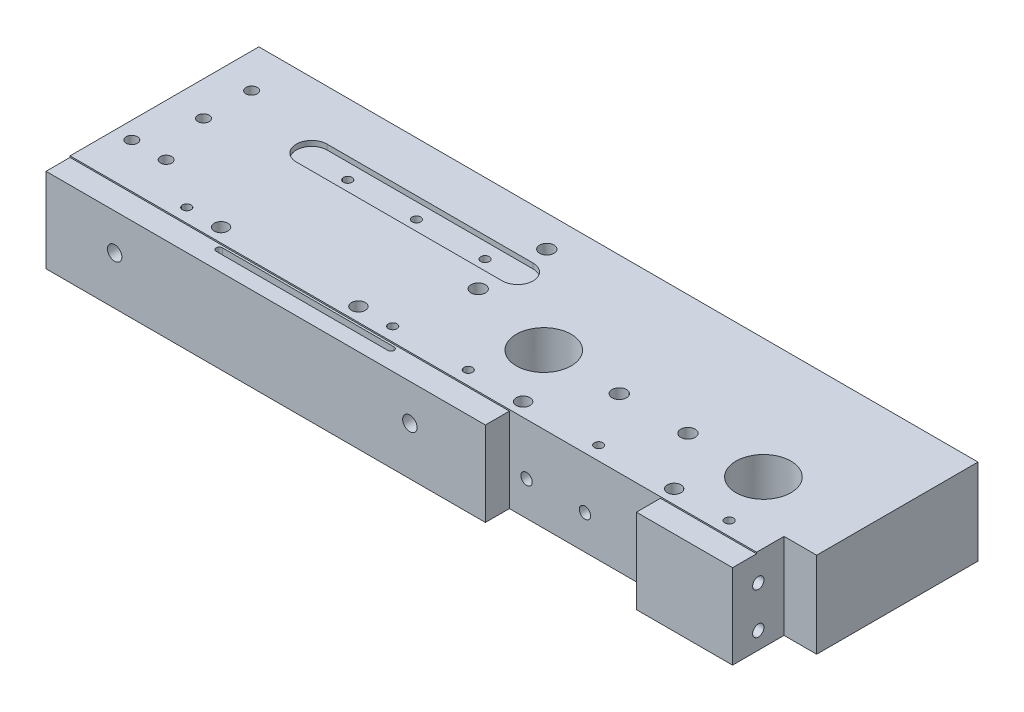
ISO-10303-21;
HEADER;
FILE_DESCRIPTION(('STEP AP214'),'2;1');
FILE_NAME('part.step','',(''),(''),'','','');
FILE_SCHEMA(('AUTOMOTIVE_DESIGN { 1 0 10303 214 1 1 1 1 }'));
ENDSEC;
DATA;
#1=APPLICATION_CONTEXT('core data for automotive mechanical design processes');
#2=APPLICATION_PROTOCOL_DEFINITION('international standard','automotive_design',2000,#1);
#3=PRODUCT_CONTEXT('',#1,'mechanical');
#4=PRODUCT('Part','Part','',(#3));
#5=PRODUCT_RELATED_PRODUCT_CATEGORY('part','',(#4));
#6=PRODUCT_DEFINITION_FORMATION('','',#4);
#7=PRODUCT_DEFINITION_CONTEXT('part definition',#1,'design');
#8=PRODUCT_DEFINITION('design','',#6,#7);
#9=PRODUCT_DEFINITION_SHAPE('','',#8);
#10=(LENGTH_UNIT() NAMED_UNIT(*) SI_UNIT(.MILLI.,.METRE.));
#11=(NAMED_UNIT(*) PLANE_ANGLE_UNIT() SI_UNIT($,.RADIAN.));
#12=(NAMED_UNIT(*) SI_UNIT($,.STERADIAN.) SOLID_ANGLE_UNIT());
#13=UNCERTAINTY_MEASURE_WITH_UNIT(LENGTH_MEASURE(1.E-05),#10,'distance_accuracy_value','');
#14=(GEOMETRIC_REPRESENTATION_CONTEXT(3) GLOBAL_UNCERTAINTY_ASSIGNED_CONTEXT((#13)) GLOBAL_UNIT_ASSIGNED_CONTEXT((#10,
#11,#12)) REPRESENTATION_CONTEXT('',''));
#15=CARTESIAN_POINT('',(0.,0.,0.));
#16=DIRECTION('',(0.,0.,1.));
#17=DIRECTION('',(1.,0.,0.));
#18=AXIS2_PLACEMENT_3D('',#15,#16,#17);
#19=CARTESIAN_POINT('',(182.,-37.,35.));
#20=DIRECTION('',(0.,1.,0.));
#21=DIRECTION('',(0.,0.,1.));
#22=AXIS2_PLACEMENT_3D('',#19,#20,#21);
#23=CYLINDRICAL_SURFACE('',#22,8.00000000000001);
#24=CARTESIAN_POINT('',(182.,25.,35.));
#25=DIRECTION('',(0.,1.,0.));
#26=DIRECTION('',(0.,0.,1.));
#27=AXIS2_PLACEMENT_3D('',#24,#25,#26);
#28=CIRCLE('',#27,8.00000000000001);
#29=CARTESIAN_POINT('',(182.,25.,43.));
#30=VERTEX_POINT('',#29);
#31=EDGE_CURVE('E217',#30,#30,#28,.T.);
#32=ORIENTED_EDGE('',*,*,#31,.T.);
#33=EDGE_LOOP('',(#32));
#34=FACE_BOUND('',#33,.T.);
#35=CARTESIAN_POINT('',(182.,13.,35.));
#36=DIRECTION('',(0.,-1.,0.));
#37=DIRECTION('',(0.,0.,-1.));
#38=AXIS2_PLACEMENT_3D('',#35,#36,#37);
#39=CIRCLE('',#38,8.00000000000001);
#40=CARTESIAN_POINT('',(182.,13.,27.));
#41=VERTEX_POINT('',#40);
#42=EDGE_CURVE('E259',#41,#41,#39,.F.);
#43=ORIENTED_EDGE('',*,*,#42,.F.);
#44=EDGE_LOOP('',(#43));
#45=FACE_BOUND('',#44,.T.);
#46=ADVANCED_FACE('F33',(#34,#45),#23,.F.);
#47=CARTESIAN_POINT('',(118.,-37.,35.));
#48=DIRECTION('',(0.,1.,0.));
#49=DIRECTION('',(0.,0.,1.));
#50=AXIS2_PLACEMENT_3D('',#47,#48,#49);
#51=CYLINDRICAL_SURFACE('',#50,7.99999999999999);
#52=CARTESIAN_POINT('',(118.,25.,35.));
#53=DIRECTION('',(0.,1.,0.));
#54=DIRECTION('',(0.,0.,1.));
#55=AXIS2_PLACEMENT_3D('',#52,#53,#54);
#56=CIRCLE('',#55,7.99999999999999);
#57=CARTESIAN_POINT('',(118.,25.,43.));
#58=VERTEX_POINT('',#57);
#59=EDGE_CURVE('E220',#58,#58,#56,.T.);
#60=ORIENTED_EDGE('',*,*,#59,.T.);
#61=EDGE_LOOP('',(#60));
#62=FACE_BOUND('',#61,.T.);
#63=CARTESIAN_POINT('',(118.,13.,35.));
#64=DIRECTION('',(0.,-1.,0.));
#65=DIRECTION('',(0.,0.,-1.));
#66=AXIS2_PLACEMENT_3D('',#63,#64,#65);
#67=CIRCLE('',#66,7.99999999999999);
#68=CARTESIAN_POINT('',(118.,13.,27.));
#69=VERTEX_POINT('',#68);
#70=EDGE_CURVE('E255',#69,#69,#67,.F.);
#71=ORIENTED_EDGE('',*,*,#70,.F.);
#72=EDGE_LOOP('',(#71));
#73=FACE_BOUND('',#72,.T.);
#74=ADVANCED_FACE('F537',(#62,#73),#51,.F.);
#75=CARTESIAN_POINT('',(0.,0.,62.));
#76=DIRECTION('',(0.,1.,0.));
#77=DIRECTION('',(0.,0.,1.));
#78=AXIS2_PLACEMENT_3D('',#75,#76,#77);
#79=PLANE('',#78);
#80=CARTESIAN_POINT('',(190.,0.,10.));
#81=DIRECTION('',(0.,-1.,0.));
#82=DIRECTION('',(0.,0.,-1.));
#83=AXIS2_PLACEMENT_3D('',#80,#81,#82);
#84=CIRCLE('',#83,3.37499999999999);
#85=CARTESIAN_POINT('',(190.,0.,6.62500000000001));
#86=VERTEX_POINT('',#85);
#87=EDGE_CURVE('E871',#86,#86,#84,.T.);
#88=ORIENTED_EDGE('',*,*,#87,.F.);
#89=EDGE_LOOP('',(#88));
#90=FACE_BOUND('',#89,.T.);
#91=CARTESIAN_POINT('',(110.,0.,10.));
#92=DIRECTION('',(0.,-1.,0.));
#93=DIRECTION('',(0.,0.,-1.));
#94=AXIS2_PLACEMENT_3D('',#91,#92,#93);
#95=CIRCLE('',#94,3.375);
#96=CARTESIAN_POINT('',(110.,0.,6.625));
#97=VERTEX_POINT('',#96);
#98=EDGE_CURVE('E876',#97,#97,#95,.T.);
#99=ORIENTED_EDGE('',*,*,#98,.F.);
#100=EDGE_LOOP('',(#99));
#101=FACE_BOUND('',#100,.T.);
#102=CARTESIAN_POINT('',(25.,0.,10.));
#103=DIRECTION('',(0.,-1.,0.));
#104=DIRECTION('',(0.,0.,-1.));
#105=AXIS2_PLACEMENT_3D('',#102,#103,#104);
#106=CIRCLE('',#105,3.5);
#107=CARTESIAN_POINT('',(25.,0.,6.5));
#108=VERTEX_POINT('',#107);
#109=EDGE_CURVE('E882',#108,#108,#106,.T.);
#110=ORIENTED_EDGE('',*,*,#109,.F.);
#111=EDGE_LOOP('',(#110));
#112=FACE_BOUND('',#111,.T.);
#113=CARTESIAN_POINT('',(25.,0.,35.));
#114=DIRECTION('',(0.,-1.,0.));
#115=DIRECTION('',(0.,0.,-1.));
#116=AXIS2_PLACEMENT_3D('',#113,#114,#115);
#117=CIRCLE('',#116,3.375);
#118=CARTESIAN_POINT('',(25.,0.,31.625));
#119=VERTEX_POINT('',#118);
#120=EDGE_CURVE('E888',#119,#119,#117,.T.);
#121=ORIENTED_EDGE('',*,*,#120,.F.);
#122=EDGE_LOOP('',(#121));
#123=FACE_BOUND('',#122,.T.);
#124=CARTESIAN_POINT('',(182.,0.,35.));
#125=DIRECTION('',(0.,-1.,0.));
#126=DIRECTION('',(0.,0.,-1.));
#127=AXIS2_PLACEMENT_3D('',#124,#125,#126);
#128=CIRCLE('',#127,12.5);
#129=CARTESIAN_POINT('',(182.,0.,22.5));
#130=VERTEX_POINT('',#129);
#131=EDGE_CURVE('E268',#130,#130,#128,.T.);
#132=ORIENTED_EDGE('',*,*,#131,.F.);
#133=EDGE_LOOP('',(#132));
#134=FACE_BOUND('',#133,.T.);
#135=CARTESIAN_POINT('',(118.,0.,35.));
#136=DIRECTION('',(0.,-1.,0.));
#137=DIRECTION('',(0.,0.,-1.));
#138=AXIS2_PLACEMENT_3D('',#135,#136,#137);
#139=CIRCLE('',#138,12.5);
#140=CARTESIAN_POINT('',(118.,0.,22.5));
#141=VERTEX_POINT('',#140);
#142=EDGE_CURVE('E261',#141,#141,#139,.T.);
#143=ORIENTED_EDGE('',*,*,#142,.F.);
#144=EDGE_LOOP('',(#143));
#145=FACE_BOUND('',#144,.T.);
#146=DIRECTION('',(-1.,0.,0.));
#147=VECTOR('',#146,1.);
#148=CARTESIAN_POINT('',(0.,0.,55.6000000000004));
#149=LINE('',#148,#147);
#150=CARTESIAN_POINT('',(95.,0.,55.6000000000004));
#151=VERTEX_POINT('',#150);
#152=CARTESIAN_POINT('',(45.,0.,55.6000000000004));
#153=VERTEX_POINT('',#152);
#154=EDGE_CURVE('E469',#151,#153,#149,.T.);
#155=ORIENTED_EDGE('',*,*,#154,.T.);
#156=CARTESIAN_POINT('',(45.,0.,56.5));
#157=DIRECTION('',(0.,1.,0.));
#158=DIRECTION('',(0.,0.,1.));
#159=AXIS2_PLACEMENT_3D('',#156,#157,#158);
#160=CIRCLE('',#159,0.899999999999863);
#161=CARTESIAN_POINT('',(45.,0.,57.4000000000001));
#162=VERTEX_POINT('',#161);
#163=EDGE_CURVE('E472',#153,#162,#160,.T.);
#164=ORIENTED_EDGE('',*,*,#163,.T.);
#165=DIRECTION('',(1.,0.,0.));
#166=VECTOR('',#165,1.);
#167=CARTESIAN_POINT('',(0.,0.,57.4000000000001));
#168=LINE('',#167,#166);
#169=CARTESIAN_POINT('',(95.,0.,57.4000000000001));
#170=VERTEX_POINT('',#169);
#171=EDGE_CURVE('E455',#162,#170,#168,.T.);
#172=ORIENTED_EDGE('',*,*,#171,.T.);
#173=CARTESIAN_POINT('',(95.,0.,56.5));
#174=DIRECTION('',(0.,1.,0.));
#175=DIRECTION('',(0.,0.,1.));
#176=AXIS2_PLACEMENT_3D('',#173,#174,#175);
#177=CIRCLE('',#176,0.899999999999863);
#178=EDGE_CURVE('E466',#170,#151,#177,.T.);
#179=ORIENTED_EDGE('',*,*,#178,.T.);
#180=EDGE_LOOP('',(#155,#164,#172,#179));
#181=FACE_BOUND('',#180,.T.);
#182=DIRECTION('',(1.,0.,0.));
#183=VECTOR('',#182,1.);
#184=CARTESIAN_POINT('',(0.,0.,47.));
#185=LINE('',#184,#183);
#186=CARTESIAN_POINT('',(200.,0.,47.));
#187=VERTEX_POINT('',#186);
#188=CARTESIAN_POINT('',(209.5,0.,47.));
#189=VERTEX_POINT('',#188);
#190=EDGE_CURVE('E215',#187,#189,#185,.T.);
#191=ORIENTED_EDGE('',*,*,#190,.F.);
#192=DIRECTION('',(0.,0.,-1.));
#193=VECTOR('',#192,1.);
#194=CARTESIAN_POINT('',(200.,0.,62.));
#195=LINE('',#194,#193);
#196=CARTESIAN_POINT('',(200.,0.,62.));
#197=VERTEX_POINT('',#196);
#198=EDGE_CURVE('E212',#197,#187,#195,.T.);
#199=ORIENTED_EDGE('',*,*,#198,.F.);
#200=DIRECTION('',(1.,0.,0.));
#201=VECTOR('',#200,1.);
#202=CARTESIAN_POINT('',(0.,0.,62.));
#203=LINE('',#202,#201);
#204=CARTESIAN_POINT('',(172.,0.,62.));
#205=VERTEX_POINT('',#204);
#206=EDGE_CURVE('E228',#205,#197,#203,.T.);
#207=ORIENTED_EDGE('',*,*,#206,.F.);
#208=DIRECTION('',(0.,0.,1.));
#209=VECTOR('',#208,1.);
#210=CARTESIAN_POINT('',(172.,0.,62.));
#211=LINE('',#210,#209);
#212=CARTESIAN_POINT('',(172.,0.,55.));
#213=VERTEX_POINT('',#212);
#214=EDGE_CURVE('E210',#213,#205,#211,.T.);
#215=ORIENTED_EDGE('',*,*,#214,.F.);
#216=DIRECTION('',(1.,0.,0.));
#217=VECTOR('',#216,1.);
#218=CARTESIAN_POINT('',(0.,0.,55.));
#219=LINE('',#218,#217);
#220=CARTESIAN_POINT('',(128.,0.,55.));
#221=VERTEX_POINT('',#220);
#222=EDGE_CURVE('E196',#221,#213,#219,.T.);
#223=ORIENTED_EDGE('',*,*,#222,.F.);
#224=DIRECTION('',(0.,0.,-1.));
#225=VECTOR('',#224,1.);
#226=CARTESIAN_POINT('',(128.,0.,62.));
#227=LINE('',#226,#225);
#228=CARTESIAN_POINT('',(128.,0.,62.));
#229=VERTEX_POINT('',#228);
#230=EDGE_CURVE('E208',#229,#221,#227,.T.);
#231=ORIENTED_EDGE('',*,*,#230,.F.);
#232=CARTESIAN_POINT('',(0.,0.,62.));
#233=VERTEX_POINT('',#232);
#234=EDGE_CURVE('E224',#233,#229,#203,.T.);
#235=ORIENTED_EDGE('',*,*,#234,.F.);
#236=DIRECTION('',(0.,0.,-1.));
#237=VECTOR('',#236,1.);
#238=CARTESIAN_POINT('',(0.,0.,62.));
#239=LINE('',#238,#237);
#240=CARTESIAN_POINT('',(0.,0.,0.));
#241=VERTEX_POINT('',#240);
#242=EDGE_CURVE('E230',#233,#241,#239,.T.);
#243=ORIENTED_EDGE('',*,*,#242,.T.);
#244=DIRECTION('',(1.,0.,0.));
#245=VECTOR('',#244,1.);
#246=CARTESIAN_POINT('',(0.,0.,0.));
#247=LINE('',#246,#245);
#248=CARTESIAN_POINT('',(209.5,0.,0.));
#249=VERTEX_POINT('',#248);
#250=EDGE_CURVE('E223',#241,#249,#247,.T.);
#251=ORIENTED_EDGE('',*,*,#250,.T.);
#252=DIRECTION('',(0.,0.,-1.));
#253=VECTOR('',#252,1.);
#254=CARTESIAN_POINT('',(209.5,0.,62.));
#255=LINE('',#254,#253);
#256=EDGE_CURVE('E247',#189,#249,#255,.T.);
#257=ORIENTED_EDGE('',*,*,#256,.F.);
#258=EDGE_LOOP('',(#191,#199,#207,#215,#223,#231,#235,#243,#251,#257));
#259=FACE_BOUND('',#258,.T.);
#260=ADVANCED_FACE('F35',(#90,#101,#112,#123,#134,#145,#181,#259),#79,.F.);
#261=CARTESIAN_POINT('',(209.5,0.,62.));
#262=DIRECTION('',(-1.,0.,0.));
#263=DIRECTION('',(0.,0.,1.));
#264=AXIS2_PLACEMENT_3D('',#261,#262,#263);
#265=PLANE('',#264);
#266=DIRECTION('',(0.,1.,0.));
#267=VECTOR('',#266,1.);
#268=CARTESIAN_POINT('',(209.5,-37.,47.));
#269=LINE('',#268,#267);
#270=CARTESIAN_POINT('',(209.5,25.,47.));
#271=VERTEX_POINT('',#270);
#272=EDGE_CURVE('E201',#189,#271,#269,.T.);
#273=ORIENTED_EDGE('',*,*,#272,.F.);
#274=ORIENTED_EDGE('',*,*,#256,.T.);
#275=DIRECTION('',(0.,1.,0.));
#276=VECTOR('',#275,1.);
#277=CARTESIAN_POINT('',(209.5,0.,0.));
#278=LINE('',#277,#276);
#279=CARTESIAN_POINT('',(209.5,25.,0.));
#280=VERTEX_POINT('',#279);
#281=EDGE_CURVE('E233',#249,#280,#278,.T.);
#282=ORIENTED_EDGE('',*,*,#281,.T.);
#283=DIRECTION('',(0.,0.,-1.));
#284=VECTOR('',#283,1.);
#285=CARTESIAN_POINT('',(209.5,25.,62.));
#286=LINE('',#285,#284);
#287=EDGE_CURVE('E245',#271,#280,#286,.T.);
#288=ORIENTED_EDGE('',*,*,#287,.F.);
#289=EDGE_LOOP('',(#273,#274,#282,#288));
#290=FACE_BOUND('',#289,.T.);
#291=ADVANCED_FACE('F492',(#290),#265,.F.);
#292=CARTESIAN_POINT('',(0.,25.,62.));
#293=DIRECTION('',(0.,-1.,0.));
#294=DIRECTION('',(0.,0.,-1.));
#295=AXIS2_PLACEMENT_3D('',#292,#293,#294);
#296=PLANE('',#295);
#297=CARTESIAN_POINT('',(93.,25.,29.1000000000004));
#298=DIRECTION('',(0.,1.,0.));
#299=DIRECTION('',(0.,0.,1.));
#300=AXIS2_PLACEMENT_3D('',#297,#298,#299);
#301=CIRCLE('',#300,2.1);
#302=CARTESIAN_POINT('',(93.,25.,31.2000000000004));
#303=VERTEX_POINT('',#302);
#304=EDGE_CURVE('E296',#303,#303,#301,.T.);
#305=ORIENTED_EDGE('',*,*,#304,.F.);
#306=EDGE_LOOP('',(#305));
#307=FACE_BOUND('',#306,.T.);
#308=CARTESIAN_POINT('',(93.,25.,9.10000000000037));
#309=DIRECTION('',(0.,1.,0.));
#310=DIRECTION('',(0.,0.,1.));
#311=AXIS2_PLACEMENT_3D('',#308,#309,#310);
#312=CIRCLE('',#311,2.1);
#313=CARTESIAN_POINT('',(93.,25.,11.2000000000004));
#314=VERTEX_POINT('',#313);
#315=EDGE_CURVE('E302',#314,#314,#312,.T.);
#316=ORIENTED_EDGE('',*,*,#315,.F.);
#317=EDGE_LOOP('',(#316));
#318=FACE_BOUND('',#317,.T.);
#319=CARTESIAN_POINT('',(10.,25.,26.1000000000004));
#320=DIRECTION('',(0.,1.,0.));
#321=DIRECTION('',(0.,0.,1.));
#322=AXIS2_PLACEMENT_3D('',#319,#320,#321);
#323=CIRCLE('',#322,1.65);
#324=CARTESIAN_POINT('',(10.,25.,27.7500000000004));
#325=VERTEX_POINT('',#324);
#326=EDGE_CURVE('E308',#325,#325,#323,.T.);
#327=ORIENTED_EDGE('',*,*,#326,.F.);
#328=EDGE_LOOP('',(#327));
#329=FACE_BOUND('',#328,.T.);
#330=CARTESIAN_POINT('',(10.,25.,12.1000000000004));
#331=DIRECTION('',(0.,1.,0.));
#332=DIRECTION('',(0.,0.,1.));
#333=AXIS2_PLACEMENT_3D('',#330,#331,#332);
#334=CIRCLE('',#333,1.65);
#335=CARTESIAN_POINT('',(10.,25.,13.7500000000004));
#336=VERTEX_POINT('',#335);
#337=EDGE_CURVE('E314',#336,#336,#334,.T.);
#338=ORIENTED_EDGE('',*,*,#337,.F.);
#339=EDGE_LOOP('',(#338));
#340=FACE_BOUND('',#339,.T.);
#341=CARTESIAN_POINT('',(5.,25.,42.));
#342=DIRECTION('',(0.,1.,0.));
#343=DIRECTION('',(0.,0.,1.));
#344=AXIS2_PLACEMENT_3D('',#341,#342,#343);
#345=CIRCLE('',#344,1.65);
#346=CARTESIAN_POINT('',(5.,25.,43.65));
#347=VERTEX_POINT('',#346);
#348=EDGE_CURVE('E320',#347,#347,#345,.T.);
#349=ORIENTED_EDGE('',*,*,#348,.F.);
#350=EDGE_LOOP('',(#349));
#351=FACE_BOUND('',#350,.T.);
#352=CARTESIAN_POINT('',(15.,25.,42.));
#353=DIRECTION('',(0.,1.,0.));
#354=DIRECTION('',(0.,0.,1.));
#355=AXIS2_PLACEMENT_3D('',#352,#353,#354);
#356=CIRCLE('',#355,1.65);
#357=CARTESIAN_POINT('',(15.,25.,43.65));
#358=VERTEX_POINT('',#357);
#359=EDGE_CURVE('E326',#358,#358,#356,.T.);
#360=ORIENTED_EDGE('',*,*,#359,.F.);
#361=EDGE_LOOP('',(#360));
#362=FACE_BOUND('',#361,.T.);
#363=CARTESIAN_POINT('',(80.,25.,51.));
#364=DIRECTION('',(0.,1.,0.));
#365=DIRECTION('',(0.,0.,1.));
#366=AXIS2_PLACEMENT_3D('',#363,#364,#365);
#367=CIRCLE('',#366,2.);
#368=CARTESIAN_POINT('',(80.,25.,53.));
#369=VERTEX_POINT('',#368);
#370=EDGE_CURVE('E332',#369,#369,#367,.T.);
#371=ORIENTED_EDGE('',*,*,#370,.F.);
#372=EDGE_LOOP('',(#371));
#373=FACE_BOUND('',#372,.T.);
#374=CARTESIAN_POINT('',(40.,25.,51.));
#375=DIRECTION('',(0.,1.,0.));
#376=DIRECTION('',(0.,0.,1.));
#377=AXIS2_PLACEMENT_3D('',#374,#375,#376);
#378=CIRCLE('',#377,2.);
#379=CARTESIAN_POINT('',(40.,25.,53.));
#380=VERTEX_POINT('',#379);
#381=EDGE_CURVE('E338',#380,#380,#378,.T.);
#382=ORIENTED_EDGE('',*,*,#381,.F.);
#383=EDGE_LOOP('',(#382));
#384=FACE_BOUND('',#383,.T.);
#385=CARTESIAN_POINT('',(90.,25.,50.9999999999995));
#386=DIRECTION('',(0.,1.,0.));
#387=DIRECTION('',(0.,0.,1.));
#388=AXIS2_PLACEMENT_3D('',#385,#386,#387);
#389=CIRCLE('',#388,1.25);
#390=CARTESIAN_POINT('',(90.,25.,52.2499999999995));
#391=VERTEX_POINT('',#390);
#392=EDGE_CURVE('E344',#391,#391,#389,.T.);
#393=ORIENTED_EDGE('',*,*,#392,.F.);
#394=EDGE_LOOP('',(#393));
#395=FACE_BOUND('',#394,.T.);
#396=CARTESIAN_POINT('',(30.,25.,51.));
#397=DIRECTION('',(0.,1.,0.));
#398=DIRECTION('',(0.,0.,1.));
#399=AXIS2_PLACEMENT_3D('',#396,#397,#398);
#400=CIRCLE('',#399,1.25);
#401=CARTESIAN_POINT('',(30.,25.,52.25));
#402=VERTEX_POINT('',#401);
#403=EDGE_CURVE('E350',#402,#402,#400,.T.);
#404=ORIENTED_EDGE('',*,*,#403,.F.);
#405=EDGE_LOOP('',(#404));
#406=FACE_BOUND('',#405,.T.);
#407=CARTESIAN_POINT('',(160.,25.,35.0000000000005));
#408=DIRECTION('',(0.,1.,0.));
#409=DIRECTION('',(0.,0.,1.));
#410=AXIS2_PLACEMENT_3D('',#407,#408,#409);
#411=CIRCLE('',#410,2.09999999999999);
#412=CARTESIAN_POINT('',(160.,25.,37.1000000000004));
#413=VERTEX_POINT('',#412);
#414=EDGE_CURVE('E356',#413,#413,#411,.T.);
#415=ORIENTED_EDGE('',*,*,#414,.F.);
#416=EDGE_LOOP('',(#415));
#417=FACE_BOUND('',#416,.T.);
#418=CARTESIAN_POINT('',(140.,25.,35.));
#419=DIRECTION('',(0.,1.,0.));
#420=DIRECTION('',(0.,0.,1.));
#421=AXIS2_PLACEMENT_3D('',#418,#419,#420);
#422=CIRCLE('',#421,2.09999999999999);
#423=CARTESIAN_POINT('',(140.,25.,37.1));
#424=VERTEX_POINT('',#423);
#425=EDGE_CURVE('E362',#424,#424,#422,.T.);
#426=ORIENTED_EDGE('',*,*,#425,.F.);
#427=EDGE_LOOP('',(#426));
#428=FACE_BOUND('',#427,.T.);
#429=CARTESIAN_POINT('',(188.,25.,51.));
#430=DIRECTION('',(0.,1.,0.));
#431=DIRECTION('',(0.,0.,1.));
#432=AXIS2_PLACEMENT_3D('',#429,#430,#431);
#433=CIRCLE('',#432,1.25);
#434=CARTESIAN_POINT('',(188.,25.,52.25));
#435=VERTEX_POINT('',#434);
#436=EDGE_CURVE('E368',#435,#435,#433,.T.);
#437=ORIENTED_EDGE('',*,*,#436,.F.);
#438=EDGE_LOOP('',(#437));
#439=FACE_BOUND('',#438,.T.);
#440=CARTESIAN_POINT('',(150.,25.,51.0000000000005));
#441=DIRECTION('',(0.,1.,0.));
#442=DIRECTION('',(0.,0.,1.));
#443=AXIS2_PLACEMENT_3D('',#440,#441,#442);
#444=CIRCLE('',#443,1.25);
#445=CARTESIAN_POINT('',(150.,25.,52.2500000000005));
#446=VERTEX_POINT('',#445);
#447=EDGE_CURVE('E374',#446,#446,#444,.T.);
#448=ORIENTED_EDGE('',*,*,#447,.F.);
#449=EDGE_LOOP('',(#448));
#450=FACE_BOUND('',#449,.T.);
#451=CARTESIAN_POINT('',(112.,25.,51.));
#452=DIRECTION('',(0.,1.,0.));
#453=DIRECTION('',(0.,0.,1.));
#454=AXIS2_PLACEMENT_3D('',#451,#452,#453);
#455=CIRCLE('',#454,1.25);
#456=CARTESIAN_POINT('',(112.,25.,52.25));
#457=VERTEX_POINT('',#456);
#458=EDGE_CURVE('E379',#457,#457,#455,.T.);
#459=ORIENTED_EDGE('',*,*,#458,.F.);
#460=EDGE_LOOP('',(#459));
#461=FACE_BOUND('',#460,.T.);
#462=CARTESIAN_POINT('',(172.,25.,51.));
#463=DIRECTION('',(0.,1.,0.));
#464=DIRECTION('',(0.,0.,1.));
#465=AXIS2_PLACEMENT_3D('',#462,#463,#464);
#466=CIRCLE('',#465,2.);
#467=CARTESIAN_POINT('',(172.,25.,53.));
#468=VERTEX_POINT('',#467);
#469=EDGE_CURVE('E383',#468,#468,#466,.T.);
#470=ORIENTED_EDGE('',*,*,#469,.F.);
#471=EDGE_LOOP('',(#470));
#472=FACE_BOUND('',#471,.T.);
#473=CARTESIAN_POINT('',(128.,25.,51.));
#474=DIRECTION('',(0.,1.,0.));
#475=DIRECTION('',(0.,0.,1.));
#476=AXIS2_PLACEMENT_3D('',#473,#474,#475);
#477=CIRCLE('',#476,2.);
#478=CARTESIAN_POINT('',(128.,25.,53.));
#479=VERTEX_POINT('',#478);
#480=EDGE_CURVE('E389',#479,#479,#477,.T.);
#481=ORIENTED_EDGE('',*,*,#480,.F.);
#482=EDGE_LOOP('',(#481));
#483=FACE_BOUND('',#482,.T.);
#484=DIRECTION('',(1.,0.,0.));
#485=VECTOR('',#484,1.);
#486=CARTESIAN_POINT('',(34.5,25.,23.6000000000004));
#487=LINE('',#486,#485);
#488=CARTESIAN_POINT('',(34.5,25.,23.6000000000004));
#489=VERTEX_POINT('',#488);
#490=CARTESIAN_POINT('',(94.5,25.,23.6000000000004));
#491=VERTEX_POINT('',#490);
#492=EDGE_CURVE('E435',#489,#491,#487,.T.);
#493=ORIENTED_EDGE('',*,*,#492,.F.);
#494=CARTESIAN_POINT('',(34.5,25.,19.1000000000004));
#495=DIRECTION('',(0.,1.,0.));
#496=DIRECTION('',(0.,0.,1.));
#497=AXIS2_PLACEMENT_3D('',#494,#495,#496);
#498=CIRCLE('',#497,4.5);
#499=CARTESIAN_POINT('',(34.5,25.,14.6000000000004));
#500=VERTEX_POINT('',#499);
#501=EDGE_CURVE('E419',#500,#489,#498,.T.);
#502=ORIENTED_EDGE('',*,*,#501,.F.);
#503=DIRECTION('',(-1.,0.,0.));
#504=VECTOR('',#503,1.);
#505=CARTESIAN_POINT('',(34.5,25.,14.6000000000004));
#506=LINE('',#505,#504);
#507=CARTESIAN_POINT('',(94.5,25.,14.6000000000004));
#508=VERTEX_POINT('',#507);
#509=EDGE_CURVE('E424',#508,#500,#506,.T.);
#510=ORIENTED_EDGE('',*,*,#509,.F.);
#511=CARTESIAN_POINT('',(94.5,25.,19.1000000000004));
#512=DIRECTION('',(0.,1.,0.));
#513=DIRECTION('',(0.,0.,1.));
#514=AXIS2_PLACEMENT_3D('',#511,#512,#513);
#515=CIRCLE('',#514,4.5);
#516=EDGE_CURVE('E438',#491,#508,#515,.T.);
#517=ORIENTED_EDGE('',*,*,#516,.F.);
#518=EDGE_LOOP('',(#493,#502,#510,#517));
#519=FACE_BOUND('',#518,.T.);
#520=ORIENTED_EDGE('',*,*,#31,.F.);
#521=EDGE_LOOP('',(#520));
#522=FACE_BOUND('',#521,.T.);
#523=ORIENTED_EDGE('',*,*,#59,.F.);
#524=EDGE_LOOP('',(#523));
#525=FACE_BOUND('',#524,.T.);
#526=DIRECTION('',(1.,0.,0.));
#527=VECTOR('',#526,1.);
#528=CARTESIAN_POINT('',(128.,25.,55.));
#529=LINE('',#528,#527);
#530=CARTESIAN_POINT('',(0.,25.,55.));
#531=VERTEX_POINT('',#530);
#532=CARTESIAN_POINT('',(200.,25.,55.));
#533=VERTEX_POINT('',#532);
#534=EDGE_CURVE('E475',#531,#533,#529,.T.);
#535=ORIENTED_EDGE('',*,*,#534,.T.);
#536=DIRECTION('',(0.,0.,-1.));
#537=VECTOR('',#536,1.);
#538=CARTESIAN_POINT('',(200.,25.,47.));
#539=LINE('',#538,#537);
#540=CARTESIAN_POINT('',(200.,25.,47.));
#541=VERTEX_POINT('',#540);
#542=EDGE_CURVE('E477',#533,#541,#539,.T.);
#543=ORIENTED_EDGE('',*,*,#542,.T.);
#544=DIRECTION('',(1.,0.,0.));
#545=VECTOR('',#544,1.);
#546=CARTESIAN_POINT('',(200.,25.,47.));
#547=LINE('',#546,#545);
#548=EDGE_CURVE('E204',#541,#271,#547,.T.);
#549=ORIENTED_EDGE('',*,*,#548,.T.);
#550=ORIENTED_EDGE('',*,*,#287,.T.);
#551=DIRECTION('',(-1.,0.,0.));
#552=VECTOR('',#551,1.);
#553=CARTESIAN_POINT('',(0.,25.,0.));
#554=LINE('',#553,#552);
#555=CARTESIAN_POINT('',(0.,25.,0.));
#556=VERTEX_POINT('',#555);
#557=EDGE_CURVE('E236',#280,#556,#554,.T.);
#558=ORIENTED_EDGE('',*,*,#557,.T.);
#559=DIRECTION('',(0.,0.,-1.));
#560=VECTOR('',#559,1.);
#561=CARTESIAN_POINT('',(0.,25.,62.));
#562=LINE('',#561,#560);
#563=EDGE_CURVE('E243',#531,#556,#562,.T.);
#564=ORIENTED_EDGE('',*,*,#563,.F.);
#565=EDGE_LOOP('',(#535,#543,#549,#550,#558,#564));
#566=FACE_BOUND('',#565,.T.);
#567=ADVANCED_FACE('F490',(#307,#318,#329,#340,#351,#362,#373,#384,#395,#406,#417,#428,#439,
#450,#461,#472,#483,#519,#522,#525,#566),#296,.F.);
#568=CARTESIAN_POINT('',(209.5,0.,62.));
#569=DIRECTION('',(0.,0.,1.));
#570=DIRECTION('',(1.,0.,0.));
#571=AXIS2_PLACEMENT_3D('',#568,#569,#570);
#572=PLANE('',#571);
#573=DIRECTION('',(1.,0.,0.));
#574=VECTOR('',#573,1.);
#575=CARTESIAN_POINT('',(172.,24.6,62.));
#576=LINE('',#575,#574);
#577=CARTESIAN_POINT('',(172.,24.6,62.));
#578=VERTEX_POINT('',#577);
#579=CARTESIAN_POINT('',(200.,24.6,62.));
#580=VERTEX_POINT('',#579);
#581=EDGE_CURVE('E54',#578,#580,#576,.T.);
#582=ORIENTED_EDGE('',*,*,#581,.F.);
#583=DIRECTION('',(0.,-1.,0.));
#584=VECTOR('',#583,1.);
#585=CARTESIAN_POINT('',(172.,0.,62.));
#586=LINE('',#585,#584);
#587=EDGE_CURVE('E192',#578,#205,#586,.T.);
#588=ORIENTED_EDGE('',*,*,#587,.T.);
#589=ORIENTED_EDGE('',*,*,#206,.T.);
#590=DIRECTION('',(0.,1.,0.));
#591=VECTOR('',#590,1.);
#592=CARTESIAN_POINT('',(200.,0.,62.));
#593=LINE('',#592,#591);
#594=EDGE_CURVE('E46',#197,#580,#593,.T.);
#595=ORIENTED_EDGE('',*,*,#594,.T.);
#596=EDGE_LOOP('',(#582,#588,#589,#595));
#597=FACE_BOUND('',#596,.T.);
#598=ADVANCED_FACE('F519',(#597),#572,.T.);
#599=CARTESIAN_POINT('',(20.,14.,62.));
#600=DIRECTION('',(0.,0.,1.));
#601=DIRECTION('',(1.,0.,0.));
#602=AXIS2_PLACEMENT_3D('',#599,#600,#601);
#603=CIRCLE('',#602,2.1);
#604=CARTESIAN_POINT('',(22.1,14.,62.));
#605=VERTEX_POINT('',#604);
#606=EDGE_CURVE('E894',#605,#605,#603,.T.);
#607=ORIENTED_EDGE('',*,*,#606,.F.);
#608=EDGE_LOOP('',(#607));
#609=FACE_BOUND('',#608,.T.);
#610=CARTESIAN_POINT('',(106.,14.,62.));
#611=DIRECTION('',(0.,0.,1.));
#612=DIRECTION('',(1.,0.,0.));
#613=AXIS2_PLACEMENT_3D('',#610,#611,#612);
#614=CIRCLE('',#613,2.1);
#615=CARTESIAN_POINT('',(108.1,14.,62.));
#616=VERTEX_POINT('',#615);
#617=EDGE_CURVE('E900',#616,#616,#614,.T.);
#618=ORIENTED_EDGE('',*,*,#617,.F.);
#619=EDGE_LOOP('',(#618));
#620=FACE_BOUND('',#619,.T.);
#621=DIRECTION('',(1.,0.,0.));
#622=VECTOR('',#621,1.);
#623=CARTESIAN_POINT('',(0.,24.6,62.));
#624=LINE('',#623,#622);
#625=CARTESIAN_POINT('',(0.,24.6,62.));
#626=VERTEX_POINT('',#625);
#627=CARTESIAN_POINT('',(128.,24.6,62.));
#628=VERTEX_POINT('',#627);
#629=EDGE_CURVE('E402',#626,#628,#624,.T.);
#630=ORIENTED_EDGE('',*,*,#629,.F.);
#631=DIRECTION('',(0.,-1.,0.));
#632=VECTOR('',#631,1.);
#633=CARTESIAN_POINT('',(0.,0.,62.));
#634=LINE('',#633,#632);
#635=EDGE_CURVE('E227',#626,#233,#634,.T.);
#636=ORIENTED_EDGE('',*,*,#635,.T.);
#637=ORIENTED_EDGE('',*,*,#234,.T.);
#638=DIRECTION('',(0.,1.,0.));
#639=VECTOR('',#638,1.);
#640=CARTESIAN_POINT('',(128.,0.,62.));
#641=LINE('',#640,#639);
#642=EDGE_CURVE('E249',#229,#628,#641,.T.);
#643=ORIENTED_EDGE('',*,*,#642,.T.);
#644=EDGE_LOOP('',(#630,#636,#637,#643));
#645=FACE_BOUND('',#644,.T.);
#646=ADVANCED_FACE('F523',(#609,#620,#645),#572,.T.);
#647=CARTESIAN_POINT('',(0.,0.,62.));
#648=DIRECTION('',(1.,0.,0.));
#649=DIRECTION('',(0.,0.,-1.));
#650=AXIS2_PLACEMENT_3D('',#647,#648,#649);
#651=PLANE('',#650);
#652=DIRECTION('',(0.,0.,1.));
#653=VECTOR('',#652,1.);
#654=CARTESIAN_POINT('',(0.,24.6,62.));
#655=LINE('',#654,#653);
#656=CARTESIAN_POINT('',(0.,24.6,55.));
#657=VERTEX_POINT('',#656);
#658=EDGE_CURVE('E400',#657,#626,#655,.T.);
#659=ORIENTED_EDGE('',*,*,#658,.F.);
#660=DIRECTION('',(0.,1.,0.));
#661=VECTOR('',#660,1.);
#662=CARTESIAN_POINT('',(0.,24.6,55.));
#663=LINE('',#662,#661);
#664=EDGE_CURVE('E407',#657,#531,#663,.T.);
#665=ORIENTED_EDGE('',*,*,#664,.T.);
#666=ORIENTED_EDGE('',*,*,#563,.T.);
#667=DIRECTION('',(0.,-1.,0.));
#668=VECTOR('',#667,1.);
#669=CARTESIAN_POINT('',(0.,0.,0.));
#670=LINE('',#669,#668);
#671=EDGE_CURVE('E239',#556,#241,#670,.T.);
#672=ORIENTED_EDGE('',*,*,#671,.T.);
#673=ORIENTED_EDGE('',*,*,#242,.F.);
#674=ORIENTED_EDGE('',*,*,#635,.F.);
#675=EDGE_LOOP('',(#659,#665,#666,#672,#673,#674));
#676=FACE_BOUND('',#675,.T.);
#677=ADVANCED_FACE('F502',(#676),#651,.F.);
#678=CARTESIAN_POINT('',(209.5,0.,0.));
#679=DIRECTION('',(0.,0.,1.));
#680=DIRECTION('',(1.,0.,0.));
#681=AXIS2_PLACEMENT_3D('',#678,#679,#680);
#682=PLANE('',#681);
#683=ORIENTED_EDGE('',*,*,#250,.F.);
#684=ORIENTED_EDGE('',*,*,#671,.F.);
#685=ORIENTED_EDGE('',*,*,#557,.F.);
#686=ORIENTED_EDGE('',*,*,#281,.F.);
#687=EDGE_LOOP('',(#683,#684,#685,#686));
#688=FACE_BOUND('',#687,.T.);
#689=ADVANCED_FACE('F498',(#688),#682,.F.);
#690=CARTESIAN_POINT('',(172.,-37.,62.));
#691=DIRECTION('',(-1.,0.,0.));
#692=DIRECTION('',(0.,0.,1.));
#693=AXIS2_PLACEMENT_3D('',#690,#691,#692);
#694=PLANE('',#693);
#695=DIRECTION('',(0.,0.,1.));
#696=VECTOR('',#695,1.);
#697=CARTESIAN_POINT('',(172.,24.6,62.));
#698=LINE('',#697,#696);
#699=CARTESIAN_POINT('',(172.,24.6,55.));
#700=VERTEX_POINT('',#699);
#701=EDGE_CURVE('E178',#700,#578,#698,.T.);
#702=ORIENTED_EDGE('',*,*,#701,.F.);
#703=DIRECTION('',(0.,1.,0.));
#704=VECTOR('',#703,1.);
#705=CARTESIAN_POINT('',(172.,-37.,55.));
#706=LINE('',#705,#704);
#707=EDGE_CURVE('E190',#213,#700,#706,.T.);
#708=ORIENTED_EDGE('',*,*,#707,.F.);
#709=ORIENTED_EDGE('',*,*,#214,.T.);
#710=ORIENTED_EDGE('',*,*,#587,.F.);
#711=EDGE_LOOP('',(#702,#708,#709,#710));
#712=FACE_BOUND('',#711,.T.);
#713=ADVANCED_FACE('F188',(#712),#694,.T.);
#714=CARTESIAN_POINT('',(128.,-37.,62.));
#715=DIRECTION('',(1.,0.,0.));
#716=DIRECTION('',(0.,0.,-1.));
#717=AXIS2_PLACEMENT_3D('',#714,#715,#716);
#718=PLANE('',#717);
#719=DIRECTION('',(0.,0.,-1.));
#720=VECTOR('',#719,1.);
#721=CARTESIAN_POINT('',(128.,24.6,62.));
#722=LINE('',#721,#720);
#723=CARTESIAN_POINT('',(128.,24.6,55.));
#724=VERTEX_POINT('',#723);
#725=EDGE_CURVE('E404',#628,#724,#722,.T.);
#726=ORIENTED_EDGE('',*,*,#725,.F.);
#727=ORIENTED_EDGE('',*,*,#642,.F.);
#728=ORIENTED_EDGE('',*,*,#230,.T.);
#729=DIRECTION('',(0.,1.,0.));
#730=VECTOR('',#729,1.);
#731=CARTESIAN_POINT('',(128.,-37.,55.));
#732=LINE('',#731,#730);
#733=EDGE_CURVE('E198',#221,#724,#732,.T.);
#734=ORIENTED_EDGE('',*,*,#733,.T.);
#735=EDGE_LOOP('',(#726,#727,#728,#734));
#736=FACE_BOUND('',#735,.T.);
#737=ADVANCED_FACE('F511',(#736),#718,.T.);
#738=CARTESIAN_POINT('',(128.,-37.,55.));
#739=DIRECTION('',(0.,0.,1.));
#740=DIRECTION('',(1.,0.,0.));
#741=AXIS2_PLACEMENT_3D('',#738,#739,#740);
#742=PLANE('',#741);
#743=CARTESIAN_POINT('',(167.,10.,55.));
#744=DIRECTION('',(0.,0.,1.));
#745=DIRECTION('',(1.,0.,0.));
#746=AXIS2_PLACEMENT_3D('',#743,#744,#745);
#747=CIRCLE('',#746,1.65000000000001);
#748=CARTESIAN_POINT('',(168.65,10.,55.));
#749=VERTEX_POINT('',#748);
#750=EDGE_CURVE('E906',#749,#749,#747,.T.);
#751=ORIENTED_EDGE('',*,*,#750,.F.);
#752=EDGE_LOOP('',(#751));
#753=FACE_BOUND('',#752,.T.);
#754=CARTESIAN_POINT('',(150.,10.,55.));
#755=DIRECTION('',(0.,0.,1.));
#756=DIRECTION('',(1.,0.,0.));
#757=AXIS2_PLACEMENT_3D('',#754,#755,#756);
#758=CIRCLE('',#757,1.65000000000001);
#759=CARTESIAN_POINT('',(151.65,10.,55.));
#760=VERTEX_POINT('',#759);
#761=EDGE_CURVE('E912',#760,#760,#758,.T.);
#762=ORIENTED_EDGE('',*,*,#761,.F.);
#763=EDGE_LOOP('',(#762));
#764=FACE_BOUND('',#763,.T.);
#765=CARTESIAN_POINT('',(133.,10.,55.));
#766=DIRECTION('',(0.,0.,1.));
#767=DIRECTION('',(1.,0.,0.));
#768=AXIS2_PLACEMENT_3D('',#765,#766,#767);
#769=CIRCLE('',#768,1.65000000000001);
#770=CARTESIAN_POINT('',(134.65,10.,55.));
#771=VERTEX_POINT('',#770);
#772=EDGE_CURVE('E276',#771,#771,#769,.T.);
#773=ORIENTED_EDGE('',*,*,#772,.F.);
#774=EDGE_LOOP('',(#773));
#775=FACE_BOUND('',#774,.T.);
#776=ORIENTED_EDGE('',*,*,#222,.T.);
#777=ORIENTED_EDGE('',*,*,#707,.T.);
#778=DIRECTION('',(-1.,0.,0.));
#779=VECTOR('',#778,1.);
#780=CARTESIAN_POINT('',(172.,24.6,55.));
#781=LINE('',#780,#779);
#782=CARTESIAN_POINT('',(200.,24.6,55.));
#783=VERTEX_POINT('',#782);
#784=EDGE_CURVE('E175',#783,#700,#781,.T.);
#785=ORIENTED_EDGE('',*,*,#784,.F.);
#786=DIRECTION('',(0.,1.,0.));
#787=VECTOR('',#786,1.);
#788=CARTESIAN_POINT('',(200.,24.6,55.));
#789=LINE('',#788,#787);
#790=EDGE_CURVE('E398',#783,#533,#789,.T.);
#791=ORIENTED_EDGE('',*,*,#790,.T.);
#792=ORIENTED_EDGE('',*,*,#534,.F.);
#793=ORIENTED_EDGE('',*,*,#664,.F.);
#794=DIRECTION('',(-1.,0.,0.));
#795=VECTOR('',#794,1.);
#796=CARTESIAN_POINT('',(0.,24.6,55.));
#797=LINE('',#796,#795);
#798=EDGE_CURVE('E62',#724,#657,#797,.T.);
#799=ORIENTED_EDGE('',*,*,#798,.F.);
#800=ORIENTED_EDGE('',*,*,#733,.F.);
#801=EDGE_LOOP('',(#776,#777,#785,#791,#792,#793,#799,#800));
#802=FACE_BOUND('',#801,.T.);
#803=ADVANCED_FACE('F194',(#753,#764,#775,#802),#742,.T.);
#804=CARTESIAN_POINT('',(200.,-37.,47.));
#805=DIRECTION('',(0.,0.,1.));
#806=DIRECTION('',(1.,0.,0.));
#807=AXIS2_PLACEMENT_3D('',#804,#805,#806);
#808=PLANE('',#807);
#809=ORIENTED_EDGE('',*,*,#190,.T.);
#810=ORIENTED_EDGE('',*,*,#272,.T.);
#811=ORIENTED_EDGE('',*,*,#548,.F.);
#812=DIRECTION('',(0.,1.,0.));
#813=VECTOR('',#812,1.);
#814=CARTESIAN_POINT('',(200.,-37.,47.));
#815=LINE('',#814,#813);
#816=EDGE_CURVE('E197',#187,#541,#815,.T.);
#817=ORIENTED_EDGE('',*,*,#816,.F.);
#818=EDGE_LOOP('',(#809,#810,#811,#817));
#819=FACE_BOUND('',#818,.T.);
#820=ADVANCED_FACE('F483',(#819),#808,.T.);
#821=CARTESIAN_POINT('',(200.,-37.,47.));
#822=DIRECTION('',(1.,0.,0.));
#823=DIRECTION('',(0.,0.,-1.));
#824=AXIS2_PLACEMENT_3D('',#821,#822,#823);
#825=PLANE('',#824);
#826=CARTESIAN_POINT('',(200.,5.,54.4999999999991));
#827=DIRECTION('',(1.,0.,0.));
#828=DIRECTION('',(0.,0.,-1.));
#829=AXIS2_PLACEMENT_3D('',#826,#827,#828);
#830=CIRCLE('',#829,1.64999999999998);
#831=CARTESIAN_POINT('',(200.,5.,52.8499999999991));
#832=VERTEX_POINT('',#831);
#833=EDGE_CURVE('E862',#832,#832,#830,.T.);
#834=ORIENTED_EDGE('',*,*,#833,.F.);
#835=EDGE_LOOP('',(#834));
#836=FACE_BOUND('',#835,.T.);
#837=CARTESIAN_POINT('',(200.,17.,54.5));
#838=DIRECTION('',(1.,0.,0.));
#839=DIRECTION('',(0.,0.,-1.));
#840=AXIS2_PLACEMENT_3D('',#837,#838,#839);
#841=CIRCLE('',#840,1.64999999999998);
#842=CARTESIAN_POINT('',(200.,17.,52.85));
#843=VERTEX_POINT('',#842);
#844=EDGE_CURVE('E861',#843,#843,#841,.T.);
#845=ORIENTED_EDGE('',*,*,#844,.F.);
#846=EDGE_LOOP('',(#845));
#847=FACE_BOUND('',#846,.T.);
#848=ORIENTED_EDGE('',*,*,#790,.F.);
#849=DIRECTION('',(0.,0.,-1.));
#850=VECTOR('',#849,1.);
#851=CARTESIAN_POINT('',(200.,24.6,55.));
#852=LINE('',#851,#850);
#853=EDGE_CURVE('E179',#580,#783,#852,.T.);
#854=ORIENTED_EDGE('',*,*,#853,.F.);
#855=ORIENTED_EDGE('',*,*,#594,.F.);
#856=ORIENTED_EDGE('',*,*,#198,.T.);
#857=ORIENTED_EDGE('',*,*,#816,.T.);
#858=ORIENTED_EDGE('',*,*,#542,.F.);
#859=EDGE_LOOP('',(#848,#854,#855,#856,#857,#858));
#860=FACE_BOUND('',#859,.T.);
#861=ADVANCED_FACE('F521',(#836,#847,#860),#825,.T.);
#862=CARTESIAN_POINT('',(45.,-37.,56.5));
#863=DIRECTION('',(0.,1.,0.));
#864=DIRECTION('',(0.,0.,1.));
#865=AXIS2_PLACEMENT_3D('',#862,#863,#864);
#866=CYLINDRICAL_SURFACE('',#865,0.899999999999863);
#867=DIRECTION('',(0.,1.,0.));
#868=VECTOR('',#867,1.);
#869=CARTESIAN_POINT('',(45.,-37.,55.6000000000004));
#870=LINE('',#869,#868);
#871=CARTESIAN_POINT('',(45.,24.6,55.6000000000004));
#872=VERTEX_POINT('',#871);
#873=EDGE_CURVE('E452',#153,#872,#870,.T.);
#874=ORIENTED_EDGE('',*,*,#873,.T.);
#875=CARTESIAN_POINT('',(45.,24.6,56.5));
#876=DIRECTION('',(0.,-1.,0.));
#877=DIRECTION('',(0.,0.,-1.));
#878=AXIS2_PLACEMENT_3D('',#875,#876,#877);
#879=CIRCLE('',#878,0.899999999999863);
#880=CARTESIAN_POINT('',(45.,24.6,57.4000000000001));
#881=VERTEX_POINT('',#880);
#882=EDGE_CURVE('E416',#872,#881,#879,.F.);
#883=ORIENTED_EDGE('',*,*,#882,.T.);
#884=DIRECTION('',(0.,1.,0.));
#885=VECTOR('',#884,1.);
#886=CARTESIAN_POINT('',(45.,-37.,57.4000000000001));
#887=LINE('',#886,#885);
#888=EDGE_CURVE('E445',#162,#881,#887,.T.);
#889=ORIENTED_EDGE('',*,*,#888,.F.);
#890=ORIENTED_EDGE('',*,*,#163,.F.);
#891=EDGE_LOOP('',(#874,#883,#889,#890));
#892=FACE_BOUND('',#891,.T.);
#893=ADVANCED_FACE('F555',(#892),#866,.F.);
#894=CARTESIAN_POINT('',(45.,-37.,55.6000000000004));
#895=DIRECTION('',(0.,0.,-1.));
#896=DIRECTION('',(-1.,0.,0.));
#897=AXIS2_PLACEMENT_3D('',#894,#895,#896);
#898=PLANE('',#897);
#899=DIRECTION('',(0.,1.,0.));
#900=VECTOR('',#899,1.);
#901=CARTESIAN_POINT('',(95.,-37.,55.6000000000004));
#902=LINE('',#901,#900);
#903=CARTESIAN_POINT('',(95.,24.6,55.6000000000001));
#904=VERTEX_POINT('',#903);
#905=EDGE_CURVE('E456',#151,#904,#902,.T.);
#906=ORIENTED_EDGE('',*,*,#905,.T.);
#907=DIRECTION('',(-1.,0.,0.));
#908=VECTOR('',#907,1.);
#909=CARTESIAN_POINT('',(45.,24.6,55.6000000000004));
#910=LINE('',#909,#908);
#911=EDGE_CURVE('E413',#904,#872,#910,.T.);
#912=ORIENTED_EDGE('',*,*,#911,.T.);
#913=ORIENTED_EDGE('',*,*,#873,.F.);
#914=ORIENTED_EDGE('',*,*,#154,.F.);
#915=EDGE_LOOP('',(#906,#912,#913,#914));
#916=FACE_BOUND('',#915,.T.);
#917=ADVANCED_FACE('F561',(#916),#898,.F.);
#918=CARTESIAN_POINT('',(95.,-37.,56.5));
#919=DIRECTION('',(0.,1.,0.));
#920=DIRECTION('',(0.,0.,1.));
#921=AXIS2_PLACEMENT_3D('',#918,#919,#920);
#922=CYLINDRICAL_SURFACE('',#921,0.899999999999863);
#923=DIRECTION('',(0.,1.,0.));
#924=VECTOR('',#923,1.);
#925=CARTESIAN_POINT('',(95.,-37.,57.3999999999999));
#926=LINE('',#925,#924);
#927=CARTESIAN_POINT('',(95.,24.6,57.3999999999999));
#928=VERTEX_POINT('',#927);
#929=EDGE_CURVE('E459',#170,#928,#926,.T.);
#930=ORIENTED_EDGE('',*,*,#929,.T.);
#931=CARTESIAN_POINT('',(95.,24.6,56.5));
#932=DIRECTION('',(0.,-1.,0.));
#933=DIRECTION('',(0.,0.,-1.));
#934=AXIS2_PLACEMENT_3D('',#931,#932,#933);
#935=CIRCLE('',#934,0.899999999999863);
#936=EDGE_CURVE('E410',#928,#904,#935,.F.);
#937=ORIENTED_EDGE('',*,*,#936,.T.);
#938=ORIENTED_EDGE('',*,*,#905,.F.);
#939=ORIENTED_EDGE('',*,*,#178,.F.);
#940=EDGE_LOOP('',(#930,#937,#938,#939));
#941=FACE_BOUND('',#940,.T.);
#942=ADVANCED_FACE('F567',(#941),#922,.F.);
#943=CARTESIAN_POINT('',(45.,-37.,57.4000000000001));
#944=DIRECTION('',(0.,0.,1.));
#945=DIRECTION('',(1.,0.,0.));
#946=AXIS2_PLACEMENT_3D('',#943,#944,#945);
#947=PLANE('',#946);
#948=ORIENTED_EDGE('',*,*,#888,.T.);
#949=DIRECTION('',(1.,0.,0.));
#950=VECTOR('',#949,1.);
#951=CARTESIAN_POINT('',(45.,24.6,57.4000000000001));
#952=LINE('',#951,#950);
#953=EDGE_CURVE('E12',#881,#928,#952,.T.);
#954=ORIENTED_EDGE('',*,*,#953,.T.);
#955=ORIENTED_EDGE('',*,*,#929,.F.);
#956=ORIENTED_EDGE('',*,*,#171,.F.);
#957=EDGE_LOOP('',(#948,#954,#955,#956));
#958=FACE_BOUND('',#957,.T.);
#959=ADVANCED_FACE('F563',(#958),#947,.F.);
#960=CARTESIAN_POINT('',(34.5,23.5,19.1000000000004));
#961=DIRECTION('',(0.,1.,0.));
#962=DIRECTION('',(0.,0.,1.));
#963=AXIS2_PLACEMENT_3D('',#960,#961,#962);
#964=CYLINDRICAL_SURFACE('',#963,4.5);
#965=ORIENTED_EDGE('',*,*,#501,.T.);
#966=DIRECTION('',(0.,1.,0.));
#967=VECTOR('',#966,1.);
#968=CARTESIAN_POINT('',(34.5,23.5,23.6000000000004));
#969=LINE('',#968,#967);
#970=CARTESIAN_POINT('',(34.5,23.5,23.6000000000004));
#971=VERTEX_POINT('',#970);
#972=EDGE_CURVE('E433',#971,#489,#969,.T.);
#973=ORIENTED_EDGE('',*,*,#972,.F.);
#974=CARTESIAN_POINT('',(34.5,23.5,19.1000000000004));
#975=DIRECTION('',(0.,1.,0.));
#976=DIRECTION('',(0.,0.,1.));
#977=AXIS2_PLACEMENT_3D('',#974,#975,#976);
#978=CIRCLE('',#977,4.5);
#979=CARTESIAN_POINT('',(34.5,23.5,14.6000000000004));
#980=VERTEX_POINT('',#979);
#981=EDGE_CURVE('E420',#980,#971,#978,.T.);
#982=ORIENTED_EDGE('',*,*,#981,.F.);
#983=DIRECTION('',(0.,1.,0.));
#984=VECTOR('',#983,1.);
#985=CARTESIAN_POINT('',(34.5,23.5,14.6000000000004));
#986=LINE('',#985,#984);
#987=EDGE_CURVE('E443',#980,#500,#986,.T.);
#988=ORIENTED_EDGE('',*,*,#987,.T.);
#989=EDGE_LOOP('',(#965,#973,#982,#988));
#990=FACE_BOUND('',#989,.T.);
#991=ADVANCED_FACE('F566',(#990),#964,.F.);
#992=CARTESIAN_POINT('',(34.5,23.5,14.6000000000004));
#993=DIRECTION('',(0.,0.,-1.));
#994=DIRECTION('',(-1.,0.,0.));
#995=AXIS2_PLACEMENT_3D('',#992,#993,#994);
#996=PLANE('',#995);
#997=ORIENTED_EDGE('',*,*,#509,.T.);
#998=ORIENTED_EDGE('',*,*,#987,.F.);
#999=DIRECTION('',(-1.,0.,0.));
#1000=VECTOR('',#999,1.);
#1001=CARTESIAN_POINT('',(34.5,23.5,14.6000000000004));
#1002=LINE('',#1001,#1000);
#1003=CARTESIAN_POINT('',(94.5,23.5,14.6000000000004));
#1004=VERTEX_POINT('',#1003);
#1005=EDGE_CURVE('E430',#1004,#980,#1002,.T.);
#1006=ORIENTED_EDGE('',*,*,#1005,.F.);
#1007=DIRECTION('',(0.,1.,0.));
#1008=VECTOR('',#1007,1.);
#1009=CARTESIAN_POINT('',(94.5,23.5,14.6000000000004));
#1010=LINE('',#1009,#1008);
#1011=EDGE_CURVE('E446',#1004,#508,#1010,.T.);
#1012=ORIENTED_EDGE('',*,*,#1011,.T.);
#1013=EDGE_LOOP('',(#997,#998,#1006,#1012));
#1014=FACE_BOUND('',#1013,.T.);
#1015=ADVANCED_FACE('F577',(#1014),#996,.F.);
#1016=CARTESIAN_POINT('',(94.5,23.5,19.1000000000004));
#1017=DIRECTION('',(0.,1.,0.));
#1018=DIRECTION('',(0.,0.,1.));
#1019=AXIS2_PLACEMENT_3D('',#1016,#1017,#1018);
#1020=CYLINDRICAL_SURFACE('',#1019,4.5);
#1021=ORIENTED_EDGE('',*,*,#516,.T.);
#1022=ORIENTED_EDGE('',*,*,#1011,.F.);
#1023=CARTESIAN_POINT('',(94.5,23.5,19.1000000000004));
#1024=DIRECTION('',(0.,1.,0.));
#1025=DIRECTION('',(0.,0.,1.));
#1026=AXIS2_PLACEMENT_3D('',#1023,#1024,#1025);
#1027=CIRCLE('',#1026,4.5);
#1028=CARTESIAN_POINT('',(94.5,23.5,23.6000000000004));
#1029=VERTEX_POINT('',#1028);
#1030=EDGE_CURVE('E427',#1029,#1004,#1027,.T.);
#1031=ORIENTED_EDGE('',*,*,#1030,.F.);
#1032=DIRECTION('',(0.,1.,0.));
#1033=VECTOR('',#1032,1.);
#1034=CARTESIAN_POINT('',(94.5,23.5,23.6000000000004));
#1035=LINE('',#1034,#1033);
#1036=EDGE_CURVE('E448',#1029,#491,#1035,.T.);
#1037=ORIENTED_EDGE('',*,*,#1036,.T.);
#1038=EDGE_LOOP('',(#1021,#1022,#1031,#1037));
#1039=FACE_BOUND('',#1038,.T.);
#1040=ADVANCED_FACE('F583',(#1039),#1020,.F.);
#1041=CARTESIAN_POINT('',(34.5,23.5,23.6000000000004));
#1042=DIRECTION('',(0.,0.,1.));
#1043=DIRECTION('',(1.,0.,0.));
#1044=AXIS2_PLACEMENT_3D('',#1041,#1042,#1043);
#1045=PLANE('',#1044);
#1046=ORIENTED_EDGE('',*,*,#492,.T.);
#1047=ORIENTED_EDGE('',*,*,#1036,.F.);
#1048=DIRECTION('',(1.,0.,0.));
#1049=VECTOR('',#1048,1.);
#1050=CARTESIAN_POINT('',(34.5,23.5,23.6000000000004));
#1051=LINE('',#1050,#1049);
#1052=EDGE_CURVE('E423',#971,#1029,#1051,.T.);
#1053=ORIENTED_EDGE('',*,*,#1052,.F.);
#1054=ORIENTED_EDGE('',*,*,#972,.T.);
#1055=EDGE_LOOP('',(#1046,#1047,#1053,#1054));
#1056=FACE_BOUND('',#1055,.T.);
#1057=ADVANCED_FACE('F579',(#1056),#1045,.F.);
#1058=CARTESIAN_POINT('',(34.5,23.5,19.1000000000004));
#1059=DIRECTION('',(0.,1.,0.));
#1060=DIRECTION('',(0.,0.,1.));
#1061=AXIS2_PLACEMENT_3D('',#1058,#1059,#1060);
#1062=PLANE('',#1061);
#1063=CARTESIAN_POINT('',(45.,23.5,19.1000000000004));
#1064=DIRECTION('',(0.,1.,0.));
#1065=DIRECTION('',(0.,0.,1.));
#1066=AXIS2_PLACEMENT_3D('',#1063,#1064,#1065);
#1067=CIRCLE('',#1066,1.25);
#1068=CARTESIAN_POINT('',(45.,23.5,20.3500000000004));
#1069=VERTEX_POINT('',#1068);
#1070=EDGE_CURVE('E257',#1069,#1069,#1067,.T.);
#1071=ORIENTED_EDGE('',*,*,#1070,.F.);
#1072=EDGE_LOOP('',(#1071));
#1073=FACE_BOUND('',#1072,.T.);
#1074=CARTESIAN_POINT('',(65.,23.5,19.1000000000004));
#1075=DIRECTION('',(0.,1.,0.));
#1076=DIRECTION('',(0.,0.,1.));
#1077=AXIS2_PLACEMENT_3D('',#1074,#1075,#1076);
#1078=CIRCLE('',#1077,1.25);
#1079=CARTESIAN_POINT('',(65.,23.5,20.3500000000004));
#1080=VERTEX_POINT('',#1079);
#1081=EDGE_CURVE('E284',#1080,#1080,#1078,.T.);
#1082=ORIENTED_EDGE('',*,*,#1081,.F.);
#1083=EDGE_LOOP('',(#1082));
#1084=FACE_BOUND('',#1083,.T.);
#1085=CARTESIAN_POINT('',(85.,23.5,19.1000000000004));
#1086=DIRECTION('',(0.,1.,0.));
#1087=DIRECTION('',(0.,0.,1.));
#1088=AXIS2_PLACEMENT_3D('',#1085,#1086,#1087);
#1089=CIRCLE('',#1088,1.25);
#1090=CARTESIAN_POINT('',(85.,23.5,20.3500000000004));
#1091=VERTEX_POINT('',#1090);
#1092=EDGE_CURVE('E290',#1091,#1091,#1089,.T.);
#1093=ORIENTED_EDGE('',*,*,#1092,.F.);
#1094=EDGE_LOOP('',(#1093));
#1095=FACE_BOUND('',#1094,.T.);
#1096=ORIENTED_EDGE('',*,*,#981,.T.);
#1097=ORIENTED_EDGE('',*,*,#1052,.T.);
#1098=ORIENTED_EDGE('',*,*,#1030,.T.);
#1099=ORIENTED_EDGE('',*,*,#1005,.T.);
#1100=EDGE_LOOP('',(#1096,#1097,#1098,#1099));
#1101=FACE_BOUND('',#1100,.T.);
#1102=ADVANCED_FACE('F582',(#1073,#1084,#1095,#1101),#1062,.T.);
#1103=CARTESIAN_POINT('',(0.,24.6,55.));
#1104=DIRECTION('',(0.,-1.,0.));
#1105=DIRECTION('',(0.,0.,-1.));
#1106=AXIS2_PLACEMENT_3D('',#1103,#1104,#1105);
#1107=PLANE('',#1106);
#1108=ORIENTED_EDGE('',*,*,#658,.T.);
#1109=ORIENTED_EDGE('',*,*,#629,.T.);
#1110=ORIENTED_EDGE('',*,*,#725,.T.);
#1111=ORIENTED_EDGE('',*,*,#798,.T.);
#1112=EDGE_LOOP('',(#1108,#1109,#1110,#1111));
#1113=FACE_BOUND('',#1112,.T.);
#1114=ORIENTED_EDGE('',*,*,#911,.F.);
#1115=ORIENTED_EDGE('',*,*,#936,.F.);
#1116=ORIENTED_EDGE('',*,*,#953,.F.);
#1117=ORIENTED_EDGE('',*,*,#882,.F.);
#1118=EDGE_LOOP('',(#1114,#1115,#1116,#1117));
#1119=FACE_BOUND('',#1118,.T.);
#1120=ADVANCED_FACE('F506',(#1113,#1119),#1107,.F.);
#1121=CARTESIAN_POINT('',(200.,24.6,55.));
#1122=DIRECTION('',(0.,-1.,0.));
#1123=DIRECTION('',(0.,0.,-1.));
#1124=AXIS2_PLACEMENT_3D('',#1121,#1122,#1123);
#1125=PLANE('',#1124);
#1126=ORIENTED_EDGE('',*,*,#784,.T.);
#1127=ORIENTED_EDGE('',*,*,#701,.T.);
#1128=ORIENTED_EDGE('',*,*,#581,.T.);
#1129=ORIENTED_EDGE('',*,*,#853,.T.);
#1130=EDGE_LOOP('',(#1126,#1127,#1128,#1129));
#1131=FACE_BOUND('',#1130,.T.);
#1132=ADVANCED_FACE('F177',(#1131),#1125,.F.);
#1133=CARTESIAN_POINT('',(128.,10.,51.));
#1134=DIRECTION('',(0.,1.,0.));
#1135=DIRECTION('',(0.,0.,1.));
#1136=AXIS2_PLACEMENT_3D('',#1133,#1134,#1135);
#1137=CYLINDRICAL_SURFACE('',#1136,2.);
#1138=CARTESIAN_POINT('',(128.,10.,51.));
#1139=DIRECTION('',(0.,1.,0.));
#1140=DIRECTION('',(0.,0.,1.));
#1141=AXIS2_PLACEMENT_3D('',#1138,#1139,#1140);
#1142=CIRCLE('',#1141,2.);
#1143=CARTESIAN_POINT('',(128.,10.,53.));
#1144=VERTEX_POINT('',#1143);
#1145=EDGE_CURVE('E183',#1144,#1144,#1142,.T.);
#1146=ORIENTED_EDGE('',*,*,#1145,.F.);
#1147=EDGE_LOOP('',(#1146));
#1148=FACE_BOUND('',#1147,.T.);
#1149=ORIENTED_EDGE('',*,*,#480,.T.);
#1150=EDGE_LOOP('',(#1149));
#1151=FACE_BOUND('',#1150,.T.);
#1152=ADVANCED_FACE('F598',(#1148,#1151),#1137,.F.);
#1153=CARTESIAN_POINT('',(128.,10.,51.));
#1154=DIRECTION('',(0.,1.,0.));
#1155=DIRECTION('',(0.,0.,1.));
#1156=AXIS2_PLACEMENT_3D('',#1153,#1154,#1155);
#1157=PLANE('',#1156);
#1158=ORIENTED_EDGE('',*,*,#1145,.T.);
#1159=EDGE_LOOP('',(#1158));
#1160=FACE_BOUND('',#1159,.T.);
#1161=ADVANCED_FACE('F601',(#1160),#1157,.T.);
#1162=CARTESIAN_POINT('',(172.,10.,51.));
#1163=DIRECTION('',(0.,1.,0.));
#1164=DIRECTION('',(0.,0.,1.));
#1165=AXIS2_PLACEMENT_3D('',#1162,#1163,#1164);
#1166=CYLINDRICAL_SURFACE('',#1165,2.);
#1167=CARTESIAN_POINT('',(172.,10.,51.));
#1168=DIRECTION('',(0.,1.,0.));
#1169=DIRECTION('',(0.,0.,1.));
#1170=AXIS2_PLACEMENT_3D('',#1167,#1168,#1169);
#1171=CIRCLE('',#1170,2.);
#1172=CARTESIAN_POINT('',(172.,10.,53.));
#1173=VERTEX_POINT('',#1172);
#1174=EDGE_CURVE('E386',#1173,#1173,#1171,.T.);
#1175=ORIENTED_EDGE('',*,*,#1174,.F.);
#1176=EDGE_LOOP('',(#1175));
#1177=FACE_BOUND('',#1176,.T.);
#1178=ORIENTED_EDGE('',*,*,#469,.T.);
#1179=EDGE_LOOP('',(#1178));
#1180=FACE_BOUND('',#1179,.T.);
#1181=ADVANCED_FACE('F605',(#1177,#1180),#1166,.F.);
#1182=CARTESIAN_POINT('',(172.,10.,51.));
#1183=DIRECTION('',(0.,1.,0.));
#1184=DIRECTION('',(0.,0.,1.));
#1185=AXIS2_PLACEMENT_3D('',#1182,#1183,#1184);
#1186=PLANE('',#1185);
#1187=ORIENTED_EDGE('',*,*,#1174,.T.);
#1188=EDGE_LOOP('',(#1187));
#1189=FACE_BOUND('',#1188,.T.);
#1190=ADVANCED_FACE('F609',(#1189),#1186,.T.);
#1191=CARTESIAN_POINT('',(112.,10.,51.));
#1192=DIRECTION('',(0.,1.,0.));
#1193=DIRECTION('',(0.,0.,1.));
#1194=AXIS2_PLACEMENT_3D('',#1191,#1192,#1193);
#1195=CYLINDRICAL_SURFACE('',#1194,1.25);
#1196=CARTESIAN_POINT('',(112.,10.,51.));
#1197=DIRECTION('',(0.,1.,0.));
#1198=DIRECTION('',(0.,0.,1.));
#1199=AXIS2_PLACEMENT_3D('',#1196,#1197,#1198);
#1200=CIRCLE('',#1199,1.25);
#1201=CARTESIAN_POINT('',(112.,10.,52.25));
#1202=VERTEX_POINT('',#1201);
#1203=EDGE_CURVE('E380',#1202,#1202,#1200,.T.);
#1204=ORIENTED_EDGE('',*,*,#1203,.F.);
#1205=EDGE_LOOP('',(#1204));
#1206=FACE_BOUND('',#1205,.T.);
#1207=ORIENTED_EDGE('',*,*,#458,.T.);
#1208=EDGE_LOOP('',(#1207));
#1209=FACE_BOUND('',#1208,.T.);
#1210=ADVANCED_FACE('F613',(#1206,#1209),#1195,.F.);
#1211=CARTESIAN_POINT('',(112.,10.,51.));
#1212=DIRECTION('',(0.,1.,0.));
#1213=DIRECTION('',(0.,0.,1.));
#1214=AXIS2_PLACEMENT_3D('',#1211,#1212,#1213);
#1215=PLANE('',#1214);
#1216=ORIENTED_EDGE('',*,*,#1203,.T.);
#1217=EDGE_LOOP('',(#1216));
#1218=FACE_BOUND('',#1217,.T.);
#1219=ADVANCED_FACE('F617',(#1218),#1215,.T.);
#1220=CARTESIAN_POINT('',(150.,10.,51.0000000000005));
#1221=DIRECTION('',(0.,1.,0.));
#1222=DIRECTION('',(0.,0.,1.));
#1223=AXIS2_PLACEMENT_3D('',#1220,#1221,#1222);
#1224=CYLINDRICAL_SURFACE('',#1223,1.25);
#1225=CARTESIAN_POINT('',(150.,11.65,52.2500000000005));
#1226=CARTESIAN_POINT('',(149.939117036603,11.6499954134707,52.2499952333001));
#1227=CARTESIAN_POINT('',(149.878150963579,11.6465954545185,52.245516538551));
#1228=CARTESIAN_POINT('',(149.758154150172,11.6333018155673,52.2278872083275));
#1229=CARTESIAN_POINT('',(149.69912783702,11.6233942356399,52.2147180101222));
#1230=CARTESIAN_POINT('',(149.58505579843,11.5980351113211,52.1806122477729));
#1231=CARTESIAN_POINT('',(149.529988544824,11.5826167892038,52.1597222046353));
#1232=CARTESIAN_POINT('',(149.424513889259,11.5473887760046,52.111166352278));
#1233=CARTESIAN_POINT('',(149.374105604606,11.5275799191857,52.0835018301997));
#1234=CARTESIAN_POINT('',(149.274028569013,11.4828158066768,52.0194691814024));
#1235=CARTESIAN_POINT('',(149.224865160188,11.4575531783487,51.9825306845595));
#1236=CARTESIAN_POINT('',(149.133024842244,11.4048714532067,51.9025355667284));
#1237=CARTESIAN_POINT('',(149.090357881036,11.377449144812,51.8594697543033));
#1238=CARTESIAN_POINT('',(149.003605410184,11.3164551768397,51.7583016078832));
#1239=CARTESIAN_POINT('',(148.961058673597,11.2827869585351,51.698932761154));
#1240=CARTESIAN_POINT('',(148.886368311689,11.2184986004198,51.5724560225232));
#1241=CARTESIAN_POINT('',(148.854211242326,11.1878745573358,51.5053582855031));
#1242=CARTESIAN_POINT('',(148.810831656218,11.1441062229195,51.3883274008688));
#1243=CARTESIAN_POINT('',(148.796218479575,11.1285882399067,51.3405511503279));
#1244=CARTESIAN_POINT('',(148.772666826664,11.1029317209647,51.2422707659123));
#1245=CARTESIAN_POINT('',(148.763715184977,11.0927807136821,51.1917732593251));
#1246=CARTESIAN_POINT('',(148.752056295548,11.0794551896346,51.0885992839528));
#1247=CARTESIAN_POINT('',(148.749409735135,11.0763484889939,51.035906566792));
#1248=CARTESIAN_POINT('',(148.750812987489,11.077975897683,50.9307233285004));
#1249=CARTESIAN_POINT('',(148.754864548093,11.0827120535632,50.8782328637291));
#1250=CARTESIAN_POINT('',(148.768438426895,11.098107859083,50.781172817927));
#1251=CARTESIAN_POINT('',(148.777285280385,11.1080316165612,50.7363818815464));
#1252=CARTESIAN_POINT('',(148.799428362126,11.1319869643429,50.6490587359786));
#1253=CARTESIAN_POINT('',(148.812729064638,11.1460226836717,50.6065288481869));
#1254=CARTESIAN_POINT('',(148.853096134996,11.186746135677,50.4976910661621));
#1255=CARTESIAN_POINT('',(148.883531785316,11.2157939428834,50.433517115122));
#1256=CARTESIAN_POINT('',(148.953923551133,11.2768754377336,50.3121302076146));
#1257=CARTESIAN_POINT('',(148.993903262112,11.3089164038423,50.2549350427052));
#1258=CARTESIAN_POINT('',(149.084109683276,11.3736138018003,50.1463250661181));
#1259=CARTESIAN_POINT('',(149.134591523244,11.4062624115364,50.0951164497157));
#1260=CARTESIAN_POINT('',(149.24469127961,11.4683290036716,50.0013931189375));
#1261=CARTESIAN_POINT('',(149.304291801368,11.4977529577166,49.9588622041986));
#1262=CARTESIAN_POINT('',(149.419588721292,11.5455508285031,49.8913177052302));
#1263=CARTESIAN_POINT('',(149.47379759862,11.5649610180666,49.8645063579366));
#1264=CARTESIAN_POINT('',(149.586944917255,11.5985489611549,49.8186433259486));
#1265=CARTESIAN_POINT('',(149.645880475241,11.612729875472,49.7995869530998));
#1266=CARTESIAN_POINT('',(149.767494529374,11.6347108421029,49.7702132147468));
#1267=CARTESIAN_POINT('',(149.830194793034,11.6424689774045,49.7599532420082));
#1268=CARTESIAN_POINT('',(149.956896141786,11.6506556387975,49.7491293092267));
#1269=CARTESIAN_POINT('',(150.020896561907,11.6510878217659,49.7485605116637));
#1270=CARTESIAN_POINT('',(150.1410519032,11.6449425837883,49.7566815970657));
#1271=CARTESIAN_POINT('',(150.197316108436,11.6391072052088,49.7643913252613));
#1272=CARTESIAN_POINT('',(150.307494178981,11.6220531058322,49.7871057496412));
#1273=CARTESIAN_POINT('',(150.361407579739,11.6108333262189,49.802111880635));
#1274=CARTESIAN_POINT('',(150.467201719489,11.5834442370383,49.8392000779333));
#1275=CARTESIAN_POINT('',(150.518981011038,11.5671432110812,49.8614712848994));
#1276=CARTESIAN_POINT('',(150.618035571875,11.5307905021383,49.9120531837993));
#1277=CARTESIAN_POINT('',(150.665310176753,11.510738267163,49.9403647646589));
#1278=CARTESIAN_POINT('',(150.762350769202,11.4644677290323,50.0073522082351));
#1279=CARTESIAN_POINT('',(150.81124131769,11.4377779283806,50.0469673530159));
#1280=CARTESIAN_POINT('',(150.902129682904,11.3825695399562,50.1324943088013));
#1281=CARTESIAN_POINT('',(150.944112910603,11.354047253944,50.1784190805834));
#1282=CARTESIAN_POINT('',(151.028466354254,11.2915181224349,50.2856494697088));
#1283=CARTESIAN_POINT('',(151.069281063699,11.2575386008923,50.3482024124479));
#1284=CARTESIAN_POINT('',(151.139787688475,11.193994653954,50.4813210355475));
#1285=CARTESIAN_POINT('',(151.169507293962,11.164419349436,50.5518661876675));
#1286=CARTESIAN_POINT('',(151.207100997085,11.1250980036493,50.671834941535));
#1287=CARTESIAN_POINT('',(151.218980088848,11.1121024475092,50.7189230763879));
#1288=CARTESIAN_POINT('',(151.23724497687,11.0917483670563,50.8152889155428));
#1289=CARTESIAN_POINT('',(151.243643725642,11.084376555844,50.8645611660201));
#1290=CARTESIAN_POINT('',(151.250500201,11.0764672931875,50.9644238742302));
#1291=CARTESIAN_POINT('',(151.250918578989,11.0759751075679,51.0150208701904));
#1292=CARTESIAN_POINT('',(151.245672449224,11.0820409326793,51.1154906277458));
#1293=CARTESIAN_POINT('',(151.240001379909,11.08860654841,51.1653625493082));
#1294=CARTESIAN_POINT('',(151.221544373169,11.109300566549,51.2715240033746));
#1295=CARTESIAN_POINT('',(151.20768131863,11.1245572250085,51.327396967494));
#1296=CARTESIAN_POINT('',(151.173174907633,11.1605081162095,51.4351800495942));
#1297=CARTESIAN_POINT('',(151.152514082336,11.1812163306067,51.4870795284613));
#1298=CARTESIAN_POINT('',(151.096153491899,11.2340768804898,51.6055948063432));
#1299=CARTESIAN_POINT('',(151.05772255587,11.2675864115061,51.6703010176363));
#1300=CARTESIAN_POINT('',(150.970332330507,11.3356795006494,51.791544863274));
#1301=CARTESIAN_POINT('',(150.921361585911,11.3702641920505,51.8480734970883));
#1302=CARTESIAN_POINT('',(150.812570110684,11.4374896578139,51.9528933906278));
#1303=CARTESIAN_POINT('',(150.752617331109,11.4700995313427,52.0010687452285));
#1304=CARTESIAN_POINT('',(150.622902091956,11.5295581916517,52.0865007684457));
#1305=CARTESIAN_POINT('',(150.553163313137,11.5564205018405,52.1237831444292));
#1306=CARTESIAN_POINT('',(150.426797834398,11.59479520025,52.1762604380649));
#1307=CARTESIAN_POINT('',(150.372183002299,11.6085002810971,52.1947242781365));
#1308=CARTESIAN_POINT('',(150.259949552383,11.6303897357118,52.2240374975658));
#1309=CARTESIAN_POINT('',(150.202338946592,11.6385880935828,52.2349061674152));
#1310=CARTESIAN_POINT('',(150.120202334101,11.6457913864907,52.2444402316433));
#1311=CARTESIAN_POINT('',(150.096242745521,11.6473661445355,52.2465215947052));
#1312=CARTESIAN_POINT('',(150.048193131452,11.6494714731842,52.2493025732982));
#1313=CARTESIAN_POINT('',(150.024103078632,11.6500018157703,52.250001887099));
#1314=CARTESIAN_POINT('',(150.,11.65,52.2500000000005));
#1315=B_SPLINE_CURVE_WITH_KNOTS('',3,(#1225,#1226,#1227,#1228,#1229,#1230,#1231,#1232,#1233,
#1234,#1235,#1236,#1237,#1238,#1239,#1240,#1241,#1242,#1243,#1244,#1245,#1246,#1247,#1248,#1249,
#1250,#1251,#1252,#1253,#1254,#1255,#1256,#1257,#1258,#1259,#1260,#1261,#1262,#1263,#1264,#1265,
#1266,#1267,#1268,#1269,#1270,#1271,#1272,#1273,#1274,#1275,#1276,#1277,#1278,#1279,#1280,#1281,
#1282,#1283,#1284,#1285,#1286,#1287,#1288,#1289,#1290,#1291,#1292,#1293,#1294,#1295,#1296,#1297,
#1298,#1299,#1300,#1301,#1302,#1303,#1304,#1305,#1306,#1307,#1308,#1309,#1310,#1311,#1312,#1313,
#1314),.UNSPECIFIED.,.T.,.F.,(4,2,2,2,2,2,2,2,2,2,2,2,2,2,2,2,2,2,2,2,2,2,2,2,2,2,2,2,2,2,2,2,2,
2,2,2,2,2,2,2,2,2,2,2,4),(0.,0.182544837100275,0.365480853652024,0.547332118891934,
0.729148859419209,0.927885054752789,1.12692257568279,1.3672119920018,1.60718922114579,
1.76361888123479,1.91968342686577,2.07724415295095,2.23484600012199,2.37450232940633,
2.51429937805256,2.74325380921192,2.9727802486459,3.20872076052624,3.44421668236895,
3.63400440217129,3.82367721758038,4.01457834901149,4.20538418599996,4.37585757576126,
4.54636450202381,4.72172170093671,4.89710472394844,5.10141880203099,5.30615902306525,
5.55126367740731,5.79575246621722,5.94603426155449,6.09595988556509,6.24687151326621,
6.39794591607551,6.5756261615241,6.7537666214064,6.99965448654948,7.2458109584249,
7.4951488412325,7.74389344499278,7.9209652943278,8.09758575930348,8.16983802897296,
8.2421060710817),.UNSPECIFIED.);
#1316=CARTESIAN_POINT('',(150.,11.65,52.2500000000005));
#1317=VERTEX_POINT('',#1316);
#1318=EDGE_CURVE('E37',#1317,#1317,#1315,.T.);
#1319=ORIENTED_EDGE('',*,*,#1318,.T.);
#1320=EDGE_LOOP('',(#1319));
#1321=FACE_BOUND('',#1320,.T.);
#1322=ORIENTED_EDGE('',*,*,#447,.T.);
#1323=EDGE_LOOP('',(#1322));
#1324=FACE_BOUND('',#1323,.T.);
#1325=ADVANCED_FACE('F620',(#1321,#1324),#1224,.F.);
#1326=CARTESIAN_POINT('',(188.,10.,51.));
#1327=DIRECTION('',(0.,1.,0.));
#1328=DIRECTION('',(0.,0.,1.));
#1329=AXIS2_PLACEMENT_3D('',#1326,#1327,#1328);
#1330=CYLINDRICAL_SURFACE('',#1329,1.25);
#1331=CARTESIAN_POINT('',(188.,10.,51.));
#1332=DIRECTION('',(0.,1.,0.));
#1333=DIRECTION('',(0.,0.,1.));
#1334=AXIS2_PLACEMENT_3D('',#1331,#1332,#1333);
#1335=CIRCLE('',#1334,1.25);
#1336=CARTESIAN_POINT('',(188.,10.,52.25));
#1337=VERTEX_POINT('',#1336);
#1338=EDGE_CURVE('E371',#1337,#1337,#1335,.T.);
#1339=ORIENTED_EDGE('',*,*,#1338,.F.);
#1340=EDGE_LOOP('',(#1339));
#1341=FACE_BOUND('',#1340,.T.);
#1342=ORIENTED_EDGE('',*,*,#436,.T.);
#1343=EDGE_LOOP('',(#1342));
#1344=FACE_BOUND('',#1343,.T.);
#1345=ADVANCED_FACE('F625',(#1341,#1344),#1330,.F.);
#1346=CARTESIAN_POINT('',(188.,10.,51.));
#1347=DIRECTION('',(0.,1.,0.));
#1348=DIRECTION('',(0.,0.,1.));
#1349=AXIS2_PLACEMENT_3D('',#1346,#1347,#1348);
#1350=PLANE('',#1349);
#1351=ORIENTED_EDGE('',*,*,#1338,.T.);
#1352=EDGE_LOOP('',(#1351));
#1353=FACE_BOUND('',#1352,.T.);
#1354=ADVANCED_FACE('F629',(#1353),#1350,.T.);
#1355=CARTESIAN_POINT('',(140.,10.,35.));
#1356=DIRECTION('',(0.,1.,0.));
#1357=DIRECTION('',(0.,0.,1.));
#1358=AXIS2_PLACEMENT_3D('',#1355,#1356,#1357);
#1359=CYLINDRICAL_SURFACE('',#1358,2.09999999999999);
#1360=CARTESIAN_POINT('',(140.,10.,35.));
#1361=DIRECTION('',(0.,1.,0.));
#1362=DIRECTION('',(0.,0.,1.));
#1363=AXIS2_PLACEMENT_3D('',#1360,#1361,#1362);
#1364=CIRCLE('',#1363,2.09999999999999);
#1365=CARTESIAN_POINT('',(140.,10.,37.1));
#1366=VERTEX_POINT('',#1365);
#1367=EDGE_CURVE('E365',#1366,#1366,#1364,.T.);
#1368=ORIENTED_EDGE('',*,*,#1367,.F.);
#1369=EDGE_LOOP('',(#1368));
#1370=FACE_BOUND('',#1369,.T.);
#1371=ORIENTED_EDGE('',*,*,#425,.T.);
#1372=EDGE_LOOP('',(#1371));
#1373=FACE_BOUND('',#1372,.T.);
#1374=ADVANCED_FACE('F633',(#1370,#1373),#1359,.F.);
#1375=CARTESIAN_POINT('',(140.,10.,35.));
#1376=DIRECTION('',(0.,1.,0.));
#1377=DIRECTION('',(0.,0.,1.));
#1378=AXIS2_PLACEMENT_3D('',#1375,#1376,#1377);
#1379=PLANE('',#1378);
#1380=ORIENTED_EDGE('',*,*,#1367,.T.);
#1381=EDGE_LOOP('',(#1380));
#1382=FACE_BOUND('',#1381,.T.);
#1383=ADVANCED_FACE('F637',(#1382),#1379,.T.);
#1384=CARTESIAN_POINT('',(160.,10.,35.0000000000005));
#1385=DIRECTION('',(0.,1.,0.));
#1386=DIRECTION('',(0.,0.,1.));
#1387=AXIS2_PLACEMENT_3D('',#1384,#1385,#1386);
#1388=CYLINDRICAL_SURFACE('',#1387,2.09999999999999);
#1389=CARTESIAN_POINT('',(160.,10.,35.0000000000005));
#1390=DIRECTION('',(0.,1.,0.));
#1391=DIRECTION('',(0.,0.,1.));
#1392=AXIS2_PLACEMENT_3D('',#1389,#1390,#1391);
#1393=CIRCLE('',#1392,2.09999999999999);
#1394=CARTESIAN_POINT('',(160.,10.,37.1000000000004));
#1395=VERTEX_POINT('',#1394);
#1396=EDGE_CURVE('E359',#1395,#1395,#1393,.T.);
#1397=ORIENTED_EDGE('',*,*,#1396,.F.);
#1398=EDGE_LOOP('',(#1397));
#1399=FACE_BOUND('',#1398,.T.);
#1400=ORIENTED_EDGE('',*,*,#414,.T.);
#1401=EDGE_LOOP('',(#1400));
#1402=FACE_BOUND('',#1401,.T.);
#1403=ADVANCED_FACE('F641',(#1399,#1402),#1388,.F.);
#1404=CARTESIAN_POINT('',(160.,10.,35.0000000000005));
#1405=DIRECTION('',(0.,1.,0.));
#1406=DIRECTION('',(0.,0.,1.));
#1407=AXIS2_PLACEMENT_3D('',#1404,#1405,#1406);
#1408=PLANE('',#1407);
#1409=ORIENTED_EDGE('',*,*,#1396,.T.);
#1410=EDGE_LOOP('',(#1409));
#1411=FACE_BOUND('',#1410,.T.);
#1412=ADVANCED_FACE('F645',(#1411),#1408,.T.);
#1413=CARTESIAN_POINT('',(30.,10.,51.));
#1414=DIRECTION('',(0.,1.,0.));
#1415=DIRECTION('',(0.,0.,1.));
#1416=AXIS2_PLACEMENT_3D('',#1413,#1414,#1415);
#1417=CYLINDRICAL_SURFACE('',#1416,1.25);
#1418=CARTESIAN_POINT('',(30.,10.,51.));
#1419=DIRECTION('',(0.,1.,0.));
#1420=DIRECTION('',(0.,0.,1.));
#1421=AXIS2_PLACEMENT_3D('',#1418,#1419,#1420);
#1422=CIRCLE('',#1421,1.25);
#1423=CARTESIAN_POINT('',(30.,10.,52.25));
#1424=VERTEX_POINT('',#1423);
#1425=EDGE_CURVE('E353',#1424,#1424,#1422,.T.);
#1426=ORIENTED_EDGE('',*,*,#1425,.F.);
#1427=EDGE_LOOP('',(#1426));
#1428=FACE_BOUND('',#1427,.T.);
#1429=ORIENTED_EDGE('',*,*,#403,.T.);
#1430=EDGE_LOOP('',(#1429));
#1431=FACE_BOUND('',#1430,.T.);
#1432=ADVANCED_FACE('F649',(#1428,#1431),#1417,.F.);
#1433=CARTESIAN_POINT('',(30.,10.,51.));
#1434=DIRECTION('',(0.,1.,0.));
#1435=DIRECTION('',(0.,0.,1.));
#1436=AXIS2_PLACEMENT_3D('',#1433,#1434,#1435);
#1437=PLANE('',#1436);
#1438=ORIENTED_EDGE('',*,*,#1425,.T.);
#1439=EDGE_LOOP('',(#1438));
#1440=FACE_BOUND('',#1439,.T.);
#1441=ADVANCED_FACE('F653',(#1440),#1437,.T.);
#1442=CARTESIAN_POINT('',(90.,10.,50.9999999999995));
#1443=DIRECTION('',(0.,1.,0.));
#1444=DIRECTION('',(0.,0.,1.));
#1445=AXIS2_PLACEMENT_3D('',#1442,#1443,#1444);
#1446=CYLINDRICAL_SURFACE('',#1445,1.25);
#1447=CARTESIAN_POINT('',(90.,10.,50.9999999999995));
#1448=DIRECTION('',(0.,1.,0.));
#1449=DIRECTION('',(0.,0.,1.));
#1450=AXIS2_PLACEMENT_3D('',#1447,#1448,#1449);
#1451=CIRCLE('',#1450,1.25);
#1452=CARTESIAN_POINT('',(90.,10.,52.2499999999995));
#1453=VERTEX_POINT('',#1452);
#1454=EDGE_CURVE('E347',#1453,#1453,#1451,.T.);
#1455=ORIENTED_EDGE('',*,*,#1454,.F.);
#1456=EDGE_LOOP('',(#1455));
#1457=FACE_BOUND('',#1456,.T.);
#1458=ORIENTED_EDGE('',*,*,#392,.T.);
#1459=EDGE_LOOP('',(#1458));
#1460=FACE_BOUND('',#1459,.T.);
#1461=ADVANCED_FACE('F657',(#1457,#1460),#1446,.F.);
#1462=CARTESIAN_POINT('',(90.,10.,50.9999999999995));
#1463=DIRECTION('',(0.,1.,0.));
#1464=DIRECTION('',(0.,0.,1.));
#1465=AXIS2_PLACEMENT_3D('',#1462,#1463,#1464);
#1466=PLANE('',#1465);
#1467=ORIENTED_EDGE('',*,*,#1454,.T.);
#1468=EDGE_LOOP('',(#1467));
#1469=FACE_BOUND('',#1468,.T.);
#1470=ADVANCED_FACE('F661',(#1469),#1466,.T.);
#1471=CARTESIAN_POINT('',(40.,10.,51.));
#1472=DIRECTION('',(0.,1.,0.));
#1473=DIRECTION('',(0.,0.,1.));
#1474=AXIS2_PLACEMENT_3D('',#1471,#1472,#1473);
#1475=CYLINDRICAL_SURFACE('',#1474,2.);
#1476=CARTESIAN_POINT('',(40.,10.,51.));
#1477=DIRECTION('',(0.,1.,0.));
#1478=DIRECTION('',(0.,0.,1.));
#1479=AXIS2_PLACEMENT_3D('',#1476,#1477,#1478);
#1480=CIRCLE('',#1479,2.);
#1481=CARTESIAN_POINT('',(40.,10.,53.));
#1482=VERTEX_POINT('',#1481);
#1483=EDGE_CURVE('E341',#1482,#1482,#1480,.T.);
#1484=ORIENTED_EDGE('',*,*,#1483,.F.);
#1485=EDGE_LOOP('',(#1484));
#1486=FACE_BOUND('',#1485,.T.);
#1487=ORIENTED_EDGE('',*,*,#381,.T.);
#1488=EDGE_LOOP('',(#1487));
#1489=FACE_BOUND('',#1488,.T.);
#1490=ADVANCED_FACE('F665',(#1486,#1489),#1475,.F.);
#1491=CARTESIAN_POINT('',(40.,10.,51.));
#1492=DIRECTION('',(0.,1.,0.));
#1493=DIRECTION('',(0.,0.,1.));
#1494=AXIS2_PLACEMENT_3D('',#1491,#1492,#1493);
#1495=PLANE('',#1494);
#1496=ORIENTED_EDGE('',*,*,#1483,.T.);
#1497=EDGE_LOOP('',(#1496));
#1498=FACE_BOUND('',#1497,.T.);
#1499=ADVANCED_FACE('F669',(#1498),#1495,.T.);
#1500=CARTESIAN_POINT('',(80.,10.,51.));
#1501=DIRECTION('',(0.,1.,0.));
#1502=DIRECTION('',(0.,0.,1.));
#1503=AXIS2_PLACEMENT_3D('',#1500,#1501,#1502);
#1504=CYLINDRICAL_SURFACE('',#1503,2.);
#1505=CARTESIAN_POINT('',(80.,10.,51.));
#1506=DIRECTION('',(0.,1.,0.));
#1507=DIRECTION('',(0.,0.,1.));
#1508=AXIS2_PLACEMENT_3D('',#1505,#1506,#1507);
#1509=CIRCLE('',#1508,2.);
#1510=CARTESIAN_POINT('',(80.,10.,53.));
#1511=VERTEX_POINT('',#1510);
#1512=EDGE_CURVE('E335',#1511,#1511,#1509,.T.);
#1513=ORIENTED_EDGE('',*,*,#1512,.F.);
#1514=EDGE_LOOP('',(#1513));
#1515=FACE_BOUND('',#1514,.T.);
#1516=ORIENTED_EDGE('',*,*,#370,.T.);
#1517=EDGE_LOOP('',(#1516));
#1518=FACE_BOUND('',#1517,.T.);
#1519=ADVANCED_FACE('F673',(#1515,#1518),#1504,.F.);
#1520=CARTESIAN_POINT('',(80.,10.,51.));
#1521=DIRECTION('',(0.,1.,0.));
#1522=DIRECTION('',(0.,0.,1.));
#1523=AXIS2_PLACEMENT_3D('',#1520,#1521,#1522);
#1524=PLANE('',#1523);
#1525=ORIENTED_EDGE('',*,*,#1512,.T.);
#1526=EDGE_LOOP('',(#1525));
#1527=FACE_BOUND('',#1526,.T.);
#1528=ADVANCED_FACE('F677',(#1527),#1524,.T.);
#1529=CARTESIAN_POINT('',(15.,10.,42.));
#1530=DIRECTION('',(0.,1.,0.));
#1531=DIRECTION('',(0.,0.,1.));
#1532=AXIS2_PLACEMENT_3D('',#1529,#1530,#1531);
#1533=CYLINDRICAL_SURFACE('',#1532,1.65);
#1534=CARTESIAN_POINT('',(15.,10.,42.));
#1535=DIRECTION('',(0.,1.,0.));
#1536=DIRECTION('',(0.,0.,1.));
#1537=AXIS2_PLACEMENT_3D('',#1534,#1535,#1536);
#1538=CIRCLE('',#1537,1.65);
#1539=CARTESIAN_POINT('',(15.,10.,43.65));
#1540=VERTEX_POINT('',#1539);
#1541=EDGE_CURVE('E329',#1540,#1540,#1538,.T.);
#1542=ORIENTED_EDGE('',*,*,#1541,.F.);
#1543=EDGE_LOOP('',(#1542));
#1544=FACE_BOUND('',#1543,.T.);
#1545=ORIENTED_EDGE('',*,*,#359,.T.);
#1546=EDGE_LOOP('',(#1545));
#1547=FACE_BOUND('',#1546,.T.);
#1548=ADVANCED_FACE('F681',(#1544,#1547),#1533,.F.);
#1549=CARTESIAN_POINT('',(15.,10.,42.));
#1550=DIRECTION('',(0.,1.,0.));
#1551=DIRECTION('',(0.,0.,1.));
#1552=AXIS2_PLACEMENT_3D('',#1549,#1550,#1551);
#1553=PLANE('',#1552);
#1554=ORIENTED_EDGE('',*,*,#1541,.T.);
#1555=EDGE_LOOP('',(#1554));
#1556=FACE_BOUND('',#1555,.T.);
#1557=ADVANCED_FACE('F685',(#1556),#1553,.T.);
#1558=CARTESIAN_POINT('',(5.,10.,42.));
#1559=DIRECTION('',(0.,1.,0.));
#1560=DIRECTION('',(0.,0.,1.));
#1561=AXIS2_PLACEMENT_3D('',#1558,#1559,#1560);
#1562=CYLINDRICAL_SURFACE('',#1561,1.65);
#1563=CARTESIAN_POINT('',(5.,10.,42.));
#1564=DIRECTION('',(0.,1.,0.));
#1565=DIRECTION('',(0.,0.,1.));
#1566=AXIS2_PLACEMENT_3D('',#1563,#1564,#1565);
#1567=CIRCLE('',#1566,1.65);
#1568=CARTESIAN_POINT('',(5.,10.,43.65));
#1569=VERTEX_POINT('',#1568);
#1570=EDGE_CURVE('E323',#1569,#1569,#1567,.T.);
#1571=ORIENTED_EDGE('',*,*,#1570,.F.);
#1572=EDGE_LOOP('',(#1571));
#1573=FACE_BOUND('',#1572,.T.);
#1574=ORIENTED_EDGE('',*,*,#348,.T.);
#1575=EDGE_LOOP('',(#1574));
#1576=FACE_BOUND('',#1575,.T.);
#1577=ADVANCED_FACE('F689',(#1573,#1576),#1562,.F.);
#1578=CARTESIAN_POINT('',(5.,10.,42.));
#1579=DIRECTION('',(0.,1.,0.));
#1580=DIRECTION('',(0.,0.,1.));
#1581=AXIS2_PLACEMENT_3D('',#1578,#1579,#1580);
#1582=PLANE('',#1581);
#1583=ORIENTED_EDGE('',*,*,#1570,.T.);
#1584=EDGE_LOOP('',(#1583));
#1585=FACE_BOUND('',#1584,.T.);
#1586=ADVANCED_FACE('F693',(#1585),#1582,.T.);
#1587=CARTESIAN_POINT('',(10.,10.,12.1000000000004));
#1588=DIRECTION('',(0.,1.,0.));
#1589=DIRECTION('',(0.,0.,1.));
#1590=AXIS2_PLACEMENT_3D('',#1587,#1588,#1589);
#1591=CYLINDRICAL_SURFACE('',#1590,1.65);
#1592=CARTESIAN_POINT('',(10.,10.,12.1000000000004));
#1593=DIRECTION('',(0.,1.,0.));
#1594=DIRECTION('',(0.,0.,1.));
#1595=AXIS2_PLACEMENT_3D('',#1592,#1593,#1594);
#1596=CIRCLE('',#1595,1.65);
#1597=CARTESIAN_POINT('',(10.,10.,13.7500000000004));
#1598=VERTEX_POINT('',#1597);
#1599=EDGE_CURVE('E317',#1598,#1598,#1596,.T.);
#1600=ORIENTED_EDGE('',*,*,#1599,.F.);
#1601=EDGE_LOOP('',(#1600));
#1602=FACE_BOUND('',#1601,.T.);
#1603=ORIENTED_EDGE('',*,*,#337,.T.);
#1604=EDGE_LOOP('',(#1603));
#1605=FACE_BOUND('',#1604,.T.);
#1606=ADVANCED_FACE('F697',(#1602,#1605),#1591,.F.);
#1607=CARTESIAN_POINT('',(10.,10.,12.1000000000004));
#1608=DIRECTION('',(0.,1.,0.));
#1609=DIRECTION('',(0.,0.,1.));
#1610=AXIS2_PLACEMENT_3D('',#1607,#1608,#1609);
#1611=PLANE('',#1610);
#1612=ORIENTED_EDGE('',*,*,#1599,.T.);
#1613=EDGE_LOOP('',(#1612));
#1614=FACE_BOUND('',#1613,.T.);
#1615=ADVANCED_FACE('F701',(#1614),#1611,.T.);
#1616=CARTESIAN_POINT('',(10.,10.,26.1000000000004));
#1617=DIRECTION('',(0.,1.,0.));
#1618=DIRECTION('',(0.,0.,1.));
#1619=AXIS2_PLACEMENT_3D('',#1616,#1617,#1618);
#1620=CYLINDRICAL_SURFACE('',#1619,1.65);
#1621=CARTESIAN_POINT('',(10.,10.,26.1000000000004));
#1622=DIRECTION('',(0.,1.,0.));
#1623=DIRECTION('',(0.,0.,1.));
#1624=AXIS2_PLACEMENT_3D('',#1621,#1622,#1623);
#1625=CIRCLE('',#1624,1.65);
#1626=CARTESIAN_POINT('',(10.,10.,27.7500000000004));
#1627=VERTEX_POINT('',#1626);
#1628=EDGE_CURVE('E311',#1627,#1627,#1625,.T.);
#1629=ORIENTED_EDGE('',*,*,#1628,.F.);
#1630=EDGE_LOOP('',(#1629));
#1631=FACE_BOUND('',#1630,.T.);
#1632=ORIENTED_EDGE('',*,*,#326,.T.);
#1633=EDGE_LOOP('',(#1632));
#1634=FACE_BOUND('',#1633,.T.);
#1635=ADVANCED_FACE('F705',(#1631,#1634),#1620,.F.);
#1636=CARTESIAN_POINT('',(10.,10.,26.1000000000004));
#1637=DIRECTION('',(0.,1.,0.));
#1638=DIRECTION('',(0.,0.,1.));
#1639=AXIS2_PLACEMENT_3D('',#1636,#1637,#1638);
#1640=PLANE('',#1639);
#1641=ORIENTED_EDGE('',*,*,#1628,.T.);
#1642=EDGE_LOOP('',(#1641));
#1643=FACE_BOUND('',#1642,.T.);
#1644=ADVANCED_FACE('F709',(#1643),#1640,.T.);
#1645=CARTESIAN_POINT('',(93.,10.,9.10000000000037));
#1646=DIRECTION('',(0.,1.,0.));
#1647=DIRECTION('',(0.,0.,1.));
#1648=AXIS2_PLACEMENT_3D('',#1645,#1646,#1647);
#1649=CYLINDRICAL_SURFACE('',#1648,2.1);
#1650=CARTESIAN_POINT('',(93.,10.,9.10000000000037));
#1651=DIRECTION('',(0.,1.,0.));
#1652=DIRECTION('',(0.,0.,1.));
#1653=AXIS2_PLACEMENT_3D('',#1650,#1651,#1652);
#1654=CIRCLE('',#1653,2.1);
#1655=CARTESIAN_POINT('',(93.,10.,11.2000000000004));
#1656=VERTEX_POINT('',#1655);
#1657=EDGE_CURVE('E305',#1656,#1656,#1654,.T.);
#1658=ORIENTED_EDGE('',*,*,#1657,.F.);
#1659=EDGE_LOOP('',(#1658));
#1660=FACE_BOUND('',#1659,.T.);
#1661=ORIENTED_EDGE('',*,*,#315,.T.);
#1662=EDGE_LOOP('',(#1661));
#1663=FACE_BOUND('',#1662,.T.);
#1664=ADVANCED_FACE('F713',(#1660,#1663),#1649,.F.);
#1665=CARTESIAN_POINT('',(93.,10.,9.10000000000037));
#1666=DIRECTION('',(0.,1.,0.));
#1667=DIRECTION('',(0.,0.,1.));
#1668=AXIS2_PLACEMENT_3D('',#1665,#1666,#1667);
#1669=PLANE('',#1668);
#1670=ORIENTED_EDGE('',*,*,#1657,.T.);
#1671=EDGE_LOOP('',(#1670));
#1672=FACE_BOUND('',#1671,.T.);
#1673=ADVANCED_FACE('F717',(#1672),#1669,.T.);
#1674=CARTESIAN_POINT('',(93.,10.,29.1000000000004));
#1675=DIRECTION('',(0.,1.,0.));
#1676=DIRECTION('',(0.,0.,1.));
#1677=AXIS2_PLACEMENT_3D('',#1674,#1675,#1676);
#1678=CYLINDRICAL_SURFACE('',#1677,2.1);
#1679=CARTESIAN_POINT('',(93.,10.,29.1000000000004));
#1680=DIRECTION('',(0.,1.,0.));
#1681=DIRECTION('',(0.,0.,1.));
#1682=AXIS2_PLACEMENT_3D('',#1679,#1680,#1681);
#1683=CIRCLE('',#1682,2.1);
#1684=CARTESIAN_POINT('',(93.,10.,31.2000000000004));
#1685=VERTEX_POINT('',#1684);
#1686=EDGE_CURVE('E299',#1685,#1685,#1683,.T.);
#1687=ORIENTED_EDGE('',*,*,#1686,.F.);
#1688=EDGE_LOOP('',(#1687));
#1689=FACE_BOUND('',#1688,.T.);
#1690=ORIENTED_EDGE('',*,*,#304,.T.);
#1691=EDGE_LOOP('',(#1690));
#1692=FACE_BOUND('',#1691,.T.);
#1693=ADVANCED_FACE('F721',(#1689,#1692),#1678,.F.);
#1694=CARTESIAN_POINT('',(93.,10.,29.1000000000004));
#1695=DIRECTION('',(0.,1.,0.));
#1696=DIRECTION('',(0.,0.,1.));
#1697=AXIS2_PLACEMENT_3D('',#1694,#1695,#1696);
#1698=PLANE('',#1697);
#1699=ORIENTED_EDGE('',*,*,#1686,.T.);
#1700=EDGE_LOOP('',(#1699));
#1701=FACE_BOUND('',#1700,.T.);
#1702=ADVANCED_FACE('F725',(#1701),#1698,.T.);
#1703=CARTESIAN_POINT('',(85.,8.5,19.1000000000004));
#1704=DIRECTION('',(0.,1.,0.));
#1705=DIRECTION('',(0.,0.,1.));
#1706=AXIS2_PLACEMENT_3D('',#1703,#1704,#1705);
#1707=CYLINDRICAL_SURFACE('',#1706,1.25);
#1708=CARTESIAN_POINT('',(85.,8.5,19.1000000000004));
#1709=DIRECTION('',(0.,1.,0.));
#1710=DIRECTION('',(0.,0.,1.));
#1711=AXIS2_PLACEMENT_3D('',#1708,#1709,#1710);
#1712=CIRCLE('',#1711,1.25);
#1713=CARTESIAN_POINT('',(85.,8.5,20.3500000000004));
#1714=VERTEX_POINT('',#1713);
#1715=EDGE_CURVE('E293',#1714,#1714,#1712,.T.);
#1716=ORIENTED_EDGE('',*,*,#1715,.F.);
#1717=EDGE_LOOP('',(#1716));
#1718=FACE_BOUND('',#1717,.T.);
#1719=ORIENTED_EDGE('',*,*,#1092,.T.);
#1720=EDGE_LOOP('',(#1719));
#1721=FACE_BOUND('',#1720,.T.);
#1722=ADVANCED_FACE('F729',(#1718,#1721),#1707,.F.);
#1723=CARTESIAN_POINT('',(85.,8.5,19.1000000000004));
#1724=DIRECTION('',(0.,1.,0.));
#1725=DIRECTION('',(0.,0.,1.));
#1726=AXIS2_PLACEMENT_3D('',#1723,#1724,#1725);
#1727=PLANE('',#1726);
#1728=ORIENTED_EDGE('',*,*,#1715,.T.);
#1729=EDGE_LOOP('',(#1728));
#1730=FACE_BOUND('',#1729,.T.);
#1731=ADVANCED_FACE('F733',(#1730),#1727,.T.);
#1732=CARTESIAN_POINT('',(65.,8.5,19.1000000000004));
#1733=DIRECTION('',(0.,1.,0.));
#1734=DIRECTION('',(0.,0.,1.));
#1735=AXIS2_PLACEMENT_3D('',#1732,#1733,#1734);
#1736=CYLINDRICAL_SURFACE('',#1735,1.25);
#1737=CARTESIAN_POINT('',(65.,8.5,19.1000000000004));
#1738=DIRECTION('',(0.,1.,0.));
#1739=DIRECTION('',(0.,0.,1.));
#1740=AXIS2_PLACEMENT_3D('',#1737,#1738,#1739);
#1741=CIRCLE('',#1740,1.25);
#1742=CARTESIAN_POINT('',(65.,8.5,20.3500000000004));
#1743=VERTEX_POINT('',#1742);
#1744=EDGE_CURVE('E287',#1743,#1743,#1741,.T.);
#1745=ORIENTED_EDGE('',*,*,#1744,.F.);
#1746=EDGE_LOOP('',(#1745));
#1747=FACE_BOUND('',#1746,.T.);
#1748=ORIENTED_EDGE('',*,*,#1081,.T.);
#1749=EDGE_LOOP('',(#1748));
#1750=FACE_BOUND('',#1749,.T.);
#1751=ADVANCED_FACE('F737',(#1747,#1750),#1736,.F.);
#1752=CARTESIAN_POINT('',(65.,8.5,19.1000000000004));
#1753=DIRECTION('',(0.,1.,0.));
#1754=DIRECTION('',(0.,0.,1.));
#1755=AXIS2_PLACEMENT_3D('',#1752,#1753,#1754);
#1756=PLANE('',#1755);
#1757=ORIENTED_EDGE('',*,*,#1744,.T.);
#1758=EDGE_LOOP('',(#1757));
#1759=FACE_BOUND('',#1758,.T.);
#1760=ADVANCED_FACE('F741',(#1759),#1756,.T.);
#1761=CARTESIAN_POINT('',(45.,8.5,19.1000000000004));
#1762=DIRECTION('',(0.,1.,0.));
#1763=DIRECTION('',(0.,0.,1.));
#1764=AXIS2_PLACEMENT_3D('',#1761,#1762,#1763);
#1765=CYLINDRICAL_SURFACE('',#1764,1.25);
#1766=CARTESIAN_POINT('',(45.,8.5,19.1000000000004));
#1767=DIRECTION('',(0.,1.,0.));
#1768=DIRECTION('',(0.,0.,1.));
#1769=AXIS2_PLACEMENT_3D('',#1766,#1767,#1768);
#1770=CIRCLE('',#1769,1.25);
#1771=CARTESIAN_POINT('',(45.,8.5,20.3500000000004));
#1772=VERTEX_POINT('',#1771);
#1773=EDGE_CURVE('E281',#1772,#1772,#1770,.T.);
#1774=ORIENTED_EDGE('',*,*,#1773,.F.);
#1775=EDGE_LOOP('',(#1774));
#1776=FACE_BOUND('',#1775,.T.);
#1777=ORIENTED_EDGE('',*,*,#1070,.T.);
#1778=EDGE_LOOP('',(#1777));
#1779=FACE_BOUND('',#1778,.T.);
#1780=ADVANCED_FACE('F745',(#1776,#1779),#1765,.F.);
#1781=CARTESIAN_POINT('',(45.,8.5,19.1000000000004));
#1782=DIRECTION('',(0.,1.,0.));
#1783=DIRECTION('',(0.,0.,1.));
#1784=AXIS2_PLACEMENT_3D('',#1781,#1782,#1783);
#1785=PLANE('',#1784);
#1786=ORIENTED_EDGE('',*,*,#1773,.T.);
#1787=EDGE_LOOP('',(#1786));
#1788=FACE_BOUND('',#1787,.T.);
#1789=ADVANCED_FACE('F749',(#1788),#1785,.T.);
#1790=CARTESIAN_POINT('',(118.,13.,35.));
#1791=DIRECTION('',(0.,-1.,0.));
#1792=DIRECTION('',(0.,0.,-1.));
#1793=AXIS2_PLACEMENT_3D('',#1790,#1791,#1792);
#1794=PLANE('',#1793);
#1795=CARTESIAN_POINT('',(118.,13.,35.));
#1796=DIRECTION('',(0.,-1.,0.));
#1797=DIRECTION('',(0.,0.,-1.));
#1798=AXIS2_PLACEMENT_3D('',#1795,#1796,#1797);
#1799=CIRCLE('',#1798,12.5);
#1800=CARTESIAN_POINT('',(118.,13.,22.5));
#1801=VERTEX_POINT('',#1800);
#1802=EDGE_CURVE('E258',#1801,#1801,#1799,.T.);
#1803=ORIENTED_EDGE('',*,*,#1802,.T.);
#1804=EDGE_LOOP('',(#1803));
#1805=FACE_BOUND('',#1804,.T.);
#1806=ORIENTED_EDGE('',*,*,#70,.T.);
#1807=EDGE_LOOP('',(#1806));
#1808=FACE_BOUND('',#1807,.T.);
#1809=ADVANCED_FACE('F753',(#1805,#1808),#1794,.T.);
#1810=CARTESIAN_POINT('',(118.,13.,35.));
#1811=DIRECTION('',(0.,-1.,0.));
#1812=DIRECTION('',(0.,0.,-1.));
#1813=AXIS2_PLACEMENT_3D('',#1810,#1811,#1812);
#1814=CYLINDRICAL_SURFACE('',#1813,12.5);
#1815=CARTESIAN_POINT('',(118.,13.,22.5));
#1816=CARTESIAN_POINT('',(118.,12.8645833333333,22.5));
#1817=CARTESIAN_POINT('',(118.,12.7291666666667,22.5));
#1818=CARTESIAN_POINT('',(118.,12.4583333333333,22.5));
#1819=CARTESIAN_POINT('',(118.,12.3229166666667,22.5));
#1820=CARTESIAN_POINT('',(118.,12.0520833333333,22.5));
#1821=CARTESIAN_POINT('',(118.,11.9166666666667,22.5));
#1822=CARTESIAN_POINT('',(118.,11.6458333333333,22.5));
#1823=CARTESIAN_POINT('',(118.,11.5104166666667,22.5));
#1824=CARTESIAN_POINT('',(118.,11.2395833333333,22.5));
#1825=CARTESIAN_POINT('',(118.,11.1041666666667,22.5));
#1826=CARTESIAN_POINT('',(118.,10.8333333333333,22.5));
#1827=CARTESIAN_POINT('',(118.,10.6979166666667,22.5));
#1828=CARTESIAN_POINT('',(118.,10.4270833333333,22.5));
#1829=CARTESIAN_POINT('',(118.,10.2916666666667,22.5));
#1830=CARTESIAN_POINT('',(118.,10.0208333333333,22.5));
#1831=CARTESIAN_POINT('',(118.,9.88541666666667,22.5));
#1832=CARTESIAN_POINT('',(118.,9.61458333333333,22.5));
#1833=CARTESIAN_POINT('',(118.,9.47916666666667,22.5));
#1834=CARTESIAN_POINT('',(118.,9.20833333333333,22.5));
#1835=CARTESIAN_POINT('',(118.,9.07291666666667,22.5));
#1836=CARTESIAN_POINT('',(118.,8.80208333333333,22.5));
#1837=CARTESIAN_POINT('',(118.,8.66666666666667,22.5));
#1838=CARTESIAN_POINT('',(118.,8.39583333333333,22.5));
#1839=CARTESIAN_POINT('',(118.,8.26041666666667,22.5));
#1840=CARTESIAN_POINT('',(118.,7.98958333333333,22.5));
#1841=CARTESIAN_POINT('',(118.,7.85416666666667,22.5));
#1842=CARTESIAN_POINT('',(118.,7.58333333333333,22.5));
#1843=CARTESIAN_POINT('',(118.,7.44791666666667,22.5));
#1844=CARTESIAN_POINT('',(118.,7.17708333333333,22.5));
#1845=CARTESIAN_POINT('',(118.,7.04166666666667,22.5));
#1846=CARTESIAN_POINT('',(118.,6.77083333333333,22.5));
#1847=CARTESIAN_POINT('',(118.,6.63541666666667,22.5));
#1848=CARTESIAN_POINT('',(118.,6.36458333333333,22.5));
#1849=CARTESIAN_POINT('',(118.,6.22916666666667,22.5));
#1850=CARTESIAN_POINT('',(118.,5.95833333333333,22.5));
#1851=CARTESIAN_POINT('',(118.,5.82291666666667,22.5));
#1852=CARTESIAN_POINT('',(118.,5.55208333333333,22.5));
#1853=CARTESIAN_POINT('',(118.,5.41666666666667,22.5));
#1854=CARTESIAN_POINT('',(118.,5.14583333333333,22.5));
#1855=CARTESIAN_POINT('',(118.,5.01041666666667,22.5));
#1856=CARTESIAN_POINT('',(118.,4.73958333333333,22.5));
#1857=CARTESIAN_POINT('',(118.,4.60416666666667,22.5));
#1858=CARTESIAN_POINT('',(118.,4.33333333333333,22.5));
#1859=CARTESIAN_POINT('',(118.,4.19791666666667,22.5));
#1860=CARTESIAN_POINT('',(118.,3.92708333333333,22.5));
#1861=CARTESIAN_POINT('',(118.,3.79166666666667,22.5));
#1862=CARTESIAN_POINT('',(118.,3.52083333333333,22.5));
#1863=CARTESIAN_POINT('',(118.,3.38541666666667,22.5));
#1864=CARTESIAN_POINT('',(118.,3.11458333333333,22.5));
#1865=CARTESIAN_POINT('',(118.,2.97916666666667,22.5));
#1866=CARTESIAN_POINT('',(118.,2.70833333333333,22.5));
#1867=CARTESIAN_POINT('',(118.,2.57291666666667,22.5));
#1868=CARTESIAN_POINT('',(118.,2.30208333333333,22.5));
#1869=CARTESIAN_POINT('',(118.,2.16666666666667,22.5));
#1870=CARTESIAN_POINT('',(118.,1.89583333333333,22.5));
#1871=CARTESIAN_POINT('',(118.,1.76041666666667,22.5));
#1872=CARTESIAN_POINT('',(118.,1.48958333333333,22.5));
#1873=CARTESIAN_POINT('',(118.,1.35416666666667,22.5));
#1874=CARTESIAN_POINT('',(118.,1.08333333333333,22.5));
#1875=CARTESIAN_POINT('',(118.,0.947916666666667,22.5));
#1876=CARTESIAN_POINT('',(118.,0.677083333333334,22.5));
#1877=CARTESIAN_POINT('',(118.,0.541666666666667,22.5));
#1878=CARTESIAN_POINT('',(118.,0.270833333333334,22.5));
#1879=CARTESIAN_POINT('',(118.,0.135416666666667,22.5));
#1880=CARTESIAN_POINT('',(118.,0.,22.5));
#1881=B_SPLINE_CURVE_WITH_KNOTS('',3,(#1815,#1816,#1817,#1818,#1819,#1820,#1821,#1822,#1823,
#1824,#1825,#1826,#1827,#1828,#1829,#1830,#1831,#1832,#1833,#1834,#1835,#1836,#1837,#1838,#1839,
#1840,#1841,#1842,#1843,#1844,#1845,#1846,#1847,#1848,#1849,#1850,#1851,#1852,#1853,#1854,#1855,
#1856,#1857,#1858,#1859,#1860,#1861,#1862,#1863,#1864,#1865,#1866,#1867,#1868,#1869,#1870,#1871,
#1872,#1873,#1874,#1875,#1876,#1877,#1878,#1879,#1880),.UNSPECIFIED.,.F.,.F.,(4,2,2,2,2,2,2,2,2,
2,2,2,2,2,2,2,2,2,2,2,2,2,2,2,2,2,2,2,2,2,2,2,4),(0.,0.406249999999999,0.812499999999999,
1.21875,1.625,2.03125,2.4375,2.84375,3.25,3.65625,4.0625,4.46875,4.875,5.28125,5.6875,6.09375,
6.5,6.90625,7.3125,7.71875,8.125,8.53125,8.9375,9.34375,9.75,10.15625,10.5625,10.96875,11.375,
11.78125,12.1875,12.59375,13.),.UNSPECIFIED.);
#1882=EDGE_CURVE('BSEAM755',#1801,#141,#1881,.T.);
#1883=ORIENTED_EDGE('',*,*,#1802,.F.);
#1884=ORIENTED_EDGE('',*,*,#142,.T.);
#1885=ORIENTED_EDGE('',*,*,#1882,.T.);
#1886=ORIENTED_EDGE('',*,*,#1882,.F.);
#1887=EDGE_LOOP('',(#1883,#1885,#1884,#1886));
#1888=FACE_BOUND('',#1887,.T.);
#1889=ADVANCED_FACE('F755',(#1888),#1814,.F.);
#1890=CARTESIAN_POINT('',(182.,13.,35.));
#1891=DIRECTION('',(0.,-1.,0.));
#1892=DIRECTION('',(0.,0.,-1.));
#1893=AXIS2_PLACEMENT_3D('',#1890,#1891,#1892);
#1894=PLANE('',#1893);
#1895=CARTESIAN_POINT('',(182.,13.,35.));
#1896=DIRECTION('',(0.,-1.,0.));
#1897=DIRECTION('',(0.,0.,-1.));
#1898=AXIS2_PLACEMENT_3D('',#1895,#1896,#1897);
#1899=CIRCLE('',#1898,12.5);
#1900=CARTESIAN_POINT('',(182.,13.,22.5));
#1901=VERTEX_POINT('',#1900);
#1902=EDGE_CURVE('E262',#1901,#1901,#1899,.T.);
#1903=ORIENTED_EDGE('',*,*,#1902,.T.);
#1904=EDGE_LOOP('',(#1903));
#1905=FACE_BOUND('',#1904,.T.);
#1906=ORIENTED_EDGE('',*,*,#42,.T.);
#1907=EDGE_LOOP('',(#1906));
#1908=FACE_BOUND('',#1907,.T.);
#1909=ADVANCED_FACE('F758',(#1905,#1908),#1894,.T.);
#1910=CARTESIAN_POINT('',(182.,13.,35.));
#1911=DIRECTION('',(0.,-1.,0.));
#1912=DIRECTION('',(0.,0.,-1.));
#1913=AXIS2_PLACEMENT_3D('',#1910,#1911,#1912);
#1914=CYLINDRICAL_SURFACE('',#1913,12.5);
#1915=CARTESIAN_POINT('',(182.,13.,22.5));
#1916=CARTESIAN_POINT('',(182.,12.8645833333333,22.5));
#1917=CARTESIAN_POINT('',(182.,12.7291666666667,22.5));
#1918=CARTESIAN_POINT('',(182.,12.4583333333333,22.5));
#1919=CARTESIAN_POINT('',(182.,12.3229166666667,22.5));
#1920=CARTESIAN_POINT('',(182.,12.0520833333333,22.5));
#1921=CARTESIAN_POINT('',(182.,11.9166666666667,22.5));
#1922=CARTESIAN_POINT('',(182.,11.6458333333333,22.5));
#1923=CARTESIAN_POINT('',(182.,11.5104166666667,22.5));
#1924=CARTESIAN_POINT('',(182.,11.2395833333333,22.5));
#1925=CARTESIAN_POINT('',(182.,11.1041666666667,22.5));
#1926=CARTESIAN_POINT('',(182.,10.8333333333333,22.5));
#1927=CARTESIAN_POINT('',(182.,10.6979166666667,22.5));
#1928=CARTESIAN_POINT('',(182.,10.4270833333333,22.5));
#1929=CARTESIAN_POINT('',(182.,10.2916666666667,22.5));
#1930=CARTESIAN_POINT('',(182.,10.0208333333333,22.5));
#1931=CARTESIAN_POINT('',(182.,9.88541666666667,22.5));
#1932=CARTESIAN_POINT('',(182.,9.61458333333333,22.5));
#1933=CARTESIAN_POINT('',(182.,9.47916666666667,22.5));
#1934=CARTESIAN_POINT('',(182.,9.20833333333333,22.5));
#1935=CARTESIAN_POINT('',(182.,9.07291666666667,22.5));
#1936=CARTESIAN_POINT('',(182.,8.80208333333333,22.5));
#1937=CARTESIAN_POINT('',(182.,8.66666666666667,22.5));
#1938=CARTESIAN_POINT('',(182.,8.39583333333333,22.5));
#1939=CARTESIAN_POINT('',(182.,8.26041666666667,22.5));
#1940=CARTESIAN_POINT('',(182.,7.98958333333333,22.5));
#1941=CARTESIAN_POINT('',(182.,7.85416666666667,22.5));
#1942=CARTESIAN_POINT('',(182.,7.58333333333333,22.5));
#1943=CARTESIAN_POINT('',(182.,7.44791666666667,22.5));
#1944=CARTESIAN_POINT('',(182.,7.17708333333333,22.5));
#1945=CARTESIAN_POINT('',(182.,7.04166666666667,22.5));
#1946=CARTESIAN_POINT('',(182.,6.77083333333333,22.5));
#1947=CARTESIAN_POINT('',(182.,6.63541666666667,22.5));
#1948=CARTESIAN_POINT('',(182.,6.36458333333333,22.5));
#1949=CARTESIAN_POINT('',(182.,6.22916666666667,22.5));
#1950=CARTESIAN_POINT('',(182.,5.95833333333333,22.5));
#1951=CARTESIAN_POINT('',(182.,5.82291666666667,22.5));
#1952=CARTESIAN_POINT('',(182.,5.55208333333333,22.5));
#1953=CARTESIAN_POINT('',(182.,5.41666666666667,22.5));
#1954=CARTESIAN_POINT('',(182.,5.14583333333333,22.5));
#1955=CARTESIAN_POINT('',(182.,5.01041666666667,22.5));
#1956=CARTESIAN_POINT('',(182.,4.73958333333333,22.5));
#1957=CARTESIAN_POINT('',(182.,4.60416666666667,22.5));
#1958=CARTESIAN_POINT('',(182.,4.33333333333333,22.5));
#1959=CARTESIAN_POINT('',(182.,4.19791666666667,22.5));
#1960=CARTESIAN_POINT('',(182.,3.92708333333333,22.5));
#1961=CARTESIAN_POINT('',(182.,3.79166666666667,22.5));
#1962=CARTESIAN_POINT('',(182.,3.52083333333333,22.5));
#1963=CARTESIAN_POINT('',(182.,3.38541666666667,22.5));
#1964=CARTESIAN_POINT('',(182.,3.11458333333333,22.5));
#1965=CARTESIAN_POINT('',(182.,2.97916666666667,22.5));
#1966=CARTESIAN_POINT('',(182.,2.70833333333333,22.5));
#1967=CARTESIAN_POINT('',(182.,2.57291666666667,22.5));
#1968=CARTESIAN_POINT('',(182.,2.30208333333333,22.5));
#1969=CARTESIAN_POINT('',(182.,2.16666666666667,22.5));
#1970=CARTESIAN_POINT('',(182.,1.89583333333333,22.5));
#1971=CARTESIAN_POINT('',(182.,1.76041666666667,22.5));
#1972=CARTESIAN_POINT('',(182.,1.48958333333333,22.5));
#1973=CARTESIAN_POINT('',(182.,1.35416666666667,22.5));
#1974=CARTESIAN_POINT('',(182.,1.08333333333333,22.5));
#1975=CARTESIAN_POINT('',(182.,0.947916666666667,22.5));
#1976=CARTESIAN_POINT('',(182.,0.677083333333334,22.5));
#1977=CARTESIAN_POINT('',(182.,0.541666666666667,22.5));
#1978=CARTESIAN_POINT('',(182.,0.270833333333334,22.5));
#1979=CARTESIAN_POINT('',(182.,0.135416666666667,22.5));
#1980=CARTESIAN_POINT('',(182.,0.,22.5));
#1981=B_SPLINE_CURVE_WITH_KNOTS('',3,(#1915,#1916,#1917,#1918,#1919,#1920,#1921,#1922,#1923,
#1924,#1925,#1926,#1927,#1928,#1929,#1930,#1931,#1932,#1933,#1934,#1935,#1936,#1937,#1938,#1939,
#1940,#1941,#1942,#1943,#1944,#1945,#1946,#1947,#1948,#1949,#1950,#1951,#1952,#1953,#1954,#1955,
#1956,#1957,#1958,#1959,#1960,#1961,#1962,#1963,#1964,#1965,#1966,#1967,#1968,#1969,#1970,#1971,
#1972,#1973,#1974,#1975,#1976,#1977,#1978,#1979,#1980),.UNSPECIFIED.,.F.,.F.,(4,2,2,2,2,2,2,2,2,
2,2,2,2,2,2,2,2,2,2,2,2,2,2,2,2,2,2,2,2,2,2,2,4),(0.,0.406249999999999,0.812499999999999,
1.21875,1.625,2.03125,2.4375,2.84375,3.25,3.65625,4.0625,4.46875,4.875,5.28125,5.6875,6.09375,
6.5,6.90625,7.3125,7.71875,8.125,8.53125,8.9375,9.34375,9.75,10.15625,10.5625,10.96875,11.375,
11.78125,12.1875,12.59375,13.),.UNSPECIFIED.);
#1982=EDGE_CURVE('BSEAM763',#1901,#130,#1981,.T.);
#1983=ORIENTED_EDGE('',*,*,#1902,.F.);
#1984=ORIENTED_EDGE('',*,*,#131,.T.);
#1985=ORIENTED_EDGE('',*,*,#1982,.T.);
#1986=ORIENTED_EDGE('',*,*,#1982,.F.);
#1987=EDGE_LOOP('',(#1983,#1985,#1984,#1986));
#1988=FACE_BOUND('',#1987,.T.);
#1989=ADVANCED_FACE('F763',(#1988),#1914,.F.);
#1990=CARTESIAN_POINT('',(133.,10.,42.));
#1991=DIRECTION('',(0.,0.,1.));
#1992=DIRECTION('',(1.,0.,0.));
#1993=AXIS2_PLACEMENT_3D('',#1990,#1991,#1992);
#1994=CYLINDRICAL_SURFACE('',#1993,1.65000000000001);
#1995=CARTESIAN_POINT('',(133.,10.,42.));
#1996=DIRECTION('',(0.,0.,1.));
#1997=DIRECTION('',(1.,0.,0.));
#1998=AXIS2_PLACEMENT_3D('',#1995,#1996,#1997);
#1999=CIRCLE('',#1998,1.65000000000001);
#2000=CARTESIAN_POINT('',(134.65,10.,42.));
#2001=VERTEX_POINT('',#2000);
#2002=EDGE_CURVE('E273',#2001,#2001,#1999,.T.);
#2003=CARTESIAN_POINT('',(134.65,10.,42.));
#2004=CARTESIAN_POINT('',(134.65,10.,42.1354166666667));
#2005=CARTESIAN_POINT('',(134.65,10.,42.2708333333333));
#2006=CARTESIAN_POINT('',(134.65,10.,42.5416666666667));
#2007=CARTESIAN_POINT('',(134.65,10.,42.6770833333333));
#2008=CARTESIAN_POINT('',(134.65,10.,42.9479166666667));
#2009=CARTESIAN_POINT('',(134.65,10.,43.0833333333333));
#2010=CARTESIAN_POINT('',(134.65,10.,43.3541666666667));
#2011=CARTESIAN_POINT('',(134.65,10.,43.4895833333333));
#2012=CARTESIAN_POINT('',(134.65,10.,43.7604166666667));
#2013=CARTESIAN_POINT('',(134.65,10.,43.8958333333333));
#2014=CARTESIAN_POINT('',(134.65,10.,44.1666666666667));
#2015=CARTESIAN_POINT('',(134.65,10.,44.3020833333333));
#2016=CARTESIAN_POINT('',(134.65,10.,44.5729166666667));
#2017=CARTESIAN_POINT('',(134.65,10.,44.7083333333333));
#2018=CARTESIAN_POINT('',(134.65,10.,44.9791666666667));
#2019=CARTESIAN_POINT('',(134.65,10.,45.1145833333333));
#2020=CARTESIAN_POINT('',(134.65,10.,45.3854166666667));
#2021=CARTESIAN_POINT('',(134.65,10.,45.5208333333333));
#2022=CARTESIAN_POINT('',(134.65,10.,45.7916666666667));
#2023=CARTESIAN_POINT('',(134.65,10.,45.9270833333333));
#2024=CARTESIAN_POINT('',(134.65,10.,46.1979166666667));
#2025=CARTESIAN_POINT('',(134.65,10.,46.3333333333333));
#2026=CARTESIAN_POINT('',(134.65,10.,46.6041666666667));
#2027=CARTESIAN_POINT('',(134.65,10.,46.7395833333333));
#2028=CARTESIAN_POINT('',(134.65,10.,47.0104166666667));
#2029=CARTESIAN_POINT('',(134.65,10.,47.1458333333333));
#2030=CARTESIAN_POINT('',(134.65,10.,47.4166666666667));
#2031=CARTESIAN_POINT('',(134.65,10.,47.5520833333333));
#2032=CARTESIAN_POINT('',(134.65,10.,47.8229166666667));
#2033=CARTESIAN_POINT('',(134.65,10.,47.9583333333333));
#2034=CARTESIAN_POINT('',(134.65,10.,48.2291666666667));
#2035=CARTESIAN_POINT('',(134.65,10.,48.3645833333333));
#2036=CARTESIAN_POINT('',(134.65,10.,48.6354166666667));
#2037=CARTESIAN_POINT('',(134.65,10.,48.7708333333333));
#2038=CARTESIAN_POINT('',(134.65,10.,49.0416666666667));
#2039=CARTESIAN_POINT('',(134.65,10.,49.1770833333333));
#2040=CARTESIAN_POINT('',(134.65,10.,49.4479166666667));
#2041=CARTESIAN_POINT('',(134.65,10.,49.5833333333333));
#2042=CARTESIAN_POINT('',(134.65,10.,49.8541666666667));
#2043=CARTESIAN_POINT('',(134.65,10.,49.9895833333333));
#2044=CARTESIAN_POINT('',(134.65,10.,50.2604166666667));
#2045=CARTESIAN_POINT('',(134.65,10.,50.3958333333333));
#2046=CARTESIAN_POINT('',(134.65,10.,50.6666666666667));
#2047=CARTESIAN_POINT('',(134.65,10.,50.8020833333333));
#2048=CARTESIAN_POINT('',(134.65,10.,51.0729166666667));
#2049=CARTESIAN_POINT('',(134.65,10.,51.2083333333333));
#2050=CARTESIAN_POINT('',(134.65,10.,51.4791666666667));
#2051=CARTESIAN_POINT('',(134.65,10.,51.6145833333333));
#2052=CARTESIAN_POINT('',(134.65,10.,51.8854166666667));
#2053=CARTESIAN_POINT('',(134.65,10.,52.0208333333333));
#2054=CARTESIAN_POINT('',(134.65,10.,52.2916666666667));
#2055=CARTESIAN_POINT('',(134.65,10.,52.4270833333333));
#2056=CARTESIAN_POINT('',(134.65,10.,52.6979166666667));
#2057=CARTESIAN_POINT('',(134.65,10.,52.8333333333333));
#2058=CARTESIAN_POINT('',(134.65,10.,53.1041666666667));
#2059=CARTESIAN_POINT('',(134.65,10.,53.2395833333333));
#2060=CARTESIAN_POINT('',(134.65,10.,53.5104166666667));
#2061=CARTESIAN_POINT('',(134.65,10.,53.6458333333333));
#2062=CARTESIAN_POINT('',(134.65,10.,53.9166666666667));
#2063=CARTESIAN_POINT('',(134.65,10.,54.0520833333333));
#2064=CARTESIAN_POINT('',(134.65,10.,54.3229166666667));
#2065=CARTESIAN_POINT('',(134.65,10.,54.4583333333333));
#2066=CARTESIAN_POINT('',(134.65,10.,54.7291666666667));
#2067=CARTESIAN_POINT('',(134.65,10.,54.8645833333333));
#2068=CARTESIAN_POINT('',(134.65,10.,55.));
#2069=B_SPLINE_CURVE_WITH_KNOTS('',3,(#2003,#2004,#2005,#2006,#2007,#2008,#2009,#2010,#2011,
#2012,#2013,#2014,#2015,#2016,#2017,#2018,#2019,#2020,#2021,#2022,#2023,#2024,#2025,#2026,#2027,
#2028,#2029,#2030,#2031,#2032,#2033,#2034,#2035,#2036,#2037,#2038,#2039,#2040,#2041,#2042,#2043,
#2044,#2045,#2046,#2047,#2048,#2049,#2050,#2051,#2052,#2053,#2054,#2055,#2056,#2057,#2058,#2059,
#2060,#2061,#2062,#2063,#2064,#2065,#2066,#2067,#2068),.UNSPECIFIED.,.F.,.F.,(4,2,2,2,2,2,2,2,2,
2,2,2,2,2,2,2,2,2,2,2,2,2,2,2,2,2,2,2,2,2,2,2,4),(0.,0.406250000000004,0.812500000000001,
1.21875,1.625,2.03125000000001,2.4375,2.84375000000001,3.25,3.65625,4.0625,4.46875,4.875,
5.28125,5.68750000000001,6.09375,6.50000000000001,6.90625,7.3125,7.71875,8.125,8.53125,8.9375,
9.34375000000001,9.75,10.15625,10.5625,10.96875,11.375,11.78125,12.1875,12.59375,13.),.UNSPECIFIED.);
#2070=EDGE_CURVE('BSEAM766',#2001,#771,#2069,.T.);
#2071=ORIENTED_EDGE('',*,*,#2002,.F.);
#2072=ORIENTED_EDGE('',*,*,#772,.T.);
#2073=ORIENTED_EDGE('',*,*,#2070,.T.);
#2074=ORIENTED_EDGE('',*,*,#2070,.F.);
#2075=EDGE_LOOP('',(#2071,#2073,#2072,#2074));
#2076=FACE_BOUND('',#2075,.T.);
#2077=ADVANCED_FACE('F766',(#2076),#1994,.F.);
#2078=CARTESIAN_POINT('',(133.,10.,42.));
#2079=DIRECTION('',(0.,0.,1.));
#2080=DIRECTION('',(1.,0.,0.));
#2081=AXIS2_PLACEMENT_3D('',#2078,#2079,#2080);
#2082=PLANE('',#2081);
#2083=ORIENTED_EDGE('',*,*,#2002,.T.);
#2084=EDGE_LOOP('',(#2083));
#2085=FACE_BOUND('',#2084,.T.);
#2086=ADVANCED_FACE('F772',(#2085),#2082,.T.);
#2087=CARTESIAN_POINT('',(150.,10.,42.));
#2088=DIRECTION('',(0.,0.,1.));
#2089=DIRECTION('',(1.,0.,0.));
#2090=AXIS2_PLACEMENT_3D('',#2087,#2088,#2089);
#2091=CYLINDRICAL_SURFACE('',#2090,1.65000000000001);
#2092=ORIENTED_EDGE('',*,*,#761,.T.);
#2093=EDGE_LOOP('',(#2092));
#2094=FACE_BOUND('',#2093,.T.);
#2095=CARTESIAN_POINT('',(150.,10.,42.));
#2096=DIRECTION('',(0.,0.,1.));
#2097=DIRECTION('',(1.,0.,0.));
#2098=AXIS2_PLACEMENT_3D('',#2095,#2096,#2097);
#2099=CIRCLE('',#2098,1.65000000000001);
#2100=CARTESIAN_POINT('',(151.65,10.,42.));
#2101=VERTEX_POINT('',#2100);
#2102=EDGE_CURVE('E915',#2101,#2101,#2099,.T.);
#2103=ORIENTED_EDGE('',*,*,#2102,.F.);
#2104=EDGE_LOOP('',(#2103));
#2105=FACE_BOUND('',#2104,.T.);
#2106=ORIENTED_EDGE('',*,*,#1318,.F.);
#2107=EDGE_LOOP('',(#2106));
#2108=FACE_BOUND('',#2107,.T.);
#2109=ADVANCED_FACE('F775',(#2094,#2105,#2108),#2091,.F.);
#2110=CARTESIAN_POINT('',(150.,10.,42.));
#2111=DIRECTION('',(0.,0.,1.));
#2112=DIRECTION('',(1.,0.,0.));
#2113=AXIS2_PLACEMENT_3D('',#2110,#2111,#2112);
#2114=PLANE('',#2113);
#2115=ORIENTED_EDGE('',*,*,#2102,.T.);
#2116=EDGE_LOOP('',(#2115));
#2117=FACE_BOUND('',#2116,.T.);
#2118=ADVANCED_FACE('F780',(#2117),#2114,.T.);
#2119=CARTESIAN_POINT('',(167.,10.,42.));
#2120=DIRECTION('',(0.,0.,1.));
#2121=DIRECTION('',(1.,0.,0.));
#2122=AXIS2_PLACEMENT_3D('',#2119,#2120,#2121);
#2123=CYLINDRICAL_SURFACE('',#2122,1.65000000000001);
#2124=CARTESIAN_POINT('',(167.,10.,42.));
#2125=DIRECTION('',(0.,0.,1.));
#2126=DIRECTION('',(1.,0.,0.));
#2127=AXIS2_PLACEMENT_3D('',#2124,#2125,#2126);
#2128=CIRCLE('',#2127,1.65000000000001);
#2129=CARTESIAN_POINT('',(168.65,10.,42.));
#2130=VERTEX_POINT('',#2129);
#2131=EDGE_CURVE('E909',#2130,#2130,#2128,.T.);
#2132=CARTESIAN_POINT('',(168.65,10.,42.));
#2133=CARTESIAN_POINT('',(168.65,10.,42.1354166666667));
#2134=CARTESIAN_POINT('',(168.65,10.,42.2708333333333));
#2135=CARTESIAN_POINT('',(168.65,10.,42.5416666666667));
#2136=CARTESIAN_POINT('',(168.65,10.,42.6770833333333));
#2137=CARTESIAN_POINT('',(168.65,10.,42.9479166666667));
#2138=CARTESIAN_POINT('',(168.65,10.,43.0833333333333));
#2139=CARTESIAN_POINT('',(168.65,10.,43.3541666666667));
#2140=CARTESIAN_POINT('',(168.65,10.,43.4895833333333));
#2141=CARTESIAN_POINT('',(168.65,10.,43.7604166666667));
#2142=CARTESIAN_POINT('',(168.65,10.,43.8958333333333));
#2143=CARTESIAN_POINT('',(168.65,10.,44.1666666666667));
#2144=CARTESIAN_POINT('',(168.65,10.,44.3020833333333));
#2145=CARTESIAN_POINT('',(168.65,10.,44.5729166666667));
#2146=CARTESIAN_POINT('',(168.65,10.,44.7083333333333));
#2147=CARTESIAN_POINT('',(168.65,10.,44.9791666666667));
#2148=CARTESIAN_POINT('',(168.65,10.,45.1145833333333));
#2149=CARTESIAN_POINT('',(168.65,10.,45.3854166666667));
#2150=CARTESIAN_POINT('',(168.65,10.,45.5208333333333));
#2151=CARTESIAN_POINT('',(168.65,10.,45.7916666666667));
#2152=CARTESIAN_POINT('',(168.65,10.,45.9270833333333));
#2153=CARTESIAN_POINT('',(168.65,10.,46.1979166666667));
#2154=CARTESIAN_POINT('',(168.65,10.,46.3333333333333));
#2155=CARTESIAN_POINT('',(168.65,10.,46.6041666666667));
#2156=CARTESIAN_POINT('',(168.65,10.,46.7395833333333));
#2157=CARTESIAN_POINT('',(168.65,10.,47.0104166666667));
#2158=CARTESIAN_POINT('',(168.65,10.,47.1458333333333));
#2159=CARTESIAN_POINT('',(168.65,10.,47.4166666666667));
#2160=CARTESIAN_POINT('',(168.65,10.,47.5520833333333));
#2161=CARTESIAN_POINT('',(168.65,10.,47.8229166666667));
#2162=CARTESIAN_POINT('',(168.65,10.,47.9583333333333));
#2163=CARTESIAN_POINT('',(168.65,10.,48.2291666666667));
#2164=CARTESIAN_POINT('',(168.65,10.,48.3645833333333));
#2165=CARTESIAN_POINT('',(168.65,10.,48.6354166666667));
#2166=CARTESIAN_POINT('',(168.65,10.,48.7708333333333));
#2167=CARTESIAN_POINT('',(168.65,10.,49.0416666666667));
#2168=CARTESIAN_POINT('',(168.65,10.,49.1770833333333));
#2169=CARTESIAN_POINT('',(168.65,10.,49.4479166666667));
#2170=CARTESIAN_POINT('',(168.65,10.,49.5833333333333));
#2171=CARTESIAN_POINT('',(168.65,10.,49.8541666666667));
#2172=CARTESIAN_POINT('',(168.65,10.,49.9895833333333));
#2173=CARTESIAN_POINT('',(168.65,10.,50.2604166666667));
#2174=CARTESIAN_POINT('',(168.65,10.,50.3958333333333));
#2175=CARTESIAN_POINT('',(168.65,10.,50.6666666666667));
#2176=CARTESIAN_POINT('',(168.65,10.,50.8020833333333));
#2177=CARTESIAN_POINT('',(168.65,10.,51.0729166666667));
#2178=CARTESIAN_POINT('',(168.65,10.,51.2083333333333));
#2179=CARTESIAN_POINT('',(168.65,10.,51.4791666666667));
#2180=CARTESIAN_POINT('',(168.65,10.,51.6145833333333));
#2181=CARTESIAN_POINT('',(168.65,10.,51.8854166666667));
#2182=CARTESIAN_POINT('',(168.65,10.,52.0208333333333));
#2183=CARTESIAN_POINT('',(168.65,10.,52.2916666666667));
#2184=CARTESIAN_POINT('',(168.65,10.,52.4270833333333));
#2185=CARTESIAN_POINT('',(168.65,10.,52.6979166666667));
#2186=CARTESIAN_POINT('',(168.65,10.,52.8333333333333));
#2187=CARTESIAN_POINT('',(168.65,10.,53.1041666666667));
#2188=CARTESIAN_POINT('',(168.65,10.,53.2395833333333));
#2189=CARTESIAN_POINT('',(168.65,10.,53.5104166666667));
#2190=CARTESIAN_POINT('',(168.65,10.,53.6458333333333));
#2191=CARTESIAN_POINT('',(168.65,10.,53.9166666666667));
#2192=CARTESIAN_POINT('',(168.65,10.,54.0520833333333));
#2193=CARTESIAN_POINT('',(168.65,10.,54.3229166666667));
#2194=CARTESIAN_POINT('',(168.65,10.,54.4583333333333));
#2195=CARTESIAN_POINT('',(168.65,10.,54.7291666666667));
#2196=CARTESIAN_POINT('',(168.65,10.,54.8645833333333));
#2197=CARTESIAN_POINT('',(168.65,10.,55.));
#2198=B_SPLINE_CURVE_WITH_KNOTS('',3,(#2132,#2133,#2134,#2135,#2136,#2137,#2138,#2139,#2140,
#2141,#2142,#2143,#2144,#2145,#2146,#2147,#2148,#2149,#2150,#2151,#2152,#2153,#2154,#2155,#2156,
#2157,#2158,#2159,#2160,#2161,#2162,#2163,#2164,#2165,#2166,#2167,#2168,#2169,#2170,#2171,#2172,
#2173,#2174,#2175,#2176,#2177,#2178,#2179,#2180,#2181,#2182,#2183,#2184,#2185,#2186,#2187,#2188,
#2189,#2190,#2191,#2192,#2193,#2194,#2195,#2196,#2197),.UNSPECIFIED.,.F.,.F.,(4,2,2,2,2,2,2,2,2,
2,2,2,2,2,2,2,2,2,2,2,2,2,2,2,2,2,2,2,2,2,2,2,4),(0.,0.406250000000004,0.812500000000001,
1.21875,1.625,2.03125000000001,2.4375,2.84375000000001,3.25,3.65625,4.0625,4.46875,4.875,
5.28125,5.68750000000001,6.09375,6.50000000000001,6.90625,7.3125,7.71875,8.125,8.53125,8.9375,
9.34375000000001,9.75,10.15625,10.5625,10.96875,11.375,11.78125,12.1875,12.59375,13.),.UNSPECIFIED.);
#2199=EDGE_CURVE('BSEAM784',#2130,#749,#2198,.T.);
#2200=ORIENTED_EDGE('',*,*,#2131,.F.);
#2201=ORIENTED_EDGE('',*,*,#750,.T.);
#2202=ORIENTED_EDGE('',*,*,#2199,.T.);
#2203=ORIENTED_EDGE('',*,*,#2199,.F.);
#2204=EDGE_LOOP('',(#2200,#2202,#2201,#2203));
#2205=FACE_BOUND('',#2204,.T.);
#2206=ADVANCED_FACE('F784',(#2205),#2123,.F.);
#2207=CARTESIAN_POINT('',(167.,10.,42.));
#2208=DIRECTION('',(0.,0.,1.));
#2209=DIRECTION('',(1.,0.,0.));
#2210=AXIS2_PLACEMENT_3D('',#2207,#2208,#2209);
#2211=PLANE('',#2210);
#2212=ORIENTED_EDGE('',*,*,#2131,.T.);
#2213=EDGE_LOOP('',(#2212));
#2214=FACE_BOUND('',#2213,.T.);
#2215=ADVANCED_FACE('F788',(#2214),#2211,.T.);
#2216=CARTESIAN_POINT('',(106.,14.,49.));
#2217=DIRECTION('',(0.,0.,1.));
#2218=DIRECTION('',(1.,0.,0.));
#2219=AXIS2_PLACEMENT_3D('',#2216,#2217,#2218);
#2220=CYLINDRICAL_SURFACE('',#2219,2.1);
#2221=CARTESIAN_POINT('',(106.,14.,49.));
#2222=DIRECTION('',(0.,0.,1.));
#2223=DIRECTION('',(1.,0.,0.));
#2224=AXIS2_PLACEMENT_3D('',#2221,#2222,#2223);
#2225=CIRCLE('',#2224,2.1);
#2226=CARTESIAN_POINT('',(108.1,14.,49.));
#2227=VERTEX_POINT('',#2226);
#2228=EDGE_CURVE('E903',#2227,#2227,#2225,.T.);
#2229=CARTESIAN_POINT('',(108.1,14.,49.));
#2230=CARTESIAN_POINT('',(108.1,14.,49.1354166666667));
#2231=CARTESIAN_POINT('',(108.1,14.,49.2708333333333));
#2232=CARTESIAN_POINT('',(108.1,14.,49.5416666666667));
#2233=CARTESIAN_POINT('',(108.1,14.,49.6770833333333));
#2234=CARTESIAN_POINT('',(108.1,14.,49.9479166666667));
#2235=CARTESIAN_POINT('',(108.1,14.,50.0833333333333));
#2236=CARTESIAN_POINT('',(108.1,14.,50.3541666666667));
#2237=CARTESIAN_POINT('',(108.1,14.,50.4895833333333));
#2238=CARTESIAN_POINT('',(108.1,14.,50.7604166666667));
#2239=CARTESIAN_POINT('',(108.1,14.,50.8958333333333));
#2240=CARTESIAN_POINT('',(108.1,14.,51.1666666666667));
#2241=CARTESIAN_POINT('',(108.1,14.,51.3020833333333));
#2242=CARTESIAN_POINT('',(108.1,14.,51.5729166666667));
#2243=CARTESIAN_POINT('',(108.1,14.,51.7083333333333));
#2244=CARTESIAN_POINT('',(108.1,14.,51.9791666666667));
#2245=CARTESIAN_POINT('',(108.1,14.,52.1145833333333));
#2246=CARTESIAN_POINT('',(108.1,14.,52.3854166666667));
#2247=CARTESIAN_POINT('',(108.1,14.,52.5208333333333));
#2248=CARTESIAN_POINT('',(108.1,14.,52.7916666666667));
#2249=CARTESIAN_POINT('',(108.1,14.,52.9270833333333));
#2250=CARTESIAN_POINT('',(108.1,14.,53.1979166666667));
#2251=CARTESIAN_POINT('',(108.1,14.,53.3333333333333));
#2252=CARTESIAN_POINT('',(108.1,14.,53.6041666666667));
#2253=CARTESIAN_POINT('',(108.1,14.,53.7395833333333));
#2254=CARTESIAN_POINT('',(108.1,14.,54.0104166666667));
#2255=CARTESIAN_POINT('',(108.1,14.,54.1458333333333));
#2256=CARTESIAN_POINT('',(108.1,14.,54.4166666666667));
#2257=CARTESIAN_POINT('',(108.1,14.,54.5520833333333));
#2258=CARTESIAN_POINT('',(108.1,14.,54.8229166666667));
#2259=CARTESIAN_POINT('',(108.1,14.,54.9583333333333));
#2260=CARTESIAN_POINT('',(108.1,14.,55.2291666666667));
#2261=CARTESIAN_POINT('',(108.1,14.,55.3645833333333));
#2262=CARTESIAN_POINT('',(108.1,14.,55.6354166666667));
#2263=CARTESIAN_POINT('',(108.1,14.,55.7708333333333));
#2264=CARTESIAN_POINT('',(108.1,14.,56.0416666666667));
#2265=CARTESIAN_POINT('',(108.1,14.,56.1770833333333));
#2266=CARTESIAN_POINT('',(108.1,14.,56.4479166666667));
#2267=CARTESIAN_POINT('',(108.1,14.,56.5833333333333));
#2268=CARTESIAN_POINT('',(108.1,14.,56.8541666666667));
#2269=CARTESIAN_POINT('',(108.1,14.,56.9895833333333));
#2270=CARTESIAN_POINT('',(108.1,14.,57.2604166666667));
#2271=CARTESIAN_POINT('',(108.1,14.,57.3958333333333));
#2272=CARTESIAN_POINT('',(108.1,14.,57.6666666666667));
#2273=CARTESIAN_POINT('',(108.1,14.,57.8020833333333));
#2274=CARTESIAN_POINT('',(108.1,14.,58.0729166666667));
#2275=CARTESIAN_POINT('',(108.1,14.,58.2083333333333));
#2276=CARTESIAN_POINT('',(108.1,14.,58.4791666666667));
#2277=CARTESIAN_POINT('',(108.1,14.,58.6145833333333));
#2278=CARTESIAN_POINT('',(108.1,14.,58.8854166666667));
#2279=CARTESIAN_POINT('',(108.1,14.,59.0208333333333));
#2280=CARTESIAN_POINT('',(108.1,14.,59.2916666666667));
#2281=CARTESIAN_POINT('',(108.1,14.,59.4270833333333));
#2282=CARTESIAN_POINT('',(108.1,14.,59.6979166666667));
#2283=CARTESIAN_POINT('',(108.1,14.,59.8333333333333));
#2284=CARTESIAN_POINT('',(108.1,14.,60.1041666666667));
#2285=CARTESIAN_POINT('',(108.1,14.,60.2395833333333));
#2286=CARTESIAN_POINT('',(108.1,14.,60.5104166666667));
#2287=CARTESIAN_POINT('',(108.1,14.,60.6458333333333));
#2288=CARTESIAN_POINT('',(108.1,14.,60.9166666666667));
#2289=CARTESIAN_POINT('',(108.1,14.,61.0520833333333));
#2290=CARTESIAN_POINT('',(108.1,14.,61.3229166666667));
#2291=CARTESIAN_POINT('',(108.1,14.,61.4583333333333));
#2292=CARTESIAN_POINT('',(108.1,14.,61.7291666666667));
#2293=CARTESIAN_POINT('',(108.1,14.,61.8645833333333));
#2294=CARTESIAN_POINT('',(108.1,14.,62.));
#2295=B_SPLINE_CURVE_WITH_KNOTS('',3,(#2229,#2230,#2231,#2232,#2233,#2234,#2235,#2236,#2237,
#2238,#2239,#2240,#2241,#2242,#2243,#2244,#2245,#2246,#2247,#2248,#2249,#2250,#2251,#2252,#2253,
#2254,#2255,#2256,#2257,#2258,#2259,#2260,#2261,#2262,#2263,#2264,#2265,#2266,#2267,#2268,#2269,
#2270,#2271,#2272,#2273,#2274,#2275,#2276,#2277,#2278,#2279,#2280,#2281,#2282,#2283,#2284,#2285,
#2286,#2287,#2288,#2289,#2290,#2291,#2292,#2293,#2294),.UNSPECIFIED.,.F.,.F.,(4,2,2,2,2,2,2,2,2,
2,2,2,2,2,2,2,2,2,2,2,2,2,2,2,2,2,2,2,2,2,2,2,4),(0.,0.406250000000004,0.812500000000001,
1.21875,1.625,2.03125000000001,2.4375,2.84375,3.25,3.65625,4.0625,4.46875,4.875,5.28125,
5.68750000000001,6.09375,6.5,6.90625,7.3125,7.71875,8.125,8.53125,8.9375,9.34375,9.75,10.15625,
10.5625,10.96875,11.375,11.78125,12.1875,12.59375,13.),.UNSPECIFIED.);
#2296=EDGE_CURVE('BSEAM792',#2227,#616,#2295,.T.);
#2297=ORIENTED_EDGE('',*,*,#2228,.F.);
#2298=ORIENTED_EDGE('',*,*,#617,.T.);
#2299=ORIENTED_EDGE('',*,*,#2296,.T.);
#2300=ORIENTED_EDGE('',*,*,#2296,.F.);
#2301=EDGE_LOOP('',(#2297,#2299,#2298,#2300));
#2302=FACE_BOUND('',#2301,.T.);
#2303=ADVANCED_FACE('F792',(#2302),#2220,.F.);
#2304=CARTESIAN_POINT('',(106.,14.,49.));
#2305=DIRECTION('',(0.,0.,1.));
#2306=DIRECTION('',(1.,0.,0.));
#2307=AXIS2_PLACEMENT_3D('',#2304,#2305,#2306);
#2308=PLANE('',#2307);
#2309=ORIENTED_EDGE('',*,*,#2228,.T.);
#2310=EDGE_LOOP('',(#2309));
#2311=FACE_BOUND('',#2310,.T.);
#2312=ADVANCED_FACE('F796',(#2311),#2308,.T.);
#2313=CARTESIAN_POINT('',(20.,14.,49.));
#2314=DIRECTION('',(0.,0.,1.));
#2315=DIRECTION('',(1.,0.,0.));
#2316=AXIS2_PLACEMENT_3D('',#2313,#2314,#2315);
#2317=CYLINDRICAL_SURFACE('',#2316,2.1);
#2318=CARTESIAN_POINT('',(20.,14.,49.));
#2319=DIRECTION('',(0.,0.,1.));
#2320=DIRECTION('',(1.,0.,0.));
#2321=AXIS2_PLACEMENT_3D('',#2318,#2319,#2320);
#2322=CIRCLE('',#2321,2.1);
#2323=CARTESIAN_POINT('',(22.1,14.,49.));
#2324=VERTEX_POINT('',#2323);
#2325=EDGE_CURVE('E897',#2324,#2324,#2322,.T.);
#2326=CARTESIAN_POINT('',(22.1,14.,49.));
#2327=CARTESIAN_POINT('',(22.1,14.,49.1354166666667));
#2328=CARTESIAN_POINT('',(22.1,14.,49.2708333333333));
#2329=CARTESIAN_POINT('',(22.1,14.,49.5416666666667));
#2330=CARTESIAN_POINT('',(22.1,14.,49.6770833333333));
#2331=CARTESIAN_POINT('',(22.1,14.,49.9479166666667));
#2332=CARTESIAN_POINT('',(22.1,14.,50.0833333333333));
#2333=CARTESIAN_POINT('',(22.1,14.,50.3541666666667));
#2334=CARTESIAN_POINT('',(22.1,14.,50.4895833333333));
#2335=CARTESIAN_POINT('',(22.1,14.,50.7604166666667));
#2336=CARTESIAN_POINT('',(22.1,14.,50.8958333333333));
#2337=CARTESIAN_POINT('',(22.1,14.,51.1666666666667));
#2338=CARTESIAN_POINT('',(22.1,14.,51.3020833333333));
#2339=CARTESIAN_POINT('',(22.1,14.,51.5729166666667));
#2340=CARTESIAN_POINT('',(22.1,14.,51.7083333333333));
#2341=CARTESIAN_POINT('',(22.1,14.,51.9791666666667));
#2342=CARTESIAN_POINT('',(22.1,14.,52.1145833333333));
#2343=CARTESIAN_POINT('',(22.1,14.,52.3854166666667));
#2344=CARTESIAN_POINT('',(22.1,14.,52.5208333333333));
#2345=CARTESIAN_POINT('',(22.1,14.,52.7916666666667));
#2346=CARTESIAN_POINT('',(22.1,14.,52.9270833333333));
#2347=CARTESIAN_POINT('',(22.1,14.,53.1979166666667));
#2348=CARTESIAN_POINT('',(22.1,14.,53.3333333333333));
#2349=CARTESIAN_POINT('',(22.1,14.,53.6041666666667));
#2350=CARTESIAN_POINT('',(22.1,14.,53.7395833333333));
#2351=CARTESIAN_POINT('',(22.1,14.,54.0104166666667));
#2352=CARTESIAN_POINT('',(22.1,14.,54.1458333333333));
#2353=CARTESIAN_POINT('',(22.1,14.,54.4166666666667));
#2354=CARTESIAN_POINT('',(22.1,14.,54.5520833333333));
#2355=CARTESIAN_POINT('',(22.1,14.,54.8229166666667));
#2356=CARTESIAN_POINT('',(22.1,14.,54.9583333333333));
#2357=CARTESIAN_POINT('',(22.1,14.,55.2291666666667));
#2358=CARTESIAN_POINT('',(22.1,14.,55.3645833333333));
#2359=CARTESIAN_POINT('',(22.1,14.,55.6354166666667));
#2360=CARTESIAN_POINT('',(22.1,14.,55.7708333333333));
#2361=CARTESIAN_POINT('',(22.1,14.,56.0416666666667));
#2362=CARTESIAN_POINT('',(22.1,14.,56.1770833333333));
#2363=CARTESIAN_POINT('',(22.1,14.,56.4479166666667));
#2364=CARTESIAN_POINT('',(22.1,14.,56.5833333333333));
#2365=CARTESIAN_POINT('',(22.1,14.,56.8541666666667));
#2366=CARTESIAN_POINT('',(22.1,14.,56.9895833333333));
#2367=CARTESIAN_POINT('',(22.1,14.,57.2604166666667));
#2368=CARTESIAN_POINT('',(22.1,14.,57.3958333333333));
#2369=CARTESIAN_POINT('',(22.1,14.,57.6666666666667));
#2370=CARTESIAN_POINT('',(22.1,14.,57.8020833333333));
#2371=CARTESIAN_POINT('',(22.1,14.,58.0729166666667));
#2372=CARTESIAN_POINT('',(22.1,14.,58.2083333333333));
#2373=CARTESIAN_POINT('',(22.1,14.,58.4791666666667));
#2374=CARTESIAN_POINT('',(22.1,14.,58.6145833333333));
#2375=CARTESIAN_POINT('',(22.1,14.,58.8854166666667));
#2376=CARTESIAN_POINT('',(22.1,14.,59.0208333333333));
#2377=CARTESIAN_POINT('',(22.1,14.,59.2916666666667));
#2378=CARTESIAN_POINT('',(22.1,14.,59.4270833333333));
#2379=CARTESIAN_POINT('',(22.1,14.,59.6979166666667));
#2380=CARTESIAN_POINT('',(22.1,14.,59.8333333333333));
#2381=CARTESIAN_POINT('',(22.1,14.,60.1041666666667));
#2382=CARTESIAN_POINT('',(22.1,14.,60.2395833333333));
#2383=CARTESIAN_POINT('',(22.1,14.,60.5104166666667));
#2384=CARTESIAN_POINT('',(22.1,14.,60.6458333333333));
#2385=CARTESIAN_POINT('',(22.1,14.,60.9166666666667));
#2386=CARTESIAN_POINT('',(22.1,14.,61.0520833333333));
#2387=CARTESIAN_POINT('',(22.1,14.,61.3229166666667));
#2388=CARTESIAN_POINT('',(22.1,14.,61.4583333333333));
#2389=CARTESIAN_POINT('',(22.1,14.,61.7291666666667));
#2390=CARTESIAN_POINT('',(22.1,14.,61.8645833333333));
#2391=CARTESIAN_POINT('',(22.1,14.,62.));
#2392=B_SPLINE_CURVE_WITH_KNOTS('',3,(#2326,#2327,#2328,#2329,#2330,#2331,#2332,#2333,#2334,
#2335,#2336,#2337,#2338,#2339,#2340,#2341,#2342,#2343,#2344,#2345,#2346,#2347,#2348,#2349,#2350,
#2351,#2352,#2353,#2354,#2355,#2356,#2357,#2358,#2359,#2360,#2361,#2362,#2363,#2364,#2365,#2366,
#2367,#2368,#2369,#2370,#2371,#2372,#2373,#2374,#2375,#2376,#2377,#2378,#2379,#2380,#2381,#2382,
#2383,#2384,#2385,#2386,#2387,#2388,#2389,#2390,#2391),.UNSPECIFIED.,.F.,.F.,(4,2,2,2,2,2,2,2,2,
2,2,2,2,2,2,2,2,2,2,2,2,2,2,2,2,2,2,2,2,2,2,2,4),(0.,0.406250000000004,0.812500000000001,
1.21875,1.625,2.03125000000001,2.4375,2.84375,3.25,3.65625,4.0625,4.46875,4.875,5.28125,
5.68750000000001,6.09375,6.5,6.90625,7.3125,7.71875,8.125,8.53125,8.9375,9.34375,9.75,10.15625,
10.5625,10.96875,11.375,11.78125,12.1875,12.59375,13.),.UNSPECIFIED.);
#2393=EDGE_CURVE('BSEAM800',#2324,#605,#2392,.T.);
#2394=ORIENTED_EDGE('',*,*,#2325,.F.);
#2395=ORIENTED_EDGE('',*,*,#606,.T.);
#2396=ORIENTED_EDGE('',*,*,#2393,.T.);
#2397=ORIENTED_EDGE('',*,*,#2393,.F.);
#2398=EDGE_LOOP('',(#2394,#2396,#2395,#2397));
#2399=FACE_BOUND('',#2398,.T.);
#2400=ADVANCED_FACE('F800',(#2399),#2317,.F.);
#2401=CARTESIAN_POINT('',(20.,14.,49.));
#2402=DIRECTION('',(0.,0.,1.));
#2403=DIRECTION('',(1.,0.,0.));
#2404=AXIS2_PLACEMENT_3D('',#2401,#2402,#2403);
#2405=PLANE('',#2404);
#2406=ORIENTED_EDGE('',*,*,#2325,.T.);
#2407=EDGE_LOOP('',(#2406));
#2408=FACE_BOUND('',#2407,.T.);
#2409=ADVANCED_FACE('F804',(#2408),#2405,.T.);
#2410=CARTESIAN_POINT('',(25.,13.,35.));
#2411=DIRECTION('',(0.,-1.,0.));
#2412=DIRECTION('',(0.,0.,-1.));
#2413=AXIS2_PLACEMENT_3D('',#2410,#2411,#2412);
#2414=CYLINDRICAL_SURFACE('',#2413,3.375);
#2415=CARTESIAN_POINT('',(25.,13.,35.));
#2416=DIRECTION('',(0.,-1.,0.));
#2417=DIRECTION('',(0.,0.,-1.));
#2418=AXIS2_PLACEMENT_3D('',#2415,#2416,#2417);
#2419=CIRCLE('',#2418,3.375);
#2420=CARTESIAN_POINT('',(25.,13.,31.625));
#2421=VERTEX_POINT('',#2420);
#2422=EDGE_CURVE('E891',#2421,#2421,#2419,.T.);
#2423=CARTESIAN_POINT('',(25.,13.,31.625));
#2424=CARTESIAN_POINT('',(25.,12.8645833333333,31.625));
#2425=CARTESIAN_POINT('',(25.,12.7291666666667,31.625));
#2426=CARTESIAN_POINT('',(25.,12.4583333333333,31.625));
#2427=CARTESIAN_POINT('',(25.,12.3229166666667,31.625));
#2428=CARTESIAN_POINT('',(25.,12.0520833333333,31.625));
#2429=CARTESIAN_POINT('',(25.,11.9166666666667,31.625));
#2430=CARTESIAN_POINT('',(25.,11.6458333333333,31.625));
#2431=CARTESIAN_POINT('',(25.,11.5104166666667,31.625));
#2432=CARTESIAN_POINT('',(25.,11.2395833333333,31.625));
#2433=CARTESIAN_POINT('',(25.,11.1041666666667,31.625));
#2434=CARTESIAN_POINT('',(25.,10.8333333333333,31.625));
#2435=CARTESIAN_POINT('',(25.,10.6979166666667,31.625));
#2436=CARTESIAN_POINT('',(25.,10.4270833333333,31.625));
#2437=CARTESIAN_POINT('',(25.,10.2916666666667,31.625));
#2438=CARTESIAN_POINT('',(25.,10.0208333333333,31.625));
#2439=CARTESIAN_POINT('',(25.,9.88541666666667,31.625));
#2440=CARTESIAN_POINT('',(25.,9.61458333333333,31.625));
#2441=CARTESIAN_POINT('',(25.,9.47916666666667,31.625));
#2442=CARTESIAN_POINT('',(25.,9.20833333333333,31.625));
#2443=CARTESIAN_POINT('',(25.,9.07291666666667,31.625));
#2444=CARTESIAN_POINT('',(25.,8.80208333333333,31.625));
#2445=CARTESIAN_POINT('',(25.,8.66666666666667,31.625));
#2446=CARTESIAN_POINT('',(25.,8.39583333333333,31.625));
#2447=CARTESIAN_POINT('',(25.,8.26041666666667,31.625));
#2448=CARTESIAN_POINT('',(25.,7.98958333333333,31.625));
#2449=CARTESIAN_POINT('',(25.,7.85416666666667,31.625));
#2450=CARTESIAN_POINT('',(25.,7.58333333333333,31.625));
#2451=CARTESIAN_POINT('',(25.,7.44791666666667,31.625));
#2452=CARTESIAN_POINT('',(25.,7.17708333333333,31.625));
#2453=CARTESIAN_POINT('',(25.,7.04166666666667,31.625));
#2454=CARTESIAN_POINT('',(25.,6.77083333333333,31.625));
#2455=CARTESIAN_POINT('',(25.,6.63541666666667,31.625));
#2456=CARTESIAN_POINT('',(25.,6.36458333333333,31.625));
#2457=CARTESIAN_POINT('',(25.,6.22916666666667,31.625));
#2458=CARTESIAN_POINT('',(25.,5.95833333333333,31.625));
#2459=CARTESIAN_POINT('',(25.,5.82291666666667,31.625));
#2460=CARTESIAN_POINT('',(25.,5.55208333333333,31.625));
#2461=CARTESIAN_POINT('',(25.,5.41666666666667,31.625));
#2462=CARTESIAN_POINT('',(25.,5.14583333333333,31.625));
#2463=CARTESIAN_POINT('',(25.,5.01041666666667,31.625));
#2464=CARTESIAN_POINT('',(25.,4.73958333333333,31.625));
#2465=CARTESIAN_POINT('',(25.,4.60416666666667,31.625));
#2466=CARTESIAN_POINT('',(25.,4.33333333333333,31.625));
#2467=CARTESIAN_POINT('',(25.,4.19791666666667,31.625));
#2468=CARTESIAN_POINT('',(25.,3.92708333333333,31.625));
#2469=CARTESIAN_POINT('',(25.,3.79166666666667,31.625));
#2470=CARTESIAN_POINT('',(25.,3.52083333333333,31.625));
#2471=CARTESIAN_POINT('',(25.,3.38541666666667,31.625));
#2472=CARTESIAN_POINT('',(25.,3.11458333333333,31.625));
#2473=CARTESIAN_POINT('',(25.,2.97916666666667,31.625));
#2474=CARTESIAN_POINT('',(25.,2.70833333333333,31.625));
#2475=CARTESIAN_POINT('',(25.,2.57291666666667,31.625));
#2476=CARTESIAN_POINT('',(25.,2.30208333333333,31.625));
#2477=CARTESIAN_POINT('',(25.,2.16666666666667,31.625));
#2478=CARTESIAN_POINT('',(25.,1.89583333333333,31.625));
#2479=CARTESIAN_POINT('',(25.,1.76041666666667,31.625));
#2480=CARTESIAN_POINT('',(25.,1.48958333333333,31.625));
#2481=CARTESIAN_POINT('',(25.,1.35416666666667,31.625));
#2482=CARTESIAN_POINT('',(25.,1.08333333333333,31.625));
#2483=CARTESIAN_POINT('',(25.,0.947916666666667,31.625));
#2484=CARTESIAN_POINT('',(25.,0.677083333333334,31.625));
#2485=CARTESIAN_POINT('',(25.,0.541666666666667,31.625));
#2486=CARTESIAN_POINT('',(25.,0.270833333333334,31.625));
#2487=CARTESIAN_POINT('',(25.,0.135416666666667,31.625));
#2488=CARTESIAN_POINT('',(25.,0.,31.625));
#2489=B_SPLINE_CURVE_WITH_KNOTS('',3,(#2423,#2424,#2425,#2426,#2427,#2428,#2429,#2430,#2431,
#2432,#2433,#2434,#2435,#2436,#2437,#2438,#2439,#2440,#2441,#2442,#2443,#2444,#2445,#2446,#2447,
#2448,#2449,#2450,#2451,#2452,#2453,#2454,#2455,#2456,#2457,#2458,#2459,#2460,#2461,#2462,#2463,
#2464,#2465,#2466,#2467,#2468,#2469,#2470,#2471,#2472,#2473,#2474,#2475,#2476,#2477,#2478,#2479,
#2480,#2481,#2482,#2483,#2484,#2485,#2486,#2487,#2488),.UNSPECIFIED.,.F.,.F.,(4,2,2,2,2,2,2,2,2,
2,2,2,2,2,2,2,2,2,2,2,2,2,2,2,2,2,2,2,2,2,2,2,4),(0.,0.406249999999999,0.812499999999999,
1.21875,1.625,2.03125,2.4375,2.84375,3.25,3.65625,4.0625,4.46875,4.875,5.28125,5.6875,6.09375,
6.5,6.90625,7.3125,7.71875,8.125,8.53125,8.9375,9.34375,9.75,10.15625,10.5625,10.96875,11.375,
11.78125,12.1875,12.59375,13.),.UNSPECIFIED.);
#2490=EDGE_CURVE('BSEAM808',#2421,#119,#2489,.T.);
#2491=ORIENTED_EDGE('',*,*,#2422,.F.);
#2492=ORIENTED_EDGE('',*,*,#120,.T.);
#2493=ORIENTED_EDGE('',*,*,#2490,.T.);
#2494=ORIENTED_EDGE('',*,*,#2490,.F.);
#2495=EDGE_LOOP('',(#2491,#2493,#2492,#2494));
#2496=FACE_BOUND('',#2495,.T.);
#2497=ADVANCED_FACE('F808',(#2496),#2414,.F.);
#2498=CARTESIAN_POINT('',(25.,13.,35.));
#2499=DIRECTION('',(0.,-1.,0.));
#2500=DIRECTION('',(0.,0.,-1.));
#2501=AXIS2_PLACEMENT_3D('',#2498,#2499,#2500);
#2502=PLANE('',#2501);
#2503=ORIENTED_EDGE('',*,*,#2422,.T.);
#2504=EDGE_LOOP('',(#2503));
#2505=FACE_BOUND('',#2504,.T.);
#2506=ADVANCED_FACE('F812',(#2505),#2502,.T.);
#2507=CARTESIAN_POINT('',(25.,13.,10.));
#2508=DIRECTION('',(0.,-1.,0.));
#2509=DIRECTION('',(0.,0.,-1.));
#2510=AXIS2_PLACEMENT_3D('',#2507,#2508,#2509);
#2511=CYLINDRICAL_SURFACE('',#2510,3.5);
#2512=CARTESIAN_POINT('',(25.,13.,10.));
#2513=DIRECTION('',(0.,-1.,0.));
#2514=DIRECTION('',(0.,0.,-1.));
#2515=AXIS2_PLACEMENT_3D('',#2512,#2513,#2514);
#2516=CIRCLE('',#2515,3.5);
#2517=CARTESIAN_POINT('',(25.,13.,6.5));
#2518=VERTEX_POINT('',#2517);
#2519=EDGE_CURVE('E885',#2518,#2518,#2516,.T.);
#2520=CARTESIAN_POINT('',(25.,13.,6.5));
#2521=CARTESIAN_POINT('',(25.,12.8645833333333,6.5));
#2522=CARTESIAN_POINT('',(25.,12.7291666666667,6.5));
#2523=CARTESIAN_POINT('',(25.,12.4583333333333,6.5));
#2524=CARTESIAN_POINT('',(25.,12.3229166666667,6.5));
#2525=CARTESIAN_POINT('',(25.,12.0520833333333,6.5));
#2526=CARTESIAN_POINT('',(25.,11.9166666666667,6.5));
#2527=CARTESIAN_POINT('',(25.,11.6458333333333,6.5));
#2528=CARTESIAN_POINT('',(25.,11.5104166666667,6.5));
#2529=CARTESIAN_POINT('',(25.,11.2395833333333,6.5));
#2530=CARTESIAN_POINT('',(25.,11.1041666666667,6.5));
#2531=CARTESIAN_POINT('',(25.,10.8333333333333,6.5));
#2532=CARTESIAN_POINT('',(25.,10.6979166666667,6.5));
#2533=CARTESIAN_POINT('',(25.,10.4270833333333,6.5));
#2534=CARTESIAN_POINT('',(25.,10.2916666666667,6.5));
#2535=CARTESIAN_POINT('',(25.,10.0208333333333,6.5));
#2536=CARTESIAN_POINT('',(25.,9.88541666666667,6.5));
#2537=CARTESIAN_POINT('',(25.,9.61458333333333,6.5));
#2538=CARTESIAN_POINT('',(25.,9.47916666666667,6.5));
#2539=CARTESIAN_POINT('',(25.,9.20833333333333,6.5));
#2540=CARTESIAN_POINT('',(25.,9.07291666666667,6.5));
#2541=CARTESIAN_POINT('',(25.,8.80208333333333,6.5));
#2542=CARTESIAN_POINT('',(25.,8.66666666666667,6.5));
#2543=CARTESIAN_POINT('',(25.,8.39583333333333,6.5));
#2544=CARTESIAN_POINT('',(25.,8.26041666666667,6.5));
#2545=CARTESIAN_POINT('',(25.,7.98958333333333,6.5));
#2546=CARTESIAN_POINT('',(25.,7.85416666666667,6.5));
#2547=CARTESIAN_POINT('',(25.,7.58333333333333,6.5));
#2548=CARTESIAN_POINT('',(25.,7.44791666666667,6.5));
#2549=CARTESIAN_POINT('',(25.,7.17708333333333,6.5));
#2550=CARTESIAN_POINT('',(25.,7.04166666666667,6.5));
#2551=CARTESIAN_POINT('',(25.,6.77083333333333,6.5));
#2552=CARTESIAN_POINT('',(25.,6.63541666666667,6.5));
#2553=CARTESIAN_POINT('',(25.,6.36458333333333,6.5));
#2554=CARTESIAN_POINT('',(25.,6.22916666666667,6.5));
#2555=CARTESIAN_POINT('',(25.,5.95833333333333,6.5));
#2556=CARTESIAN_POINT('',(25.,5.82291666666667,6.5));
#2557=CARTESIAN_POINT('',(25.,5.55208333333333,6.5));
#2558=CARTESIAN_POINT('',(25.,5.41666666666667,6.5));
#2559=CARTESIAN_POINT('',(25.,5.14583333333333,6.5));
#2560=CARTESIAN_POINT('',(25.,5.01041666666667,6.5));
#2561=CARTESIAN_POINT('',(25.,4.73958333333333,6.5));
#2562=CARTESIAN_POINT('',(25.,4.60416666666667,6.5));
#2563=CARTESIAN_POINT('',(25.,4.33333333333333,6.5));
#2564=CARTESIAN_POINT('',(25.,4.19791666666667,6.5));
#2565=CARTESIAN_POINT('',(25.,3.92708333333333,6.5));
#2566=CARTESIAN_POINT('',(25.,3.79166666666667,6.5));
#2567=CARTESIAN_POINT('',(25.,3.52083333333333,6.5));
#2568=CARTESIAN_POINT('',(25.,3.38541666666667,6.5));
#2569=CARTESIAN_POINT('',(25.,3.11458333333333,6.5));
#2570=CARTESIAN_POINT('',(25.,2.97916666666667,6.5));
#2571=CARTESIAN_POINT('',(25.,2.70833333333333,6.5));
#2572=CARTESIAN_POINT('',(25.,2.57291666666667,6.5));
#2573=CARTESIAN_POINT('',(25.,2.30208333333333,6.5));
#2574=CARTESIAN_POINT('',(25.,2.16666666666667,6.5));
#2575=CARTESIAN_POINT('',(25.,1.89583333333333,6.5));
#2576=CARTESIAN_POINT('',(25.,1.76041666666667,6.5));
#2577=CARTESIAN_POINT('',(25.,1.48958333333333,6.5));
#2578=CARTESIAN_POINT('',(25.,1.35416666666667,6.5));
#2579=CARTESIAN_POINT('',(25.,1.08333333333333,6.5));
#2580=CARTESIAN_POINT('',(25.,0.947916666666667,6.5));
#2581=CARTESIAN_POINT('',(25.,0.677083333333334,6.5));
#2582=CARTESIAN_POINT('',(25.,0.541666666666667,6.5));
#2583=CARTESIAN_POINT('',(25.,0.270833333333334,6.5));
#2584=CARTESIAN_POINT('',(25.,0.135416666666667,6.5));
#2585=CARTESIAN_POINT('',(25.,0.,6.5));
#2586=B_SPLINE_CURVE_WITH_KNOTS('',3,(#2520,#2521,#2522,#2523,#2524,#2525,#2526,#2527,#2528,
#2529,#2530,#2531,#2532,#2533,#2534,#2535,#2536,#2537,#2538,#2539,#2540,#2541,#2542,#2543,#2544,
#2545,#2546,#2547,#2548,#2549,#2550,#2551,#2552,#2553,#2554,#2555,#2556,#2557,#2558,#2559,#2560,
#2561,#2562,#2563,#2564,#2565,#2566,#2567,#2568,#2569,#2570,#2571,#2572,#2573,#2574,#2575,#2576,
#2577,#2578,#2579,#2580,#2581,#2582,#2583,#2584,#2585),.UNSPECIFIED.,.F.,.F.,(4,2,2,2,2,2,2,2,2,
2,2,2,2,2,2,2,2,2,2,2,2,2,2,2,2,2,2,2,2,2,2,2,4),(0.,0.406249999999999,0.812499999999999,
1.21875,1.625,2.03125,2.4375,2.84375,3.25,3.65625,4.0625,4.46875,4.875,5.28125,5.6875,6.09375,
6.5,6.90625,7.3125,7.71875,8.125,8.53125,8.9375,9.34375,9.75,10.15625,10.5625,10.96875,11.375,
11.78125,12.1875,12.59375,13.),.UNSPECIFIED.);
#2587=EDGE_CURVE('BSEAM816',#2518,#108,#2586,.T.);
#2588=ORIENTED_EDGE('',*,*,#2519,.F.);
#2589=ORIENTED_EDGE('',*,*,#109,.T.);
#2590=ORIENTED_EDGE('',*,*,#2587,.T.);
#2591=ORIENTED_EDGE('',*,*,#2587,.F.);
#2592=EDGE_LOOP('',(#2588,#2590,#2589,#2591));
#2593=FACE_BOUND('',#2592,.T.);
#2594=ADVANCED_FACE('F816',(#2593),#2511,.F.);
#2595=CARTESIAN_POINT('',(25.,13.,10.));
#2596=DIRECTION('',(0.,-1.,0.));
#2597=DIRECTION('',(0.,0.,-1.));
#2598=AXIS2_PLACEMENT_3D('',#2595,#2596,#2597);
#2599=PLANE('',#2598);
#2600=ORIENTED_EDGE('',*,*,#2519,.T.);
#2601=EDGE_LOOP('',(#2600));
#2602=FACE_BOUND('',#2601,.T.);
#2603=ADVANCED_FACE('F820',(#2602),#2599,.T.);
#2604=CARTESIAN_POINT('',(110.,13.,10.));
#2605=DIRECTION('',(0.,-1.,0.));
#2606=DIRECTION('',(0.,0.,-1.));
#2607=AXIS2_PLACEMENT_3D('',#2604,#2605,#2606);
#2608=CYLINDRICAL_SURFACE('',#2607,3.375);
#2609=CARTESIAN_POINT('',(110.,13.,10.));
#2610=DIRECTION('',(0.,-1.,0.));
#2611=DIRECTION('',(0.,0.,-1.));
#2612=AXIS2_PLACEMENT_3D('',#2609,#2610,#2611);
#2613=CIRCLE('',#2612,3.375);
#2614=CARTESIAN_POINT('',(110.,13.,6.625));
#2615=VERTEX_POINT('',#2614);
#2616=EDGE_CURVE('E879',#2615,#2615,#2613,.T.);
#2617=CARTESIAN_POINT('',(110.,13.,6.625));
#2618=CARTESIAN_POINT('',(110.,12.8645833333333,6.625));
#2619=CARTESIAN_POINT('',(110.,12.7291666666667,6.625));
#2620=CARTESIAN_POINT('',(110.,12.4583333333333,6.625));
#2621=CARTESIAN_POINT('',(110.,12.3229166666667,6.625));
#2622=CARTESIAN_POINT('',(110.,12.0520833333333,6.625));
#2623=CARTESIAN_POINT('',(110.,11.9166666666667,6.625));
#2624=CARTESIAN_POINT('',(110.,11.6458333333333,6.625));
#2625=CARTESIAN_POINT('',(110.,11.5104166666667,6.625));
#2626=CARTESIAN_POINT('',(110.,11.2395833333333,6.625));
#2627=CARTESIAN_POINT('',(110.,11.1041666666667,6.625));
#2628=CARTESIAN_POINT('',(110.,10.8333333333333,6.625));
#2629=CARTESIAN_POINT('',(110.,10.6979166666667,6.625));
#2630=CARTESIAN_POINT('',(110.,10.4270833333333,6.625));
#2631=CARTESIAN_POINT('',(110.,10.2916666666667,6.625));
#2632=CARTESIAN_POINT('',(110.,10.0208333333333,6.625));
#2633=CARTESIAN_POINT('',(110.,9.88541666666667,6.625));
#2634=CARTESIAN_POINT('',(110.,9.61458333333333,6.625));
#2635=CARTESIAN_POINT('',(110.,9.47916666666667,6.625));
#2636=CARTESIAN_POINT('',(110.,9.20833333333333,6.625));
#2637=CARTESIAN_POINT('',(110.,9.07291666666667,6.625));
#2638=CARTESIAN_POINT('',(110.,8.80208333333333,6.625));
#2639=CARTESIAN_POINT('',(110.,8.66666666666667,6.625));
#2640=CARTESIAN_POINT('',(110.,8.39583333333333,6.625));
#2641=CARTESIAN_POINT('',(110.,8.26041666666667,6.625));
#2642=CARTESIAN_POINT('',(110.,7.98958333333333,6.625));
#2643=CARTESIAN_POINT('',(110.,7.85416666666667,6.625));
#2644=CARTESIAN_POINT('',(110.,7.58333333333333,6.625));
#2645=CARTESIAN_POINT('',(110.,7.44791666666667,6.625));
#2646=CARTESIAN_POINT('',(110.,7.17708333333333,6.625));
#2647=CARTESIAN_POINT('',(110.,7.04166666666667,6.625));
#2648=CARTESIAN_POINT('',(110.,6.77083333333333,6.625));
#2649=CARTESIAN_POINT('',(110.,6.63541666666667,6.625));
#2650=CARTESIAN_POINT('',(110.,6.36458333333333,6.625));
#2651=CARTESIAN_POINT('',(110.,6.22916666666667,6.625));
#2652=CARTESIAN_POINT('',(110.,5.95833333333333,6.625));
#2653=CARTESIAN_POINT('',(110.,5.82291666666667,6.625));
#2654=CARTESIAN_POINT('',(110.,5.55208333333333,6.625));
#2655=CARTESIAN_POINT('',(110.,5.41666666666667,6.625));
#2656=CARTESIAN_POINT('',(110.,5.14583333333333,6.625));
#2657=CARTESIAN_POINT('',(110.,5.01041666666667,6.625));
#2658=CARTESIAN_POINT('',(110.,4.73958333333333,6.625));
#2659=CARTESIAN_POINT('',(110.,4.60416666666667,6.625));
#2660=CARTESIAN_POINT('',(110.,4.33333333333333,6.625));
#2661=CARTESIAN_POINT('',(110.,4.19791666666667,6.625));
#2662=CARTESIAN_POINT('',(110.,3.92708333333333,6.625));
#2663=CARTESIAN_POINT('',(110.,3.79166666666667,6.625));
#2664=CARTESIAN_POINT('',(110.,3.52083333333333,6.625));
#2665=CARTESIAN_POINT('',(110.,3.38541666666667,6.625));
#2666=CARTESIAN_POINT('',(110.,3.11458333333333,6.625));
#2667=CARTESIAN_POINT('',(110.,2.97916666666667,6.625));
#2668=CARTESIAN_POINT('',(110.,2.70833333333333,6.625));
#2669=CARTESIAN_POINT('',(110.,2.57291666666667,6.625));
#2670=CARTESIAN_POINT('',(110.,2.30208333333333,6.625));
#2671=CARTESIAN_POINT('',(110.,2.16666666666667,6.625));
#2672=CARTESIAN_POINT('',(110.,1.89583333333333,6.625));
#2673=CARTESIAN_POINT('',(110.,1.76041666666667,6.625));
#2674=CARTESIAN_POINT('',(110.,1.48958333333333,6.625));
#2675=CARTESIAN_POINT('',(110.,1.35416666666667,6.625));
#2676=CARTESIAN_POINT('',(110.,1.08333333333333,6.625));
#2677=CARTESIAN_POINT('',(110.,0.947916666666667,6.625));
#2678=CARTESIAN_POINT('',(110.,0.677083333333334,6.625));
#2679=CARTESIAN_POINT('',(110.,0.541666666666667,6.625));
#2680=CARTESIAN_POINT('',(110.,0.270833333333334,6.625));
#2681=CARTESIAN_POINT('',(110.,0.135416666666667,6.625));
#2682=CARTESIAN_POINT('',(110.,0.,6.625));
#2683=B_SPLINE_CURVE_WITH_KNOTS('',3,(#2617,#2618,#2619,#2620,#2621,#2622,#2623,#2624,#2625,
#2626,#2627,#2628,#2629,#2630,#2631,#2632,#2633,#2634,#2635,#2636,#2637,#2638,#2639,#2640,#2641,
#2642,#2643,#2644,#2645,#2646,#2647,#2648,#2649,#2650,#2651,#2652,#2653,#2654,#2655,#2656,#2657,
#2658,#2659,#2660,#2661,#2662,#2663,#2664,#2665,#2666,#2667,#2668,#2669,#2670,#2671,#2672,#2673,
#2674,#2675,#2676,#2677,#2678,#2679,#2680,#2681,#2682),.UNSPECIFIED.,.F.,.F.,(4,2,2,2,2,2,2,2,2,
2,2,2,2,2,2,2,2,2,2,2,2,2,2,2,2,2,2,2,2,2,2,2,4),(0.,0.406249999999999,0.812499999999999,
1.21875,1.625,2.03125,2.4375,2.84375,3.25,3.65625,4.0625,4.46875,4.875,5.28125,5.6875,6.09375,
6.5,6.90625,7.3125,7.71875,8.125,8.53125,8.9375,9.34375,9.75,10.15625,10.5625,10.96875,11.375,
11.78125,12.1875,12.59375,13.),.UNSPECIFIED.);
#2684=EDGE_CURVE('BSEAM824',#2615,#97,#2683,.T.);
#2685=ORIENTED_EDGE('',*,*,#2616,.F.);
#2686=ORIENTED_EDGE('',*,*,#98,.T.);
#2687=ORIENTED_EDGE('',*,*,#2684,.T.);
#2688=ORIENTED_EDGE('',*,*,#2684,.F.);
#2689=EDGE_LOOP('',(#2685,#2687,#2686,#2688));
#2690=FACE_BOUND('',#2689,.T.);
#2691=ADVANCED_FACE('F824',(#2690),#2608,.F.);
#2692=CARTESIAN_POINT('',(110.,13.,10.));
#2693=DIRECTION('',(0.,-1.,0.));
#2694=DIRECTION('',(0.,0.,-1.));
#2695=AXIS2_PLACEMENT_3D('',#2692,#2693,#2694);
#2696=PLANE('',#2695);
#2697=ORIENTED_EDGE('',*,*,#2616,.T.);
#2698=EDGE_LOOP('',(#2697));
#2699=FACE_BOUND('',#2698,.T.);
#2700=ADVANCED_FACE('F828',(#2699),#2696,.T.);
#2701=CARTESIAN_POINT('',(190.,13.,10.));
#2702=DIRECTION('',(0.,-1.,0.));
#2703=DIRECTION('',(0.,0.,-1.));
#2704=AXIS2_PLACEMENT_3D('',#2701,#2702,#2703);
#2705=CYLINDRICAL_SURFACE('',#2704,3.37499999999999);
#2706=CARTESIAN_POINT('',(190.,13.,10.));
#2707=DIRECTION('',(0.,-1.,0.));
#2708=DIRECTION('',(0.,0.,-1.));
#2709=AXIS2_PLACEMENT_3D('',#2706,#2707,#2708);
#2710=CIRCLE('',#2709,3.37499999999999);
#2711=CARTESIAN_POINT('',(190.,13.,6.62500000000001));
#2712=VERTEX_POINT('',#2711);
#2713=EDGE_CURVE('E873',#2712,#2712,#2710,.T.);
#2714=CARTESIAN_POINT('',(190.,13.,6.62500000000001));
#2715=CARTESIAN_POINT('',(190.,12.8645833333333,6.62500000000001));
#2716=CARTESIAN_POINT('',(190.,12.7291666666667,6.62500000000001));
#2717=CARTESIAN_POINT('',(190.,12.4583333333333,6.62500000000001));
#2718=CARTESIAN_POINT('',(190.,12.3229166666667,6.62500000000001));
#2719=CARTESIAN_POINT('',(190.,12.0520833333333,6.62500000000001));
#2720=CARTESIAN_POINT('',(190.,11.9166666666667,6.62500000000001));
#2721=CARTESIAN_POINT('',(190.,11.6458333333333,6.62500000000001));
#2722=CARTESIAN_POINT('',(190.,11.5104166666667,6.62500000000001));
#2723=CARTESIAN_POINT('',(190.,11.2395833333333,6.62500000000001));
#2724=CARTESIAN_POINT('',(190.,11.1041666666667,6.62500000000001));
#2725=CARTESIAN_POINT('',(190.,10.8333333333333,6.62500000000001));
#2726=CARTESIAN_POINT('',(190.,10.6979166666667,6.62500000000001));
#2727=CARTESIAN_POINT('',(190.,10.4270833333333,6.62500000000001));
#2728=CARTESIAN_POINT('',(190.,10.2916666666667,6.62500000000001));
#2729=CARTESIAN_POINT('',(190.,10.0208333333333,6.62500000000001));
#2730=CARTESIAN_POINT('',(190.,9.88541666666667,6.62500000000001));
#2731=CARTESIAN_POINT('',(190.,9.61458333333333,6.62500000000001));
#2732=CARTESIAN_POINT('',(190.,9.47916666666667,6.62500000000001));
#2733=CARTESIAN_POINT('',(190.,9.20833333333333,6.62500000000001));
#2734=CARTESIAN_POINT('',(190.,9.07291666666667,6.62500000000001));
#2735=CARTESIAN_POINT('',(190.,8.80208333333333,6.62500000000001));
#2736=CARTESIAN_POINT('',(190.,8.66666666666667,6.62500000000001));
#2737=CARTESIAN_POINT('',(190.,8.39583333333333,6.62500000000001));
#2738=CARTESIAN_POINT('',(190.,8.26041666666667,6.62500000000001));
#2739=CARTESIAN_POINT('',(190.,7.98958333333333,6.62500000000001));
#2740=CARTESIAN_POINT('',(190.,7.85416666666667,6.62500000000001));
#2741=CARTESIAN_POINT('',(190.,7.58333333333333,6.62500000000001));
#2742=CARTESIAN_POINT('',(190.,7.44791666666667,6.62500000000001));
#2743=CARTESIAN_POINT('',(190.,7.17708333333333,6.62500000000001));
#2744=CARTESIAN_POINT('',(190.,7.04166666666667,6.62500000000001));
#2745=CARTESIAN_POINT('',(190.,6.77083333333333,6.62500000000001));
#2746=CARTESIAN_POINT('',(190.,6.63541666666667,6.62500000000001));
#2747=CARTESIAN_POINT('',(190.,6.36458333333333,6.62500000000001));
#2748=CARTESIAN_POINT('',(190.,6.22916666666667,6.62500000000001));
#2749=CARTESIAN_POINT('',(190.,5.95833333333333,6.62500000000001));
#2750=CARTESIAN_POINT('',(190.,5.82291666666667,6.62500000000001));
#2751=CARTESIAN_POINT('',(190.,5.55208333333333,6.62500000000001));
#2752=CARTESIAN_POINT('',(190.,5.41666666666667,6.62500000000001));
#2753=CARTESIAN_POINT('',(190.,5.14583333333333,6.62500000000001));
#2754=CARTESIAN_POINT('',(190.,5.01041666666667,6.62500000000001));
#2755=CARTESIAN_POINT('',(190.,4.73958333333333,6.62500000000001));
#2756=CARTESIAN_POINT('',(190.,4.60416666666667,6.62500000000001));
#2757=CARTESIAN_POINT('',(190.,4.33333333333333,6.62500000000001));
#2758=CARTESIAN_POINT('',(190.,4.19791666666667,6.62500000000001));
#2759=CARTESIAN_POINT('',(190.,3.92708333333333,6.62500000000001));
#2760=CARTESIAN_POINT('',(190.,3.79166666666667,6.62500000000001));
#2761=CARTESIAN_POINT('',(190.,3.52083333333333,6.62500000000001));
#2762=CARTESIAN_POINT('',(190.,3.38541666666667,6.62500000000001));
#2763=CARTESIAN_POINT('',(190.,3.11458333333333,6.62500000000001));
#2764=CARTESIAN_POINT('',(190.,2.97916666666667,6.62500000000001));
#2765=CARTESIAN_POINT('',(190.,2.70833333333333,6.62500000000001));
#2766=CARTESIAN_POINT('',(190.,2.57291666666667,6.62500000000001));
#2767=CARTESIAN_POINT('',(190.,2.30208333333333,6.62500000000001));
#2768=CARTESIAN_POINT('',(190.,2.16666666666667,6.62500000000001));
#2769=CARTESIAN_POINT('',(190.,1.89583333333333,6.62500000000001));
#2770=CARTESIAN_POINT('',(190.,1.76041666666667,6.62500000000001));
#2771=CARTESIAN_POINT('',(190.,1.48958333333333,6.62500000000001));
#2772=CARTESIAN_POINT('',(190.,1.35416666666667,6.62500000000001));
#2773=CARTESIAN_POINT('',(190.,1.08333333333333,6.62500000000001));
#2774=CARTESIAN_POINT('',(190.,0.947916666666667,6.62500000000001));
#2775=CARTESIAN_POINT('',(190.,0.677083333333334,6.62500000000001));
#2776=CARTESIAN_POINT('',(190.,0.541666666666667,6.62500000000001));
#2777=CARTESIAN_POINT('',(190.,0.270833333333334,6.62500000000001));
#2778=CARTESIAN_POINT('',(190.,0.135416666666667,6.62500000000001));
#2779=CARTESIAN_POINT('',(190.,0.,6.62500000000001));
#2780=B_SPLINE_CURVE_WITH_KNOTS('',3,(#2714,#2715,#2716,#2717,#2718,#2719,#2720,#2721,#2722,
#2723,#2724,#2725,#2726,#2727,#2728,#2729,#2730,#2731,#2732,#2733,#2734,#2735,#2736,#2737,#2738,
#2739,#2740,#2741,#2742,#2743,#2744,#2745,#2746,#2747,#2748,#2749,#2750,#2751,#2752,#2753,#2754,
#2755,#2756,#2757,#2758,#2759,#2760,#2761,#2762,#2763,#2764,#2765,#2766,#2767,#2768,#2769,#2770,
#2771,#2772,#2773,#2774,#2775,#2776,#2777,#2778,#2779),.UNSPECIFIED.,.F.,.F.,(4,2,2,2,2,2,2,2,2,
2,2,2,2,2,2,2,2,2,2,2,2,2,2,2,2,2,2,2,2,2,2,2,4),(0.,0.406249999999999,0.812499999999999,
1.21875,1.625,2.03125,2.4375,2.84375,3.25,3.65625,4.0625,4.46875,4.875,5.28125,5.6875,6.09375,
6.5,6.90625,7.3125,7.71875,8.125,8.53125,8.9375,9.34375,9.75,10.15625,10.5625,10.96875,11.375,
11.78125,12.1875,12.59375,13.),.UNSPECIFIED.);
#2781=EDGE_CURVE('BSEAM832',#2712,#86,#2780,.T.);
#2782=ORIENTED_EDGE('',*,*,#2713,.F.);
#2783=ORIENTED_EDGE('',*,*,#87,.T.);
#2784=ORIENTED_EDGE('',*,*,#2781,.T.);
#2785=ORIENTED_EDGE('',*,*,#2781,.F.);
#2786=EDGE_LOOP('',(#2782,#2784,#2783,#2785));
#2787=FACE_BOUND('',#2786,.T.);
#2788=ADVANCED_FACE('F832',(#2787),#2705,.F.);
#2789=CARTESIAN_POINT('',(190.,13.,10.));
#2790=DIRECTION('',(0.,-1.,0.));
#2791=DIRECTION('',(0.,0.,-1.));
#2792=AXIS2_PLACEMENT_3D('',#2789,#2790,#2791);
#2793=PLANE('',#2792);
#2794=ORIENTED_EDGE('',*,*,#2713,.T.);
#2795=EDGE_LOOP('',(#2794));
#2796=FACE_BOUND('',#2795,.T.);
#2797=ADVANCED_FACE('F836',(#2796),#2793,.T.);
#2798=CARTESIAN_POINT('',(190.,17.,54.5));
#2799=DIRECTION('',(1.,0.,0.));
#2800=DIRECTION('',(0.,0.,-1.));
#2801=AXIS2_PLACEMENT_3D('',#2798,#2799,#2800);
#2802=CYLINDRICAL_SURFACE('',#2801,1.64999999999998);
#2803=CARTESIAN_POINT('',(190.,17.,54.5));
#2804=DIRECTION('',(1.,0.,0.));
#2805=DIRECTION('',(0.,0.,-1.));
#2806=AXIS2_PLACEMENT_3D('',#2803,#2804,#2805);
#2807=CIRCLE('',#2806,1.64999999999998);
#2808=CARTESIAN_POINT('',(190.,17.,52.85));
#2809=VERTEX_POINT('',#2808);
#2810=EDGE_CURVE('E865',#2809,#2809,#2807,.T.);
#2811=ORIENTED_EDGE('',*,*,#2810,.F.);
#2812=EDGE_LOOP('',(#2811));
#2813=FACE_BOUND('',#2812,.T.);
#2814=ORIENTED_EDGE('',*,*,#844,.T.);
#2815=EDGE_LOOP('',(#2814));
#2816=FACE_BOUND('',#2815,.T.);
#2817=ADVANCED_FACE('F840',(#2813,#2816),#2802,.F.);
#2818=CARTESIAN_POINT('',(190.,17.,54.5));
#2819=DIRECTION('',(1.,0.,0.));
#2820=DIRECTION('',(0.,0.,-1.));
#2821=AXIS2_PLACEMENT_3D('',#2818,#2819,#2820);
#2822=PLANE('',#2821);
#2823=ORIENTED_EDGE('',*,*,#2810,.T.);
#2824=EDGE_LOOP('',(#2823));
#2825=FACE_BOUND('',#2824,.T.);
#2826=ADVANCED_FACE('F844',(#2825),#2822,.T.);
#2827=CARTESIAN_POINT('',(190.,5.,54.4999999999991));
#2828=DIRECTION('',(1.,0.,0.));
#2829=DIRECTION('',(0.,0.,-1.));
#2830=AXIS2_PLACEMENT_3D('',#2827,#2828,#2829);
#2831=CYLINDRICAL_SURFACE('',#2830,1.64999999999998);
#2832=CARTESIAN_POINT('',(190.,5.,54.4999999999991));
#2833=DIRECTION('',(1.,0.,0.));
#2834=DIRECTION('',(0.,0.,-1.));
#2835=AXIS2_PLACEMENT_3D('',#2832,#2833,#2834);
#2836=CIRCLE('',#2835,1.64999999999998);
#2837=CARTESIAN_POINT('',(190.,5.,52.8499999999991));
#2838=VERTEX_POINT('',#2837);
#2839=EDGE_CURVE('E860',#2838,#2838,#2836,.T.);
#2840=ORIENTED_EDGE('',*,*,#2839,.F.);
#2841=EDGE_LOOP('',(#2840));
#2842=FACE_BOUND('',#2841,.T.);
#2843=ORIENTED_EDGE('',*,*,#833,.T.);
#2844=EDGE_LOOP('',(#2843));
#2845=FACE_BOUND('',#2844,.T.);
#2846=ADVANCED_FACE('F848',(#2842,#2845),#2831,.F.);
#2847=CARTESIAN_POINT('',(190.,5.,54.4999999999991));
#2848=DIRECTION('',(1.,0.,0.));
#2849=DIRECTION('',(0.,0.,-1.));
#2850=AXIS2_PLACEMENT_3D('',#2847,#2848,#2849);
#2851=PLANE('',#2850);
#2852=ORIENTED_EDGE('',*,*,#2839,.T.);
#2853=EDGE_LOOP('',(#2852));
#2854=FACE_BOUND('',#2853,.T.);
#2855=ADVANCED_FACE('F852',(#2854),#2851,.T.);
#2856=CLOSED_SHELL('',(#46,#74,#260,#291,#567,#598,#646,#677,#689,#713,#737,#803,#820,#861,#893,
#917,#942,#959,#991,#1015,#1040,#1057,#1102,#1120,#1132,#1152,#1161,#1181,#1190,#1210,#1219,
#1325,#1345,#1354,#1374,#1383,#1403,#1412,#1432,#1441,#1461,#1470,#1490,#1499,#1519,#1528,#1548,
#1557,#1577,#1586,#1606,#1615,#1635,#1644,#1664,#1673,#1693,#1702,#1722,#1731,#1751,#1760,#1780,
#1789,#1809,#1889,#1909,#1989,#2077,#2086,#2109,#2118,#2206,#2215,#2303,#2312,#2400,#2409,#2497,
#2506,#2594,#2603,#2691,#2700,#2788,#2797,#2817,#2826,#2846,#2855));
#2857=MANIFOLD_SOLID_BREP('B2',#2856);
#2858=ADVANCED_BREP_SHAPE_REPRESENTATION('',(#18,#2857),#14);
#2859=SHAPE_DEFINITION_REPRESENTATION(#9,#2858);
ENDSEC;
END-ISO-10303-21;
